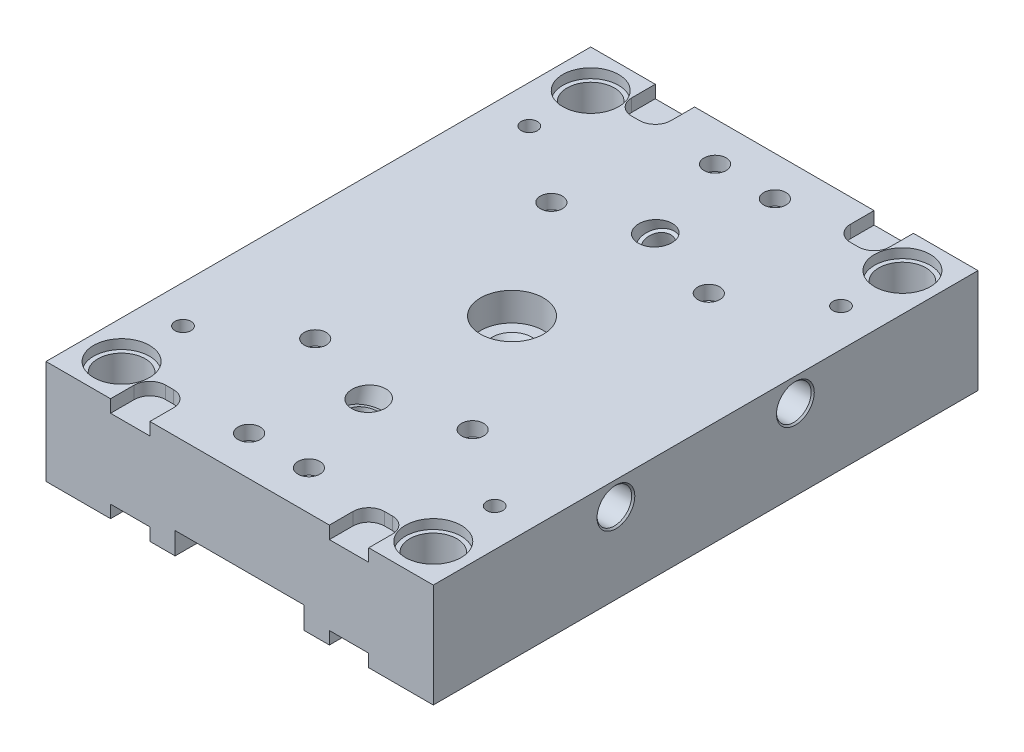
ISO-10303-21;
HEADER;
FILE_DESCRIPTION(('STEP AP214'),'2;1');
FILE_NAME('part.step','',(''),(''),'','','');
FILE_SCHEMA(('AUTOMOTIVE_DESIGN { 1 0 10303 214 1 1 1 1 }'));
ENDSEC;
DATA;
#1=APPLICATION_CONTEXT('core data for automotive mechanical design processes');
#2=APPLICATION_PROTOCOL_DEFINITION('international standard','automotive_design',2000,#1);
#3=PRODUCT_CONTEXT('',#1,'mechanical');
#4=PRODUCT('Part','Part','',(#3));
#5=PRODUCT_RELATED_PRODUCT_CATEGORY('part','',(#4));
#6=PRODUCT_DEFINITION_FORMATION('','',#4);
#7=PRODUCT_DEFINITION_CONTEXT('part definition',#1,'design');
#8=PRODUCT_DEFINITION('design','',#6,#7);
#9=PRODUCT_DEFINITION_SHAPE('','',#8);
#10=(LENGTH_UNIT() NAMED_UNIT(*) SI_UNIT(.MILLI.,.METRE.));
#11=(NAMED_UNIT(*) PLANE_ANGLE_UNIT() SI_UNIT($,.RADIAN.));
#12=(NAMED_UNIT(*) SI_UNIT($,.STERADIAN.) SOLID_ANGLE_UNIT());
#13=UNCERTAINTY_MEASURE_WITH_UNIT(LENGTH_MEASURE(1.E-05),#10,'distance_accuracy_value','');
#14=(GEOMETRIC_REPRESENTATION_CONTEXT(3) GLOBAL_UNCERTAINTY_ASSIGNED_CONTEXT((#13)) GLOBAL_UNIT_ASSIGNED_CONTEXT((#10,
#11,#12)) REPRESENTATION_CONTEXT('',''));
#15=CARTESIAN_POINT('',(0.,0.,0.));
#16=DIRECTION('',(0.,0.,1.));
#17=DIRECTION('',(1.,0.,0.));
#18=AXIS2_PLACEMENT_3D('',#15,#16,#17);
#19=CARTESIAN_POINT('',(101.,39.868,19.132));
#20=DIRECTION('',(-1.,0.,0.));
#21=DIRECTION('',(0.,1.,0.));
#22=AXIS2_PLACEMENT_3D('',#19,#20,#21);
#23=PLANE('',#22);
#24=CARTESIAN_POINT('',(101.,51.,8.));
#25=DIRECTION('',(1.,0.,0.));
#26=DIRECTION('',(0.,0.,-1.));
#27=AXIS2_PLACEMENT_3D('',#24,#25,#26);
#28=CIRCLE('',#27,11.);
#29=CARTESIAN_POINT('',(101.,51.,-3.));
#30=VERTEX_POINT('',#29);
#31=EDGE_CURVE('E502',#30,#30,#28,.F.);
#32=ORIENTED_EDGE('',*,*,#31,.F.);
#33=EDGE_LOOP('',(#32));
#34=FACE_BOUND('',#33,.T.);
#35=CARTESIAN_POINT('',(101.,51.0000000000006,7.99999999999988));
#36=DIRECTION('',(-1.,0.,0.));
#37=DIRECTION('',(0.,0.,1.));
#38=AXIS2_PLACEMENT_3D('',#35,#36,#37);
#39=CIRCLE('',#38,6.80984583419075);
#40=CARTESIAN_POINT('',(101.,51.0000000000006,14.8098458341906));
#41=VERTEX_POINT('',#40);
#42=EDGE_CURVE('E1523',#41,#41,#39,.T.);
#43=ORIENTED_EDGE('',*,*,#42,.T.);
#44=EDGE_LOOP('',(#43));
#45=FACE_BOUND('',#44,.T.);
#46=ADVANCED_FACE('F30',(#34,#45),#23,.F.);
#47=CARTESIAN_POINT('',(101.,39.868,133.132));
#48=DIRECTION('',(-1.,0.,0.));
#49=DIRECTION('',(0.,1.,0.));
#50=AXIS2_PLACEMENT_3D('',#47,#48,#49);
#51=PLANE('',#50);
#52=CARTESIAN_POINT('',(101.,51.,122.));
#53=DIRECTION('',(1.,0.,0.));
#54=DIRECTION('',(0.,0.,-1.));
#55=AXIS2_PLACEMENT_3D('',#52,#53,#54);
#56=CIRCLE('',#55,11.);
#57=CARTESIAN_POINT('',(101.,51.,111.));
#58=VERTEX_POINT('',#57);
#59=EDGE_CURVE('E677',#58,#58,#56,.F.);
#60=ORIENTED_EDGE('',*,*,#59,.F.);
#61=EDGE_LOOP('',(#60));
#62=FACE_BOUND('',#61,.T.);
#63=CARTESIAN_POINT('',(101.,51.0000000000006,122.));
#64=DIRECTION('',(-1.,0.,0.));
#65=DIRECTION('',(0.,0.,1.));
#66=AXIS2_PLACEMENT_3D('',#63,#64,#65);
#67=CIRCLE('',#66,6.80984583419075);
#68=CARTESIAN_POINT('',(101.,51.0000000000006,128.809845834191));
#69=VERTEX_POINT('',#68);
#70=EDGE_CURVE('E1514',#69,#69,#67,.T.);
#71=ORIENTED_EDGE('',*,*,#70,.T.);
#72=EDGE_LOOP('',(#71));
#73=FACE_BOUND('',#72,.T.);
#74=ADVANCED_FACE('F454',(#62,#73),#51,.F.);
#75=CARTESIAN_POINT('',(50.,57.309401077,8.));
#76=DIRECTION('',(0.,-1.,0.));
#77=DIRECTION('',(0.,0.,-1.));
#78=AXIS2_PLACEMENT_3D('',#75,#76,#77);
#79=CONICAL_SURFACE('',#78,0.,1.04719755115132);
#80=CARTESIAN_POINT('',(50.,57.309401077,8.));
#81=VERTEX_POINT('',#80);
#82=VERTEX_LOOP('',#81);
#83=FACE_BOUND('',#82,.T.);
#84=CARTESIAN_POINT('',(50.,55.,8.));
#85=DIRECTION('',(0.,-1.,0.));
#86=DIRECTION('',(-1.,0.,0.));
#87=AXIS2_PLACEMENT_3D('',#84,#85,#86);
#88=CIRCLE('',#87,4.);
#89=CARTESIAN_POINT('',(46.,55.,7.99999999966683));
#90=VERTEX_POINT('',#89);
#91=CARTESIAN_POINT('',(54.,55.,8.00000000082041));
#92=VERTEX_POINT('',#91);
#93=EDGE_CURVE('E458',#90,#92,#88,.F.);
#94=ORIENTED_EDGE('',*,*,#93,.F.);
#95=CARTESIAN_POINT('',(50.,55.,8.));
#96=DIRECTION('',(0.,-1.,0.));
#97=DIRECTION('',(-1.,0.,0.));
#98=AXIS2_PLACEMENT_3D('',#95,#96,#97);
#99=CIRCLE('',#98,4.);
#100=EDGE_CURVE('E437',#92,#90,#99,.F.);
#101=ORIENTED_EDGE('',*,*,#100,.F.);
#102=EDGE_LOOP('',(#94,#101));
#103=FACE_BOUND('',#102,.T.);
#104=ADVANCED_FACE('F451',(#83,#103),#79,.F.);
#105=CARTESIAN_POINT('',(50.,55.,8.));
#106=DIRECTION('',(0.,-1.,0.));
#107=DIRECTION('',(0.,0.,-1.));
#108=AXIS2_PLACEMENT_3D('',#105,#106,#107);
#109=CYLINDRICAL_SURFACE('',#108,4.);
#110=CARTESIAN_POINT('',(50.,51.,8.));
#111=DIRECTION('',(0.707106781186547,0.707106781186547,0.));
#112=DIRECTION('',(0.707106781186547,-0.707106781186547,0.));
#113=AXIS2_PLACEMENT_3D('',#110,#111,#112);
#114=ELLIPSE('',#113,5.65685424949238,4.);
#115=CARTESIAN_POINT('',(50.0000000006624,50.9999999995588,4.));
#116=VERTEX_POINT('',#115);
#117=EDGE_CURVE('E484',#116,#90,#114,.T.);
#118=ORIENTED_EDGE('',*,*,#117,.F.);
#119=CARTESIAN_POINT('',(50.,51.,8.));
#120=DIRECTION('',(0.707106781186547,-0.707106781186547,0.));
#121=DIRECTION('',(0.707106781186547,0.707106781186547,0.));
#122=AXIS2_PLACEMENT_3D('',#119,#120,#121);
#123=ELLIPSE('',#122,5.65685424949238,4.);
#124=EDGE_CURVE('E34',#92,#116,#123,.F.);
#125=ORIENTED_EDGE('',*,*,#124,.F.);
#126=ORIENTED_EDGE('',*,*,#100,.T.);
#127=EDGE_LOOP('',(#118,#125,#126));
#128=FACE_BOUND('',#127,.T.);
#129=ADVANCED_FACE('F453',(#128),#109,.F.);
#130=CARTESIAN_POINT('',(85.005514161,51.,8.));
#131=DIRECTION('',(1.,0.,0.));
#132=DIRECTION('',(0.,1.,0.));
#133=AXIS2_PLACEMENT_3D('',#130,#131,#132);
#134=CONICAL_SURFACE('',#133,4.,1.04719755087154);
#135=CARTESIAN_POINT('',(85.65647659,51.,7.99999999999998));
#136=DIRECTION('',(1.,0.,0.));
#137=DIRECTION('',(0.,0.,-1.));
#138=AXIS2_PLACEMENT_3D('',#135,#136,#137);
#139=CIRCLE('',#138,5.12750000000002);
#140=CARTESIAN_POINT('',(85.65647659,51.,2.87249999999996));
#141=VERTEX_POINT('',#140);
#142=EDGE_CURVE('E1520',#141,#141,#139,.T.);
#143=ORIENTED_EDGE('',*,*,#142,.T.);
#144=EDGE_LOOP('',(#143));
#145=FACE_BOUND('',#144,.T.);
#146=CARTESIAN_POINT('',(85.005514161,51.,8.));
#147=DIRECTION('',(1.,0.,0.));
#148=DIRECTION('',(0.,-1.,0.));
#149=AXIS2_PLACEMENT_3D('',#146,#147,#148);
#150=CIRCLE('',#149,4.);
#151=CARTESIAN_POINT('',(85.005514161,47.,8.));
#152=VERTEX_POINT('',#151);
#153=EDGE_CURVE('E479',#152,#152,#150,.T.);
#154=ORIENTED_EDGE('',*,*,#153,.F.);
#155=EDGE_LOOP('',(#154));
#156=FACE_BOUND('',#155,.T.);
#157=ADVANCED_FACE('F2241',(#145,#156),#134,.F.);
#158=CARTESIAN_POINT('',(50.,55.,8.));
#159=DIRECTION('',(0.,-1.,0.));
#160=DIRECTION('',(0.,0.,-1.));
#161=AXIS2_PLACEMENT_3D('',#158,#159,#160);
#162=CYLINDRICAL_SURFACE('',#161,4.);
#163=ORIENTED_EDGE('',*,*,#93,.T.);
#164=CARTESIAN_POINT('',(50.,51.,8.));
#165=DIRECTION('',(0.707106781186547,-0.707106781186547,0.));
#166=DIRECTION('',(0.707106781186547,0.707106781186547,0.));
#167=AXIS2_PLACEMENT_3D('',#164,#165,#166);
#168=ELLIPSE('',#167,5.65685424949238,4.);
#169=CARTESIAN_POINT('',(50.0000000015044,50.9999999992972,12.));
#170=VERTEX_POINT('',#169);
#171=EDGE_CURVE('E477',#170,#92,#168,.F.);
#172=ORIENTED_EDGE('',*,*,#171,.F.);
#173=CARTESIAN_POINT('',(50.,51.,8.));
#174=DIRECTION('',(0.707106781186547,0.707106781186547,0.));
#175=DIRECTION('',(0.707106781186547,-0.707106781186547,0.));
#176=AXIS2_PLACEMENT_3D('',#173,#174,#175);
#177=ELLIPSE('',#176,5.65685424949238,4.);
#178=EDGE_CURVE('E469',#90,#170,#177,.T.);
#179=ORIENTED_EDGE('',*,*,#178,.F.);
#180=EDGE_LOOP('',(#163,#172,#179));
#181=FACE_BOUND('',#180,.T.);
#182=ADVANCED_FACE('F476',(#181),#162,.F.);
#183=CARTESIAN_POINT('',(43.690598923,51.,8.));
#184=DIRECTION('',(1.,0.,0.));
#185=DIRECTION('',(0.,0.,-1.));
#186=AXIS2_PLACEMENT_3D('',#183,#184,#185);
#187=CONICAL_SURFACE('',#186,0.,1.04719755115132);
#188=CARTESIAN_POINT('',(43.690598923,51.,8.));
#189=VERTEX_POINT('',#188);
#190=VERTEX_LOOP('',#189);
#191=FACE_BOUND('',#190,.T.);
#192=CARTESIAN_POINT('',(46.,51.,8.));
#193=DIRECTION('',(1.,0.,0.));
#194=DIRECTION('',(0.,-1.,0.));
#195=AXIS2_PLACEMENT_3D('',#192,#193,#194);
#196=CIRCLE('',#195,4.);
#197=CARTESIAN_POINT('',(46.,47.,8.00000000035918));
#198=VERTEX_POINT('',#197);
#199=EDGE_CURVE('E491',#90,#198,#196,.F.);
#200=ORIENTED_EDGE('',*,*,#199,.F.);
#201=CARTESIAN_POINT('',(46.,51.,8.));
#202=DIRECTION('',(1.,0.,0.));
#203=DIRECTION('',(0.,-1.,0.));
#204=AXIS2_PLACEMENT_3D('',#201,#202,#203);
#205=CIRCLE('',#204,4.);
#206=EDGE_CURVE('E467',#198,#90,#205,.F.);
#207=ORIENTED_EDGE('',*,*,#206,.F.);
#208=EDGE_LOOP('',(#200,#207));
#209=FACE_BOUND('',#208,.T.);
#210=ADVANCED_FACE('F2236',(#191,#209),#187,.F.);
#211=CARTESIAN_POINT('',(46.,51.,8.));
#212=DIRECTION('',(1.,0.,0.));
#213=DIRECTION('',(0.,0.,-1.));
#214=AXIS2_PLACEMENT_3D('',#211,#212,#213);
#215=CYLINDRICAL_SURFACE('',#214,4.);
#216=CARTESIAN_POINT('',(50.,51.,8.));
#217=DIRECTION('',(0.707106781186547,-0.707106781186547,0.));
#218=DIRECTION('',(-0.707106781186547,-0.707106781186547,0.));
#219=AXIS2_PLACEMENT_3D('',#216,#217,#218);
#220=ELLIPSE('',#219,5.65685424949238,4.);
#221=EDGE_CURVE('E493',#116,#198,#220,.F.);
#222=ORIENTED_EDGE('',*,*,#221,.F.);
#223=ORIENTED_EDGE('',*,*,#117,.T.);
#224=ORIENTED_EDGE('',*,*,#199,.T.);
#225=EDGE_LOOP('',(#222,#223,#224));
#226=FACE_BOUND('',#225,.T.);
#227=ADVANCED_FACE('F490',(#226),#215,.F.);
#228=CARTESIAN_POINT('',(49.789966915,51.,8.));
#229=DIRECTION('',(1.,0.,0.));
#230=DIRECTION('',(0.,0.,-1.));
#231=AXIS2_PLACEMENT_3D('',#228,#229,#230);
#232=CYLINDRICAL_SURFACE('',#231,4.);
#233=ORIENTED_EDGE('',*,*,#153,.T.);
#234=EDGE_LOOP('',(#233));
#235=FACE_BOUND('',#234,.T.);
#236=ORIENTED_EDGE('',*,*,#171,.T.);
#237=ORIENTED_EDGE('',*,*,#124,.T.);
#238=CARTESIAN_POINT('',(50.,51.,8.));
#239=DIRECTION('',(-0.707106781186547,-0.707106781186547,0.));
#240=DIRECTION('',(0.707106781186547,-0.707106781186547,0.));
#241=AXIS2_PLACEMENT_3D('',#238,#239,#240);
#242=ELLIPSE('',#241,5.65685424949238,4.);
#243=EDGE_CURVE('E512',#170,#116,#242,.F.);
#244=ORIENTED_EDGE('',*,*,#243,.F.);
#245=EDGE_LOOP('',(#236,#237,#244));
#246=FACE_BOUND('',#245,.T.);
#247=ADVANCED_FACE('F2230',(#235,#246),#232,.F.);
#248=CARTESIAN_POINT('',(46.,51.,8.));
#249=DIRECTION('',(1.,0.,0.));
#250=DIRECTION('',(0.,0.,-1.));
#251=AXIS2_PLACEMENT_3D('',#248,#249,#250);
#252=CYLINDRICAL_SURFACE('',#251,4.);
#253=CARTESIAN_POINT('',(50.,51.,8.));
#254=DIRECTION('',(0.707106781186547,-0.707106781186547,0.));
#255=DIRECTION('',(-0.707106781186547,-0.707106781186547,0.));
#256=AXIS2_PLACEMENT_3D('',#253,#254,#255);
#257=ELLIPSE('',#256,5.65685424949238,4.);
#258=EDGE_CURVE('E471',#198,#170,#257,.F.);
#259=ORIENTED_EDGE('',*,*,#258,.F.);
#260=ORIENTED_EDGE('',*,*,#206,.T.);
#261=ORIENTED_EDGE('',*,*,#178,.T.);
#262=EDGE_LOOP('',(#259,#260,#261));
#263=FACE_BOUND('',#262,.T.);
#264=ADVANCED_FACE('F468',(#263),#252,.F.);
#265=CARTESIAN_POINT('',(11.916,57.,-90.084));
#266=DIRECTION('',(0.,-1.,0.));
#267=DIRECTION('',(1.,0.,0.));
#268=AXIS2_PLACEMENT_3D('',#265,#266,#267);
#269=PLANE('',#268);
#270=CARTESIAN_POINT('',(19.,57.,-83.));
#271=DIRECTION('',(0.,1.,0.));
#272=DIRECTION('',(0.,0.,1.));
#273=AXIS2_PLACEMENT_3D('',#270,#271,#272);
#274=CIRCLE('',#273,4.5);
#275=CARTESIAN_POINT('',(19.,57.,-78.5));
#276=VERTEX_POINT('',#275);
#277=EDGE_CURVE('E505',#276,#276,#274,.T.);
#278=ORIENTED_EDGE('',*,*,#277,.F.);
#279=EDGE_LOOP('',(#278));
#280=FACE_BOUND('',#279,.T.);
#281=CARTESIAN_POINT('',(19.,57.,-83.));
#282=DIRECTION('',(0.,1.,0.));
#283=DIRECTION('',(0.,0.,1.));
#284=AXIS2_PLACEMENT_3D('',#281,#282,#283);
#285=CIRCLE('',#284,7.);
#286=CARTESIAN_POINT('',(19.,57.,-76.));
#287=VERTEX_POINT('',#286);
#288=EDGE_CURVE('E517',#287,#287,#285,.F.);
#289=ORIENTED_EDGE('',*,*,#288,.F.);
#290=EDGE_LOOP('',(#289));
#291=FACE_BOUND('',#290,.T.);
#292=ADVANCED_FACE('F1556',(#280,#291),#269,.F.);
#293=CARTESIAN_POINT('',(-26.084,57.,-90.084));
#294=DIRECTION('',(0.,-1.,0.));
#295=DIRECTION('',(1.,0.,0.));
#296=AXIS2_PLACEMENT_3D('',#293,#294,#295);
#297=PLANE('',#296);
#298=CARTESIAN_POINT('',(-19.,57.,-83.));
#299=DIRECTION('',(0.,1.,0.));
#300=DIRECTION('',(0.,0.,1.));
#301=AXIS2_PLACEMENT_3D('',#298,#299,#300);
#302=CIRCLE('',#301,4.5);
#303=CARTESIAN_POINT('',(-19.,57.,-78.5));
#304=VERTEX_POINT('',#303);
#305=EDGE_CURVE('E508',#304,#304,#302,.T.);
#306=ORIENTED_EDGE('',*,*,#305,.F.);
#307=EDGE_LOOP('',(#306));
#308=FACE_BOUND('',#307,.T.);
#309=CARTESIAN_POINT('',(-19.,57.,-83.));
#310=DIRECTION('',(0.,1.,0.));
#311=DIRECTION('',(0.,0.,1.));
#312=AXIS2_PLACEMENT_3D('',#309,#310,#311);
#313=CIRCLE('',#312,7.);
#314=CARTESIAN_POINT('',(-19.,57.,-76.));
#315=VERTEX_POINT('',#314);
#316=EDGE_CURVE('E520',#315,#315,#313,.F.);
#317=ORIENTED_EDGE('',*,*,#316,.F.);
#318=EDGE_LOOP('',(#317));
#319=FACE_BOUND('',#318,.T.);
#320=ADVANCED_FACE('F1559',(#308,#319),#297,.F.);
#321=CARTESIAN_POINT('',(-99.,31.04107987,-45.));
#322=DIRECTION('',(0.,1.,0.));
#323=DIRECTION('',(0.,0.,1.));
#324=AXIS2_PLACEMENT_3D('',#321,#322,#323);
#325=CONICAL_SURFACE('',#324,0.,1.0471975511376);
#326=CARTESIAN_POINT('',(-99.,31.04107987,-45.));
#327=VERTEX_POINT('',#326);
#328=VERTEX_LOOP('',#327);
#329=FACE_BOUND('',#328,.T.);
#330=CARTESIAN_POINT('',(-99.,34.,-45.));
#331=DIRECTION('',(0.,1.,0.));
#332=DIRECTION('',(1.,0.,0.));
#333=AXIS2_PLACEMENT_3D('',#330,#331,#332);
#334=CIRCLE('',#333,5.12500000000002);
#335=CARTESIAN_POINT('',(-93.875,34.,-45.));
#336=VERTEX_POINT('',#335);
#337=EDGE_CURVE('E524',#336,#336,#334,.F.);
#338=ORIENTED_EDGE('',*,*,#337,.F.);
#339=EDGE_LOOP('',(#338));
#340=FACE_BOUND('',#339,.T.);
#341=ADVANCED_FACE('F1563',(#329,#340),#325,.F.);
#342=CARTESIAN_POINT('',(99.,31.04107987,-45.));
#343=DIRECTION('',(0.,1.,0.));
#344=DIRECTION('',(0.,0.,1.));
#345=AXIS2_PLACEMENT_3D('',#342,#343,#344);
#346=CONICAL_SURFACE('',#345,0.,1.0471975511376);
#347=CARTESIAN_POINT('',(99.,31.04107987,-45.));
#348=VERTEX_POINT('',#347);
#349=VERTEX_LOOP('',#348);
#350=FACE_BOUND('',#349,.T.);
#351=CARTESIAN_POINT('',(99.,34.,-45.));
#352=DIRECTION('',(0.,1.,0.));
#353=DIRECTION('',(1.,0.,0.));
#354=AXIS2_PLACEMENT_3D('',#351,#352,#353);
#355=CIRCLE('',#354,5.12499999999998);
#356=CARTESIAN_POINT('',(104.125,34.,-45.));
#357=VERTEX_POINT('',#356);
#358=EDGE_CURVE('E1026',#357,#357,#355,.F.);
#359=ORIENTED_EDGE('',*,*,#358,.F.);
#360=EDGE_LOOP('',(#359));
#361=FACE_BOUND('',#360,.T.);
#362=ADVANCED_FACE('F2221',(#350,#361),#346,.F.);
#363=CARTESIAN_POINT('',(-99.,31.04107987,175.));
#364=DIRECTION('',(0.,1.,0.));
#365=DIRECTION('',(0.,0.,1.));
#366=AXIS2_PLACEMENT_3D('',#363,#364,#365);
#367=CONICAL_SURFACE('',#366,0.,1.0471975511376);
#368=CARTESIAN_POINT('',(-99.,31.04107987,175.));
#369=VERTEX_POINT('',#368);
#370=VERTEX_LOOP('',#369);
#371=FACE_BOUND('',#370,.T.);
#372=CARTESIAN_POINT('',(-99.,34.,175.));
#373=DIRECTION('',(0.,1.,0.));
#374=DIRECTION('',(1.,0.,0.));
#375=AXIS2_PLACEMENT_3D('',#372,#373,#374);
#376=CIRCLE('',#375,5.12500000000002);
#377=CARTESIAN_POINT('',(-93.875,34.,175.));
#378=VERTEX_POINT('',#377);
#379=EDGE_CURVE('E1029',#378,#378,#376,.F.);
#380=ORIENTED_EDGE('',*,*,#379,.F.);
#381=EDGE_LOOP('',(#380));
#382=FACE_BOUND('',#381,.T.);
#383=ADVANCED_FACE('F2217',(#371,#382),#367,.F.);
#384=CARTESIAN_POINT('',(99.,31.04107987,175.));
#385=DIRECTION('',(0.,1.,0.));
#386=DIRECTION('',(0.,0.,1.));
#387=AXIS2_PLACEMENT_3D('',#384,#385,#386);
#388=CONICAL_SURFACE('',#387,0.,1.0471975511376);
#389=CARTESIAN_POINT('',(99.,31.04107987,175.));
#390=VERTEX_POINT('',#389);
#391=VERTEX_LOOP('',#390);
#392=FACE_BOUND('',#391,.T.);
#393=CARTESIAN_POINT('',(99.,34.,175.));
#394=DIRECTION('',(0.,1.,0.));
#395=DIRECTION('',(1.,0.,0.));
#396=AXIS2_PLACEMENT_3D('',#393,#394,#395);
#397=CIRCLE('',#396,5.12499999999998);
#398=CARTESIAN_POINT('',(104.125,34.,175.));
#399=VERTEX_POINT('',#398);
#400=EDGE_CURVE('E529',#399,#399,#397,.F.);
#401=ORIENTED_EDGE('',*,*,#400,.F.);
#402=EDGE_LOOP('',(#401));
#403=FACE_BOUND('',#402,.T.);
#404=ADVANCED_FACE('F1569',(#392,#403),#388,.F.);
#405=CARTESIAN_POINT('',(26.084,57.,220.084));
#406=DIRECTION('',(0.,-1.,0.));
#407=DIRECTION('',(-1.,0.,0.));
#408=AXIS2_PLACEMENT_3D('',#405,#406,#407);
#409=PLANE('',#408);
#410=CARTESIAN_POINT('',(19.,57.,213.));
#411=DIRECTION('',(0.,1.,0.));
#412=DIRECTION('',(0.,0.,1.));
#413=AXIS2_PLACEMENT_3D('',#410,#411,#412);
#414=CIRCLE('',#413,4.5);
#415=CARTESIAN_POINT('',(19.,57.,217.5));
#416=VERTEX_POINT('',#415);
#417=EDGE_CURVE('E499',#416,#416,#414,.T.);
#418=ORIENTED_EDGE('',*,*,#417,.F.);
#419=EDGE_LOOP('',(#418));
#420=FACE_BOUND('',#419,.T.);
#421=CARTESIAN_POINT('',(19.,57.,213.));
#422=DIRECTION('',(0.,1.,0.));
#423=DIRECTION('',(0.,0.,1.));
#424=AXIS2_PLACEMENT_3D('',#421,#422,#423);
#425=CIRCLE('',#424,7.);
#426=CARTESIAN_POINT('',(19.,57.,220.));
#427=VERTEX_POINT('',#426);
#428=EDGE_CURVE('E525',#427,#427,#425,.F.);
#429=ORIENTED_EDGE('',*,*,#428,.F.);
#430=EDGE_LOOP('',(#429));
#431=FACE_BOUND('',#430,.T.);
#432=ADVANCED_FACE('F1565',(#420,#431),#409,.F.);
#433=CARTESIAN_POINT('',(-11.916,57.,220.084));
#434=DIRECTION('',(0.,-1.,0.));
#435=DIRECTION('',(-1.,0.,0.));
#436=AXIS2_PLACEMENT_3D('',#433,#434,#435);
#437=PLANE('',#436);
#438=CARTESIAN_POINT('',(-19.,57.,213.));
#439=DIRECTION('',(0.,1.,0.));
#440=DIRECTION('',(0.,0.,1.));
#441=AXIS2_PLACEMENT_3D('',#438,#439,#440);
#442=CIRCLE('',#441,4.5);
#443=CARTESIAN_POINT('',(-19.,57.,217.5));
#444=VERTEX_POINT('',#443);
#445=EDGE_CURVE('E474',#444,#444,#442,.T.);
#446=ORIENTED_EDGE('',*,*,#445,.F.);
#447=EDGE_LOOP('',(#446));
#448=FACE_BOUND('',#447,.T.);
#449=CARTESIAN_POINT('',(-19.,57.,213.));
#450=DIRECTION('',(0.,1.,0.));
#451=DIRECTION('',(0.,0.,1.));
#452=AXIS2_PLACEMENT_3D('',#449,#450,#451);
#453=CIRCLE('',#452,7.);
#454=CARTESIAN_POINT('',(-19.,57.,220.));
#455=VERTEX_POINT('',#454);
#456=EDGE_CURVE('E528',#455,#455,#453,.F.);
#457=ORIENTED_EDGE('',*,*,#456,.F.);
#458=EDGE_LOOP('',(#457));
#459=FACE_BOUND('',#458,.T.);
#460=ADVANCED_FACE('F1568',(#448,#459),#437,.F.);
#461=CARTESIAN_POINT('',(-19.,26.,213.));
#462=DIRECTION('',(0.,1.,0.));
#463=DIRECTION('',(0.,0.,1.));
#464=AXIS2_PLACEMENT_3D('',#461,#462,#463);
#465=CYLINDRICAL_SURFACE('',#464,4.5);
#466=CARTESIAN_POINT('',(-19.,26.,213.));
#467=DIRECTION('',(0.,1.,0.));
#468=DIRECTION('',(0.,0.,1.));
#469=AXIS2_PLACEMENT_3D('',#466,#467,#468);
#470=CIRCLE('',#469,4.5);
#471=CARTESIAN_POINT('',(-19.,26.,217.5));
#472=VERTEX_POINT('',#471);
#473=EDGE_CURVE('E535',#472,#472,#470,.F.);
#474=ORIENTED_EDGE('',*,*,#473,.T.);
#475=EDGE_LOOP('',(#474));
#476=FACE_BOUND('',#475,.T.);
#477=ORIENTED_EDGE('',*,*,#445,.T.);
#478=EDGE_LOOP('',(#477));
#479=FACE_BOUND('',#478,.T.);
#480=ADVANCED_FACE('F1573',(#476,#479),#465,.F.);
#481=CARTESIAN_POINT('',(19.,26.,213.));
#482=DIRECTION('',(0.,1.,0.));
#483=DIRECTION('',(0.,0.,1.));
#484=AXIS2_PLACEMENT_3D('',#481,#482,#483);
#485=CYLINDRICAL_SURFACE('',#484,4.5);
#486=CARTESIAN_POINT('',(19.,26.,213.));
#487=DIRECTION('',(0.,1.,0.));
#488=DIRECTION('',(0.,0.,1.));
#489=AXIS2_PLACEMENT_3D('',#486,#487,#488);
#490=CIRCLE('',#489,4.5);
#491=CARTESIAN_POINT('',(19.,26.,217.5));
#492=VERTEX_POINT('',#491);
#493=EDGE_CURVE('E538',#492,#492,#490,.F.);
#494=ORIENTED_EDGE('',*,*,#493,.T.);
#495=EDGE_LOOP('',(#494));
#496=FACE_BOUND('',#495,.T.);
#497=ORIENTED_EDGE('',*,*,#417,.T.);
#498=EDGE_LOOP('',(#497));
#499=FACE_BOUND('',#498,.T.);
#500=ADVANCED_FACE('F2207',(#496,#499),#485,.F.);
#501=CARTESIAN_POINT('',(101.,51.,8.));
#502=DIRECTION('',(1.,0.,0.));
#503=DIRECTION('',(0.,0.,-1.));
#504=AXIS2_PLACEMENT_3D('',#501,#502,#503);
#505=CYLINDRICAL_SURFACE('',#504,11.);
#506=CARTESIAN_POINT('',(122.,51.,8.));
#507=DIRECTION('',(1.,0.,0.));
#508=DIRECTION('',(0.,1.,0.));
#509=AXIS2_PLACEMENT_3D('',#506,#507,#508);
#510=CIRCLE('',#509,11.);
#511=CARTESIAN_POINT('',(122.,62.,8.));
#512=VERTEX_POINT('',#511);
#513=EDGE_CURVE('E541',#512,#512,#510,.F.);
#514=ORIENTED_EDGE('',*,*,#513,.F.);
#515=EDGE_LOOP('',(#514));
#516=FACE_BOUND('',#515,.T.);
#517=ORIENTED_EDGE('',*,*,#31,.T.);
#518=EDGE_LOOP('',(#517));
#519=FACE_BOUND('',#518,.T.);
#520=ADVANCED_FACE('F2203',(#516,#519),#505,.F.);
#521=CARTESIAN_POINT('',(19.,26.,-83.));
#522=DIRECTION('',(0.,1.,0.));
#523=DIRECTION('',(0.,0.,1.));
#524=AXIS2_PLACEMENT_3D('',#521,#522,#523);
#525=CYLINDRICAL_SURFACE('',#524,4.5);
#526=CARTESIAN_POINT('',(19.,26.,-83.));
#527=DIRECTION('',(0.,1.,0.));
#528=DIRECTION('',(0.,0.,1.));
#529=AXIS2_PLACEMENT_3D('',#526,#527,#528);
#530=CIRCLE('',#529,4.5);
#531=CARTESIAN_POINT('',(19.,26.,-78.5));
#532=VERTEX_POINT('',#531);
#533=EDGE_CURVE('E552',#532,#532,#530,.F.);
#534=ORIENTED_EDGE('',*,*,#533,.T.);
#535=EDGE_LOOP('',(#534));
#536=FACE_BOUND('',#535,.T.);
#537=ORIENTED_EDGE('',*,*,#277,.T.);
#538=EDGE_LOOP('',(#537));
#539=FACE_BOUND('',#538,.T.);
#540=ADVANCED_FACE('F2199',(#536,#539),#525,.F.);
#541=CARTESIAN_POINT('',(-19.,26.,-83.));
#542=DIRECTION('',(0.,1.,0.));
#543=DIRECTION('',(0.,0.,1.));
#544=AXIS2_PLACEMENT_3D('',#541,#542,#543);
#545=CYLINDRICAL_SURFACE('',#544,4.5);
#546=CARTESIAN_POINT('',(-19.,26.,-83.));
#547=DIRECTION('',(0.,1.,0.));
#548=DIRECTION('',(0.,0.,1.));
#549=AXIS2_PLACEMENT_3D('',#546,#547,#548);
#550=CIRCLE('',#549,4.5);
#551=CARTESIAN_POINT('',(-19.,26.,-78.5));
#552=VERTEX_POINT('',#551);
#553=EDGE_CURVE('E555',#552,#552,#550,.F.);
#554=ORIENTED_EDGE('',*,*,#553,.T.);
#555=EDGE_LOOP('',(#554));
#556=FACE_BOUND('',#555,.T.);
#557=ORIENTED_EDGE('',*,*,#305,.T.);
#558=EDGE_LOOP('',(#557));
#559=FACE_BOUND('',#558,.T.);
#560=ADVANCED_FACE('F2195',(#556,#559),#545,.F.);
#561=CARTESIAN_POINT('',(-91.,46.,65.));
#562=DIRECTION('',(-1.,0.,0.));
#563=DIRECTION('',(0.,0.,1.));
#564=AXIS2_PLACEMENT_3D('',#561,#562,#563);
#565=CONICAL_SURFACE('',#564,0.,1.0471975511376);
#566=CARTESIAN_POINT('',(-91.,46.,65.));
#567=VERTEX_POINT('',#566);
#568=VERTEX_LOOP('',#567);
#569=FACE_BOUND('',#568,.T.);
#570=CARTESIAN_POINT('',(-93.95892013,46.,65.));
#571=DIRECTION('',(1.,0.,0.));
#572=DIRECTION('',(0.,0.,-1.));
#573=AXIS2_PLACEMENT_3D('',#570,#571,#572);
#574=CIRCLE('',#573,5.125);
#575=CARTESIAN_POINT('',(-93.95892013,46.,59.875));
#576=VERTEX_POINT('',#575);
#577=EDGE_CURVE('E1038',#576,#576,#574,.T.);
#578=ORIENTED_EDGE('',*,*,#577,.F.);
#579=EDGE_LOOP('',(#578));
#580=FACE_BOUND('',#579,.T.);
#581=ADVANCED_FACE('F2191',(#569,#580),#565,.F.);
#582=CARTESIAN_POINT('',(50.,51.09,8.));
#583=DIRECTION('',(0.,-1.,0.));
#584=DIRECTION('',(0.,0.,-1.));
#585=AXIS2_PLACEMENT_3D('',#582,#583,#584);
#586=CYLINDRICAL_SURFACE('',#585,4.);
#587=CARTESIAN_POINT('',(50.,36.,8.00000000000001));
#588=DIRECTION('',(0.,-1.,0.));
#589=DIRECTION('',(0.,0.,-1.));
#590=AXIS2_PLACEMENT_3D('',#587,#588,#589);
#591=CIRCLE('',#590,4.);
#592=CARTESIAN_POINT('',(50.,36.,4.00000000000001));
#593=VERTEX_POINT('',#592);
#594=EDGE_CURVE('E593',#593,#593,#591,.T.);
#595=ORIENTED_EDGE('',*,*,#594,.T.);
#596=EDGE_LOOP('',(#595));
#597=FACE_BOUND('',#596,.T.);
#598=ORIENTED_EDGE('',*,*,#243,.T.);
#599=ORIENTED_EDGE('',*,*,#221,.T.);
#600=ORIENTED_EDGE('',*,*,#258,.T.);
#601=EDGE_LOOP('',(#598,#599,#600));
#602=FACE_BOUND('',#601,.T.);
#603=ADVANCED_FACE('F2187',(#597,#602),#586,.F.);
#604=CARTESIAN_POINT('',(67.,58.,223.));
#605=DIRECTION('',(0.,1.,0.));
#606=DIRECTION('',(0.,0.,1.));
#607=AXIS2_PLACEMENT_3D('',#604,#605,#606);
#608=CYLINDRICAL_SURFACE('',#607,9.99999999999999);
#609=CARTESIAN_POINT('',(67.,58.,223.));
#610=DIRECTION('',(0.,1.,0.));
#611=DIRECTION('',(0.,0.,1.));
#612=AXIS2_PLACEMENT_3D('',#609,#610,#611);
#613=CIRCLE('',#612,9.99999999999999);
#614=CARTESIAN_POINT('',(57.,58.,223.));
#615=VERTEX_POINT('',#614);
#616=CARTESIAN_POINT('',(67.,58.,213.));
#617=VERTEX_POINT('',#616);
#618=EDGE_CURVE('E562',#615,#617,#613,.F.);
#619=ORIENTED_EDGE('',*,*,#618,.T.);
#620=DIRECTION('',(0.,-1.,0.));
#621=VECTOR('',#620,1.);
#622=CARTESIAN_POINT('',(67.,62.,213.));
#623=LINE('',#622,#621);
#624=CARTESIAN_POINT('',(67.,66.,213.000000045));
#625=VERTEX_POINT('',#624);
#626=EDGE_CURVE('E516',#625,#617,#623,.T.);
#627=ORIENTED_EDGE('',*,*,#626,.F.);
#628=CARTESIAN_POINT('',(67.,66.,223.));
#629=DIRECTION('',(0.,1.,0.));
#630=DIRECTION('',(0.,0.,1.));
#631=AXIS2_PLACEMENT_3D('',#628,#629,#630);
#632=CIRCLE('',#631,9.99999999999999);
#633=CARTESIAN_POINT('',(56.999999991,66.,223.));
#634=VERTEX_POINT('',#633);
#635=EDGE_CURVE('E597',#634,#625,#632,.F.);
#636=ORIENTED_EDGE('',*,*,#635,.F.);
#637=DIRECTION('',(0.,-1.,0.));
#638=VECTOR('',#637,1.);
#639=CARTESIAN_POINT('',(57.,62.,223.));
#640=LINE('',#639,#638);
#641=EDGE_CURVE('E1044',#634,#615,#640,.T.);
#642=ORIENTED_EDGE('',*,*,#641,.T.);
#643=EDGE_LOOP('',(#619,#627,#636,#642));
#644=FACE_BOUND('',#643,.T.);
#645=ADVANCED_FACE('F1579',(#644),#608,.F.);
#646=CARTESIAN_POINT('',(72.,66.,213.));
#647=DIRECTION('',(0.,0.,1.));
#648=DIRECTION('',(-1.,0.,0.));
#649=AXIS2_PLACEMENT_3D('',#646,#647,#648);
#650=PLANE('',#649);
#651=DIRECTION('',(1.,0.,0.));
#652=VECTOR('',#651,1.);
#653=CARTESIAN_POINT('',(69.5,58.,213.));
#654=LINE('',#653,#652);
#655=CARTESIAN_POINT('',(72.0000000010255,58.,213.));
#656=VERTEX_POINT('',#655);
#657=EDGE_CURVE('E564',#617,#656,#654,.T.);
#658=ORIENTED_EDGE('',*,*,#657,.T.);
#659=DIRECTION('',(0.,1.,0.));
#660=VECTOR('',#659,1.);
#661=CARTESIAN_POINT('',(72.000000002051,62.,213.));
#662=LINE('',#661,#660);
#663=CARTESIAN_POINT('',(72.0000000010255,66.,213.000000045));
#664=VERTEX_POINT('',#663);
#665=EDGE_CURVE('E1048',#664,#656,#662,.F.);
#666=ORIENTED_EDGE('',*,*,#665,.F.);
#667=DIRECTION('',(1.,0.,0.));
#668=VECTOR('',#667,1.);
#669=CARTESIAN_POINT('',(0.,66.,213.00000009));
#670=LINE('',#669,#668);
#671=EDGE_CURVE('E600',#625,#664,#670,.T.);
#672=ORIENTED_EDGE('',*,*,#671,.F.);
#673=ORIENTED_EDGE('',*,*,#626,.T.);
#674=EDGE_LOOP('',(#658,#666,#672,#673));
#675=FACE_BOUND('',#674,.T.);
#676=ADVANCED_FACE('F1575',(#675),#650,.T.);
#677=CARTESIAN_POINT('',(72.,66.,223.));
#678=DIRECTION('',(0.,-1.,0.));
#679=DIRECTION('',(0.,0.,-1.));
#680=AXIS2_PLACEMENT_3D('',#677,#678,#679);
#681=CYLINDRICAL_SURFACE('',#680,10.);
#682=CARTESIAN_POINT('',(72.,66.,223.));
#683=DIRECTION('',(0.,-1.,0.));
#684=DIRECTION('',(0.,0.,-1.));
#685=AXIS2_PLACEMENT_3D('',#682,#683,#684);
#686=CIRCLE('',#685,10.);
#687=CARTESIAN_POINT('',(81.999999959,66.,223.));
#688=VERTEX_POINT('',#687);
#689=EDGE_CURVE('E602',#664,#688,#686,.T.);
#690=ORIENTED_EDGE('',*,*,#689,.F.);
#691=ORIENTED_EDGE('',*,*,#665,.T.);
#692=CARTESIAN_POINT('',(72.,58.,223.));
#693=DIRECTION('',(0.,-1.,0.));
#694=DIRECTION('',(0.,0.,-1.));
#695=AXIS2_PLACEMENT_3D('',#692,#693,#694);
#696=CIRCLE('',#695,10.);
#697=CARTESIAN_POINT('',(82.,58.,223.));
#698=VERTEX_POINT('',#697);
#699=EDGE_CURVE('E559',#656,#698,#696,.T.);
#700=ORIENTED_EDGE('',*,*,#699,.T.);
#701=DIRECTION('',(0.,1.,0.));
#702=VECTOR('',#701,1.);
#703=CARTESIAN_POINT('',(82.,62.,223.));
#704=LINE('',#703,#702);
#705=EDGE_CURVE('E558',#698,#688,#704,.T.);
#706=ORIENTED_EDGE('',*,*,#705,.T.);
#707=EDGE_LOOP('',(#690,#691,#700,#706));
#708=FACE_BOUND('',#707,.T.);
#709=ADVANCED_FACE('F1578',(#708),#681,.F.);
#710=CARTESIAN_POINT('',(72.,66.,-93.));
#711=DIRECTION('',(0.,-1.,0.));
#712=DIRECTION('',(0.,0.,-1.));
#713=AXIS2_PLACEMENT_3D('',#710,#711,#712);
#714=CYLINDRICAL_SURFACE('',#713,10.);
#715=CARTESIAN_POINT('',(72.,66.,-93.));
#716=DIRECTION('',(0.,-1.,0.));
#717=DIRECTION('',(0.,0.,-1.));
#718=AXIS2_PLACEMENT_3D('',#715,#716,#717);
#719=CIRCLE('',#718,10.);
#720=CARTESIAN_POINT('',(81.999999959,66.,-93.));
#721=VERTEX_POINT('',#720);
#722=CARTESIAN_POINT('',(72.,66.,-83.000000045));
#723=VERTEX_POINT('',#722);
#724=EDGE_CURVE('E606',#721,#723,#719,.T.);
#725=ORIENTED_EDGE('',*,*,#724,.F.);
#726=DIRECTION('',(0.,-1.,0.));
#727=VECTOR('',#726,1.);
#728=CARTESIAN_POINT('',(82.,62.,-93.));
#729=LINE('',#728,#727);
#730=CARTESIAN_POINT('',(82.,58.,-93.));
#731=VERTEX_POINT('',#730);
#732=EDGE_CURVE('E1052',#721,#731,#729,.T.);
#733=ORIENTED_EDGE('',*,*,#732,.T.);
#734=CARTESIAN_POINT('',(72.,58.,-93.));
#735=DIRECTION('',(0.,-1.,0.));
#736=DIRECTION('',(0.,0.,-1.));
#737=AXIS2_PLACEMENT_3D('',#734,#735,#736);
#738=CIRCLE('',#737,10.);
#739=CARTESIAN_POINT('',(72.,58.,-83.));
#740=VERTEX_POINT('',#739);
#741=EDGE_CURVE('E583',#731,#740,#738,.T.);
#742=ORIENTED_EDGE('',*,*,#741,.T.);
#743=DIRECTION('',(0.,-1.,0.));
#744=VECTOR('',#743,1.);
#745=CARTESIAN_POINT('',(72.,62.,-83.));
#746=LINE('',#745,#744);
#747=EDGE_CURVE('E1050',#723,#740,#746,.T.);
#748=ORIENTED_EDGE('',*,*,#747,.F.);
#749=EDGE_LOOP('',(#725,#733,#742,#748));
#750=FACE_BOUND('',#749,.T.);
#751=ADVANCED_FACE('F1585',(#750),#714,.F.);
#752=CARTESIAN_POINT('',(72.,58.,-83.));
#753=DIRECTION('',(0.,0.,-1.));
#754=DIRECTION('',(-1.,0.,0.));
#755=AXIS2_PLACEMENT_3D('',#752,#753,#754);
#756=PLANE('',#755);
#757=DIRECTION('',(-1.,0.,0.));
#758=VECTOR('',#757,1.);
#759=CARTESIAN_POINT('',(69.5,58.,-83.));
#760=LINE('',#759,#758);
#761=CARTESIAN_POINT('',(66.9999999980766,58.,-83.));
#762=VERTEX_POINT('',#761);
#763=EDGE_CURVE('E585',#740,#762,#760,.T.);
#764=ORIENTED_EDGE('',*,*,#763,.T.);
#765=DIRECTION('',(0.,1.,0.));
#766=VECTOR('',#765,1.);
#767=CARTESIAN_POINT('',(66.9999999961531,62.,-83.));
#768=LINE('',#767,#766);
#769=CARTESIAN_POINT('',(66.9999999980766,66.,-83.000000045));
#770=VERTEX_POINT('',#769);
#771=EDGE_CURVE('E1056',#770,#762,#768,.F.);
#772=ORIENTED_EDGE('',*,*,#771,.F.);
#773=DIRECTION('',(-1.,0.,0.));
#774=VECTOR('',#773,1.);
#775=CARTESIAN_POINT('',(0.,66.,-83.00000009));
#776=LINE('',#775,#774);
#777=EDGE_CURVE('E609',#723,#770,#776,.T.);
#778=ORIENTED_EDGE('',*,*,#777,.F.);
#779=ORIENTED_EDGE('',*,*,#747,.T.);
#780=EDGE_LOOP('',(#764,#772,#778,#779));
#781=FACE_BOUND('',#780,.T.);
#782=ADVANCED_FACE('F1581',(#781),#756,.T.);
#783=CARTESIAN_POINT('',(67.,58.,-93.));
#784=DIRECTION('',(0.,1.,0.));
#785=DIRECTION('',(0.,0.,1.));
#786=AXIS2_PLACEMENT_3D('',#783,#784,#785);
#787=CYLINDRICAL_SURFACE('',#786,9.99999999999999);
#788=CARTESIAN_POINT('',(67.,58.,-93.));
#789=DIRECTION('',(0.,1.,0.));
#790=DIRECTION('',(0.,0.,1.));
#791=AXIS2_PLACEMENT_3D('',#788,#789,#790);
#792=CIRCLE('',#791,9.99999999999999);
#793=CARTESIAN_POINT('',(57.,58.,-93.));
#794=VERTEX_POINT('',#793);
#795=EDGE_CURVE('E579',#762,#794,#792,.F.);
#796=ORIENTED_EDGE('',*,*,#795,.T.);
#797=DIRECTION('',(0.,1.,0.));
#798=VECTOR('',#797,1.);
#799=CARTESIAN_POINT('',(57.,62.,-93.));
#800=LINE('',#799,#798);
#801=CARTESIAN_POINT('',(56.999999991,66.,-93.));
#802=VERTEX_POINT('',#801);
#803=EDGE_CURVE('E582',#794,#802,#800,.T.);
#804=ORIENTED_EDGE('',*,*,#803,.T.);
#805=CARTESIAN_POINT('',(67.,66.,-93.));
#806=DIRECTION('',(0.,1.,0.));
#807=DIRECTION('',(0.,0.,1.));
#808=AXIS2_PLACEMENT_3D('',#805,#806,#807);
#809=CIRCLE('',#808,9.99999999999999);
#810=EDGE_CURVE('E611',#770,#802,#809,.F.);
#811=ORIENTED_EDGE('',*,*,#810,.F.);
#812=ORIENTED_EDGE('',*,*,#771,.T.);
#813=EDGE_LOOP('',(#796,#804,#811,#812));
#814=FACE_BOUND('',#813,.T.);
#815=ADVANCED_FACE('F1584',(#814),#787,.F.);
#816=CARTESIAN_POINT('',(-67.,58.,-93.));
#817=DIRECTION('',(0.,1.,0.));
#818=DIRECTION('',(0.,0.,1.));
#819=AXIS2_PLACEMENT_3D('',#816,#817,#818);
#820=CYLINDRICAL_SURFACE('',#819,9.99999999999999);
#821=CARTESIAN_POINT('',(-67.,58.,-93.));
#822=DIRECTION('',(0.,1.,0.));
#823=DIRECTION('',(0.,0.,1.));
#824=AXIS2_PLACEMENT_3D('',#821,#822,#823);
#825=CIRCLE('',#824,9.99999999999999);
#826=CARTESIAN_POINT('',(-57.,58.,-93.));
#827=VERTEX_POINT('',#826);
#828=CARTESIAN_POINT('',(-67.,58.,-83.));
#829=VERTEX_POINT('',#828);
#830=EDGE_CURVE('E576',#827,#829,#825,.F.);
#831=ORIENTED_EDGE('',*,*,#830,.T.);
#832=DIRECTION('',(0.,-1.,0.));
#833=VECTOR('',#832,1.);
#834=CARTESIAN_POINT('',(-67.,62.,-83.));
#835=LINE('',#834,#833);
#836=CARTESIAN_POINT('',(-67.,66.,-83.000000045));
#837=VERTEX_POINT('',#836);
#838=EDGE_CURVE('E1058',#837,#829,#835,.T.);
#839=ORIENTED_EDGE('',*,*,#838,.F.);
#840=CARTESIAN_POINT('',(-67.,66.,-93.));
#841=DIRECTION('',(0.,1.,0.));
#842=DIRECTION('',(0.,0.,1.));
#843=AXIS2_PLACEMENT_3D('',#840,#841,#842);
#844=CIRCLE('',#843,9.99999999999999);
#845=CARTESIAN_POINT('',(-56.999999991,66.,-93.));
#846=VERTEX_POINT('',#845);
#847=EDGE_CURVE('E615',#846,#837,#844,.F.);
#848=ORIENTED_EDGE('',*,*,#847,.F.);
#849=DIRECTION('',(0.,-1.,0.));
#850=VECTOR('',#849,1.);
#851=CARTESIAN_POINT('',(-57.,62.,-93.));
#852=LINE('',#851,#850);
#853=EDGE_CURVE('E1061',#846,#827,#852,.T.);
#854=ORIENTED_EDGE('',*,*,#853,.T.);
#855=EDGE_LOOP('',(#831,#839,#848,#854));
#856=FACE_BOUND('',#855,.T.);
#857=ADVANCED_FACE('F1591',(#856),#820,.F.);
#858=CARTESIAN_POINT('',(-72.,66.,-83.));
#859=DIRECTION('',(0.,0.,-1.));
#860=DIRECTION('',(1.,0.,0.));
#861=AXIS2_PLACEMENT_3D('',#858,#859,#860);
#862=PLANE('',#861);
#863=DIRECTION('',(-1.,0.,0.));
#864=VECTOR('',#863,1.);
#865=CARTESIAN_POINT('',(-69.5,58.,-83.));
#866=LINE('',#865,#864);
#867=CARTESIAN_POINT('',(-72.0000000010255,58.,-83.));
#868=VERTEX_POINT('',#867);
#869=EDGE_CURVE('E578',#829,#868,#866,.T.);
#870=ORIENTED_EDGE('',*,*,#869,.T.);
#871=DIRECTION('',(0.,1.,0.));
#872=VECTOR('',#871,1.);
#873=CARTESIAN_POINT('',(-72.0000000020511,62.,-83.));
#874=LINE('',#873,#872);
#875=CARTESIAN_POINT('',(-72.0000000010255,66.,-83.000000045));
#876=VERTEX_POINT('',#875);
#877=EDGE_CURVE('E1065',#876,#868,#874,.F.);
#878=ORIENTED_EDGE('',*,*,#877,.F.);
#879=DIRECTION('',(-1.,0.,0.));
#880=VECTOR('',#879,1.);
#881=CARTESIAN_POINT('',(0.,66.,-83.00000009));
#882=LINE('',#881,#880);
#883=EDGE_CURVE('E618',#837,#876,#882,.T.);
#884=ORIENTED_EDGE('',*,*,#883,.F.);
#885=ORIENTED_EDGE('',*,*,#838,.T.);
#886=EDGE_LOOP('',(#870,#878,#884,#885));
#887=FACE_BOUND('',#886,.T.);
#888=ADVANCED_FACE('F1587',(#887),#862,.T.);
#889=CARTESIAN_POINT('',(-72.,66.,-93.));
#890=DIRECTION('',(0.,-1.,0.));
#891=DIRECTION('',(0.,0.,-1.));
#892=AXIS2_PLACEMENT_3D('',#889,#890,#891);
#893=CYLINDRICAL_SURFACE('',#892,10.);
#894=CARTESIAN_POINT('',(-72.,66.,-93.));
#895=DIRECTION('',(0.,-1.,0.));
#896=DIRECTION('',(0.,0.,-1.));
#897=AXIS2_PLACEMENT_3D('',#894,#895,#896);
#898=CIRCLE('',#897,10.);
#899=CARTESIAN_POINT('',(-81.999999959,66.,-93.));
#900=VERTEX_POINT('',#899);
#901=EDGE_CURVE('E620',#876,#900,#898,.T.);
#902=ORIENTED_EDGE('',*,*,#901,.F.);
#903=ORIENTED_EDGE('',*,*,#877,.T.);
#904=CARTESIAN_POINT('',(-72.,58.,-93.));
#905=DIRECTION('',(0.,-1.,0.));
#906=DIRECTION('',(0.,0.,-1.));
#907=AXIS2_PLACEMENT_3D('',#904,#905,#906);
#908=CIRCLE('',#907,10.);
#909=CARTESIAN_POINT('',(-82.,58.,-93.));
#910=VERTEX_POINT('',#909);
#911=EDGE_CURVE('E572',#868,#910,#908,.T.);
#912=ORIENTED_EDGE('',*,*,#911,.T.);
#913=DIRECTION('',(0.,1.,0.));
#914=VECTOR('',#913,1.);
#915=CARTESIAN_POINT('',(-82.,62.,-93.));
#916=LINE('',#915,#914);
#917=EDGE_CURVE('E575',#910,#900,#916,.T.);
#918=ORIENTED_EDGE('',*,*,#917,.T.);
#919=EDGE_LOOP('',(#902,#903,#912,#918));
#920=FACE_BOUND('',#919,.T.);
#921=ADVANCED_FACE('F1590',(#920),#893,.F.);
#922=CARTESIAN_POINT('',(-72.,66.,223.));
#923=DIRECTION('',(0.,-1.,0.));
#924=DIRECTION('',(0.,0.,-1.));
#925=AXIS2_PLACEMENT_3D('',#922,#923,#924);
#926=CYLINDRICAL_SURFACE('',#925,10.);
#927=CARTESIAN_POINT('',(-72.,66.,223.));
#928=DIRECTION('',(0.,-1.,0.));
#929=DIRECTION('',(0.,0.,-1.));
#930=AXIS2_PLACEMENT_3D('',#927,#928,#929);
#931=CIRCLE('',#930,10.);
#932=CARTESIAN_POINT('',(-81.999999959,66.,223.));
#933=VERTEX_POINT('',#932);
#934=CARTESIAN_POINT('',(-72.,66.,213.000000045));
#935=VERTEX_POINT('',#934);
#936=EDGE_CURVE('E624',#933,#935,#931,.T.);
#937=ORIENTED_EDGE('',*,*,#936,.F.);
#938=DIRECTION('',(0.,-1.,0.));
#939=VECTOR('',#938,1.);
#940=CARTESIAN_POINT('',(-82.,62.,223.));
#941=LINE('',#940,#939);
#942=CARTESIAN_POINT('',(-82.,58.,223.));
#943=VERTEX_POINT('',#942);
#944=EDGE_CURVE('E1069',#933,#943,#941,.T.);
#945=ORIENTED_EDGE('',*,*,#944,.T.);
#946=CARTESIAN_POINT('',(-72.,58.,223.));
#947=DIRECTION('',(0.,-1.,0.));
#948=DIRECTION('',(0.,0.,-1.));
#949=AXIS2_PLACEMENT_3D('',#946,#947,#948);
#950=CIRCLE('',#949,10.);
#951=CARTESIAN_POINT('',(-72.,58.,213.));
#952=VERTEX_POINT('',#951);
#953=EDGE_CURVE('E569',#943,#952,#950,.T.);
#954=ORIENTED_EDGE('',*,*,#953,.T.);
#955=DIRECTION('',(0.,-1.,0.));
#956=VECTOR('',#955,1.);
#957=CARTESIAN_POINT('',(-72.,62.,213.));
#958=LINE('',#957,#956);
#959=EDGE_CURVE('E1067',#935,#952,#958,.T.);
#960=ORIENTED_EDGE('',*,*,#959,.F.);
#961=EDGE_LOOP('',(#937,#945,#954,#960));
#962=FACE_BOUND('',#961,.T.);
#963=ADVANCED_FACE('F1597',(#962),#926,.F.);
#964=CARTESIAN_POINT('',(-72.,58.,213.));
#965=DIRECTION('',(0.,0.,1.));
#966=DIRECTION('',(1.,0.,0.));
#967=AXIS2_PLACEMENT_3D('',#964,#965,#966);
#968=PLANE('',#967);
#969=DIRECTION('',(1.,0.,0.));
#970=VECTOR('',#969,1.);
#971=CARTESIAN_POINT('',(-69.5,58.,213.));
#972=LINE('',#971,#970);
#973=CARTESIAN_POINT('',(-66.9999999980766,58.,213.));
#974=VERTEX_POINT('',#973);
#975=EDGE_CURVE('E571',#952,#974,#972,.T.);
#976=ORIENTED_EDGE('',*,*,#975,.T.);
#977=DIRECTION('',(0.,1.,0.));
#978=VECTOR('',#977,1.);
#979=CARTESIAN_POINT('',(-66.9999999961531,62.,213.));
#980=LINE('',#979,#978);
#981=CARTESIAN_POINT('',(-66.9999999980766,66.,213.000000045));
#982=VERTEX_POINT('',#981);
#983=EDGE_CURVE('E521',#982,#974,#980,.F.);
#984=ORIENTED_EDGE('',*,*,#983,.F.);
#985=DIRECTION('',(1.,0.,0.));
#986=VECTOR('',#985,1.);
#987=CARTESIAN_POINT('',(0.,66.,213.00000009));
#988=LINE('',#987,#986);
#989=EDGE_CURVE('E627',#935,#982,#988,.T.);
#990=ORIENTED_EDGE('',*,*,#989,.F.);
#991=ORIENTED_EDGE('',*,*,#959,.T.);
#992=EDGE_LOOP('',(#976,#984,#990,#991));
#993=FACE_BOUND('',#992,.T.);
#994=ADVANCED_FACE('F1593',(#993),#968,.T.);
#995=CARTESIAN_POINT('',(-67.,58.,223.));
#996=DIRECTION('',(0.,1.,0.));
#997=DIRECTION('',(0.,0.,1.));
#998=AXIS2_PLACEMENT_3D('',#995,#996,#997);
#999=CYLINDRICAL_SURFACE('',#998,9.99999999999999);
#1000=CARTESIAN_POINT('',(-67.,58.,223.));
#1001=DIRECTION('',(0.,1.,0.));
#1002=DIRECTION('',(0.,0.,1.));
#1003=AXIS2_PLACEMENT_3D('',#1000,#1001,#1002);
#1004=CIRCLE('',#1003,9.99999999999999);
#1005=CARTESIAN_POINT('',(-57.,58.,223.));
#1006=VERTEX_POINT('',#1005);
#1007=EDGE_CURVE('E565',#974,#1006,#1004,.F.);
#1008=ORIENTED_EDGE('',*,*,#1007,.T.);
#1009=DIRECTION('',(0.,1.,0.));
#1010=VECTOR('',#1009,1.);
#1011=CARTESIAN_POINT('',(-57.,62.,223.));
#1012=LINE('',#1011,#1010);
#1013=CARTESIAN_POINT('',(-56.999999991,66.,223.));
#1014=VERTEX_POINT('',#1013);
#1015=EDGE_CURVE('E568',#1006,#1014,#1012,.T.);
#1016=ORIENTED_EDGE('',*,*,#1015,.T.);
#1017=CARTESIAN_POINT('',(-67.,66.,223.));
#1018=DIRECTION('',(0.,1.,0.));
#1019=DIRECTION('',(0.,0.,1.));
#1020=AXIS2_PLACEMENT_3D('',#1017,#1018,#1019);
#1021=CIRCLE('',#1020,9.99999999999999);
#1022=EDGE_CURVE('E629',#982,#1014,#1021,.F.);
#1023=ORIENTED_EDGE('',*,*,#1022,.F.);
#1024=ORIENTED_EDGE('',*,*,#983,.T.);
#1025=EDGE_LOOP('',(#1008,#1016,#1023,#1024));
#1026=FACE_BOUND('',#1025,.T.);
#1027=ADVANCED_FACE('F1596',(#1026),#999,.F.);
#1028=CARTESIAN_POINT('',(19.,57.,-83.));
#1029=DIRECTION('',(0.,1.,0.));
#1030=DIRECTION('',(0.,0.,1.));
#1031=AXIS2_PLACEMENT_3D('',#1028,#1029,#1030);
#1032=CYLINDRICAL_SURFACE('',#1031,7.);
#1033=CARTESIAN_POINT('',(19.,66.,-83.));
#1034=DIRECTION('',(0.,1.,0.));
#1035=DIRECTION('',(0.,0.,1.));
#1036=AXIS2_PLACEMENT_3D('',#1033,#1034,#1035);
#1037=CIRCLE('',#1036,7.);
#1038=CARTESIAN_POINT('',(19.,66.,-76.));
#1039=VERTEX_POINT('',#1038);
#1040=EDGE_CURVE('E632',#1039,#1039,#1037,.F.);
#1041=ORIENTED_EDGE('',*,*,#1040,.F.);
#1042=EDGE_LOOP('',(#1041));
#1043=FACE_BOUND('',#1042,.T.);
#1044=ORIENTED_EDGE('',*,*,#288,.T.);
#1045=EDGE_LOOP('',(#1044));
#1046=FACE_BOUND('',#1045,.T.);
#1047=ADVANCED_FACE('F2159',(#1043,#1046),#1032,.F.);
#1048=CARTESIAN_POINT('',(-19.,57.,-83.));
#1049=DIRECTION('',(0.,1.,0.));
#1050=DIRECTION('',(0.,0.,1.));
#1051=AXIS2_PLACEMENT_3D('',#1048,#1049,#1050);
#1052=CYLINDRICAL_SURFACE('',#1051,7.);
#1053=CARTESIAN_POINT('',(-19.,66.,-83.));
#1054=DIRECTION('',(0.,1.,0.));
#1055=DIRECTION('',(0.,0.,1.));
#1056=AXIS2_PLACEMENT_3D('',#1053,#1054,#1055);
#1057=CIRCLE('',#1056,7.);
#1058=CARTESIAN_POINT('',(-19.,66.,-76.));
#1059=VERTEX_POINT('',#1058);
#1060=EDGE_CURVE('E635',#1059,#1059,#1057,.F.);
#1061=ORIENTED_EDGE('',*,*,#1060,.F.);
#1062=EDGE_LOOP('',(#1061));
#1063=FACE_BOUND('',#1062,.T.);
#1064=ORIENTED_EDGE('',*,*,#316,.T.);
#1065=EDGE_LOOP('',(#1064));
#1066=FACE_BOUND('',#1065,.T.);
#1067=ADVANCED_FACE('F2155',(#1063,#1066),#1052,.F.);
#1068=CARTESIAN_POINT('',(0.,58.2725933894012,-28.0705523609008));
#1069=DIRECTION('',(0.,0.965925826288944,0.258819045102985));
#1070=DIRECTION('',(0.,-0.258819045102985,0.965925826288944));
#1071=AXIS2_PLACEMENT_3D('',#1068,#1069,#1070);
#1072=CYLINDRICAL_SURFACE('',#1071,10.4999999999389);
#1073=CARTESIAN_POINT('',(0.,66.,-26.));
#1074=DIRECTION('',(0.,1.,0.));
#1075=DIRECTION('',(0.,0.,1.));
#1076=AXIS2_PLACEMENT_3D('',#1073,#1074,#1075);
#1077=ELLIPSE('',#1076,10.870399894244,10.4999999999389);
#1078=CARTESIAN_POINT('',(0.,66.,-15.129600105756));
#1079=VERTEX_POINT('',#1078);
#1080=EDGE_CURVE('E638',#1079,#1079,#1077,.F.);
#1081=ORIENTED_EDGE('',*,*,#1080,.F.);
#1082=EDGE_LOOP('',(#1081));
#1083=FACE_BOUND('',#1082,.T.);
#1084=CARTESIAN_POINT('',(0.,58.2725933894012,-28.0705523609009));
#1085=DIRECTION('',(0.,0.965925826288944,0.258819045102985));
#1086=DIRECTION('',(0.,-0.258819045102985,0.965925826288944));
#1087=AXIS2_PLACEMENT_3D('',#1084,#1085,#1086);
#1088=CIRCLE('',#1087,10.4999999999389);
#1089=CARTESIAN_POINT('',(0.,55.5549934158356,-17.928331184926));
#1090=VERTEX_POINT('',#1089);
#1091=EDGE_CURVE('E549',#1090,#1090,#1088,.F.);
#1092=ORIENTED_EDGE('',*,*,#1091,.T.);
#1093=EDGE_LOOP('',(#1092));
#1094=FACE_BOUND('',#1093,.T.);
#1095=ADVANCED_FACE('F2151',(#1083,#1094),#1072,.F.);
#1096=CARTESIAN_POINT('',(0.,58.2725933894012,158.070552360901));
#1097=DIRECTION('',(0.,0.965925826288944,-0.258819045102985));
#1098=DIRECTION('',(0.,0.258819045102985,0.965925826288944));
#1099=AXIS2_PLACEMENT_3D('',#1096,#1097,#1098);
#1100=CYLINDRICAL_SURFACE('',#1099,10.4999999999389);
#1101=CARTESIAN_POINT('',(0.,66.,156.));
#1102=DIRECTION('',(0.,1.,0.));
#1103=DIRECTION('',(0.,0.,-1.));
#1104=AXIS2_PLACEMENT_3D('',#1101,#1102,#1103);
#1105=ELLIPSE('',#1104,10.870399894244,10.4999999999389);
#1106=CARTESIAN_POINT('',(0.,66.,145.129600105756));
#1107=VERTEX_POINT('',#1106);
#1108=EDGE_CURVE('E641',#1107,#1107,#1105,.F.);
#1109=ORIENTED_EDGE('',*,*,#1108,.F.);
#1110=EDGE_LOOP('',(#1109));
#1111=FACE_BOUND('',#1110,.T.);
#1112=CARTESIAN_POINT('',(0.,58.2725933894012,158.070552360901));
#1113=DIRECTION('',(0.,0.965925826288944,-0.258819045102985));
#1114=DIRECTION('',(0.,0.258819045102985,0.965925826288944));
#1115=AXIS2_PLACEMENT_3D('',#1112,#1113,#1114);
#1116=CIRCLE('',#1115,10.4999999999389);
#1117=CARTESIAN_POINT('',(0.,60.9901933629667,168.212773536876));
#1118=VERTEX_POINT('',#1117);
#1119=EDGE_CURVE('E532',#1118,#1118,#1116,.F.);
#1120=ORIENTED_EDGE('',*,*,#1119,.T.);
#1121=EDGE_LOOP('',(#1120));
#1122=FACE_BOUND('',#1121,.T.);
#1123=ADVANCED_FACE('F2147',(#1111,#1122),#1100,.F.);
#1124=CARTESIAN_POINT('',(-99.,34.,-45.));
#1125=DIRECTION('',(0.,1.,0.));
#1126=DIRECTION('',(0.,0.,1.));
#1127=AXIS2_PLACEMENT_3D('',#1124,#1125,#1126);
#1128=CYLINDRICAL_SURFACE('',#1127,5.12500000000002);
#1129=CARTESIAN_POINT('',(-99.,66.,-45.));
#1130=DIRECTION('',(0.,1.,0.));
#1131=DIRECTION('',(0.,0.,1.));
#1132=AXIS2_PLACEMENT_3D('',#1129,#1130,#1131);
#1133=CIRCLE('',#1132,5.12500000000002);
#1134=CARTESIAN_POINT('',(-99.,66.,-39.875));
#1135=VERTEX_POINT('',#1134);
#1136=EDGE_CURVE('E644',#1135,#1135,#1133,.F.);
#1137=ORIENTED_EDGE('',*,*,#1136,.F.);
#1138=EDGE_LOOP('',(#1137));
#1139=FACE_BOUND('',#1138,.T.);
#1140=ORIENTED_EDGE('',*,*,#337,.T.);
#1141=EDGE_LOOP('',(#1140));
#1142=FACE_BOUND('',#1141,.T.);
#1143=ADVANCED_FACE('F2143',(#1139,#1142),#1128,.F.);
#1144=CARTESIAN_POINT('',(-99.,60.,-84.));
#1145=DIRECTION('',(0.,1.,0.));
#1146=DIRECTION('',(0.,0.,1.));
#1147=AXIS2_PLACEMENT_3D('',#1144,#1145,#1146);
#1148=CYLINDRICAL_SURFACE('',#1147,17.75);
#1149=CARTESIAN_POINT('',(-99.,60.,-84.));
#1150=DIRECTION('',(0.,1.,0.));
#1151=DIRECTION('',(0.,0.,1.));
#1152=AXIS2_PLACEMENT_3D('',#1149,#1150,#1151);
#1153=CIRCLE('',#1152,17.75);
#1154=CARTESIAN_POINT('',(-99.,60.,-66.25));
#1155=VERTEX_POINT('',#1154);
#1156=EDGE_CURVE('E586',#1155,#1155,#1153,.F.);
#1157=ORIENTED_EDGE('',*,*,#1156,.T.);
#1158=EDGE_LOOP('',(#1157));
#1159=FACE_BOUND('',#1158,.T.);
#1160=CARTESIAN_POINT('',(-99.,66.,-84.));
#1161=DIRECTION('',(0.,1.,0.));
#1162=DIRECTION('',(0.,0.,1.));
#1163=AXIS2_PLACEMENT_3D('',#1160,#1161,#1162);
#1164=CIRCLE('',#1163,17.75);
#1165=CARTESIAN_POINT('',(-99.,66.,-66.25));
#1166=VERTEX_POINT('',#1165);
#1167=EDGE_CURVE('E647',#1166,#1166,#1164,.F.);
#1168=ORIENTED_EDGE('',*,*,#1167,.F.);
#1169=EDGE_LOOP('',(#1168));
#1170=FACE_BOUND('',#1169,.T.);
#1171=ADVANCED_FACE('F2139',(#1159,#1170),#1148,.F.);
#1172=CARTESIAN_POINT('',(99.,34.,-45.));
#1173=DIRECTION('',(0.,1.,0.));
#1174=DIRECTION('',(0.,0.,1.));
#1175=AXIS2_PLACEMENT_3D('',#1172,#1173,#1174);
#1176=CYLINDRICAL_SURFACE('',#1175,5.12499999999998);
#1177=CARTESIAN_POINT('',(99.,66.,-45.));
#1178=DIRECTION('',(0.,1.,0.));
#1179=DIRECTION('',(0.,0.,1.));
#1180=AXIS2_PLACEMENT_3D('',#1177,#1178,#1179);
#1181=CIRCLE('',#1180,5.12499999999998);
#1182=CARTESIAN_POINT('',(99.,66.,-39.875));
#1183=VERTEX_POINT('',#1182);
#1184=EDGE_CURVE('E650',#1183,#1183,#1181,.F.);
#1185=ORIENTED_EDGE('',*,*,#1184,.F.);
#1186=EDGE_LOOP('',(#1185));
#1187=FACE_BOUND('',#1186,.T.);
#1188=ORIENTED_EDGE('',*,*,#358,.T.);
#1189=EDGE_LOOP('',(#1188));
#1190=FACE_BOUND('',#1189,.T.);
#1191=ADVANCED_FACE('F2135',(#1187,#1190),#1176,.F.);
#1192=CARTESIAN_POINT('',(99.,60.,-84.));
#1193=DIRECTION('',(0.,1.,0.));
#1194=DIRECTION('',(0.,0.,1.));
#1195=AXIS2_PLACEMENT_3D('',#1192,#1193,#1194);
#1196=CYLINDRICAL_SURFACE('',#1195,17.75);
#1197=CARTESIAN_POINT('',(99.,60.,-84.));
#1198=DIRECTION('',(0.,1.,0.));
#1199=DIRECTION('',(0.,0.,1.));
#1200=AXIS2_PLACEMENT_3D('',#1197,#1198,#1199);
#1201=CIRCLE('',#1200,17.75);
#1202=CARTESIAN_POINT('',(99.,60.,-66.25));
#1203=VERTEX_POINT('',#1202);
#1204=EDGE_CURVE('E542',#1203,#1203,#1201,.F.);
#1205=ORIENTED_EDGE('',*,*,#1204,.T.);
#1206=EDGE_LOOP('',(#1205));
#1207=FACE_BOUND('',#1206,.T.);
#1208=CARTESIAN_POINT('',(99.,66.,-84.));
#1209=DIRECTION('',(0.,1.,0.));
#1210=DIRECTION('',(0.,0.,1.));
#1211=AXIS2_PLACEMENT_3D('',#1208,#1209,#1210);
#1212=CIRCLE('',#1211,17.75);
#1213=CARTESIAN_POINT('',(99.,66.,-66.25));
#1214=VERTEX_POINT('',#1213);
#1215=EDGE_CURVE('E653',#1214,#1214,#1212,.F.);
#1216=ORIENTED_EDGE('',*,*,#1215,.F.);
#1217=EDGE_LOOP('',(#1216));
#1218=FACE_BOUND('',#1217,.T.);
#1219=ADVANCED_FACE('F2131',(#1207,#1218),#1196,.F.);
#1220=CARTESIAN_POINT('',(-99.,34.,175.));
#1221=DIRECTION('',(0.,1.,0.));
#1222=DIRECTION('',(0.,0.,1.));
#1223=AXIS2_PLACEMENT_3D('',#1220,#1221,#1222);
#1224=CYLINDRICAL_SURFACE('',#1223,5.12500000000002);
#1225=CARTESIAN_POINT('',(-99.,66.,175.));
#1226=DIRECTION('',(0.,1.,0.));
#1227=DIRECTION('',(0.,0.,1.));
#1228=AXIS2_PLACEMENT_3D('',#1225,#1226,#1227);
#1229=CIRCLE('',#1228,5.12500000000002);
#1230=CARTESIAN_POINT('',(-99.,66.,180.125));
#1231=VERTEX_POINT('',#1230);
#1232=EDGE_CURVE('E656',#1231,#1231,#1229,.F.);
#1233=ORIENTED_EDGE('',*,*,#1232,.F.);
#1234=EDGE_LOOP('',(#1233));
#1235=FACE_BOUND('',#1234,.T.);
#1236=ORIENTED_EDGE('',*,*,#379,.T.);
#1237=EDGE_LOOP('',(#1236));
#1238=FACE_BOUND('',#1237,.T.);
#1239=ADVANCED_FACE('F2127',(#1235,#1238),#1224,.F.);
#1240=CARTESIAN_POINT('',(-99.,60.,214.));
#1241=DIRECTION('',(0.,1.,0.));
#1242=DIRECTION('',(0.,0.,1.));
#1243=AXIS2_PLACEMENT_3D('',#1240,#1241,#1242);
#1244=CYLINDRICAL_SURFACE('',#1243,17.75);
#1245=CARTESIAN_POINT('',(-99.,60.,214.));
#1246=DIRECTION('',(0.,1.,0.));
#1247=DIRECTION('',(0.,0.,1.));
#1248=AXIS2_PLACEMENT_3D('',#1245,#1246,#1247);
#1249=CIRCLE('',#1248,17.75);
#1250=CARTESIAN_POINT('',(-99.,60.,231.75));
#1251=VERTEX_POINT('',#1250);
#1252=EDGE_CURVE('E589',#1251,#1251,#1249,.F.);
#1253=ORIENTED_EDGE('',*,*,#1252,.T.);
#1254=EDGE_LOOP('',(#1253));
#1255=FACE_BOUND('',#1254,.T.);
#1256=CARTESIAN_POINT('',(-99.,66.,214.));
#1257=DIRECTION('',(0.,1.,0.));
#1258=DIRECTION('',(0.,0.,1.));
#1259=AXIS2_PLACEMENT_3D('',#1256,#1257,#1258);
#1260=CIRCLE('',#1259,17.75);
#1261=CARTESIAN_POINT('',(-99.,66.,231.75));
#1262=VERTEX_POINT('',#1261);
#1263=EDGE_CURVE('E659',#1262,#1262,#1260,.F.);
#1264=ORIENTED_EDGE('',*,*,#1263,.F.);
#1265=EDGE_LOOP('',(#1264));
#1266=FACE_BOUND('',#1265,.T.);
#1267=ADVANCED_FACE('F2123',(#1255,#1266),#1244,.F.);
#1268=CARTESIAN_POINT('',(99.,34.,175.));
#1269=DIRECTION('',(0.,1.,0.));
#1270=DIRECTION('',(0.,0.,1.));
#1271=AXIS2_PLACEMENT_3D('',#1268,#1269,#1270);
#1272=CYLINDRICAL_SURFACE('',#1271,5.12499999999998);
#1273=CARTESIAN_POINT('',(99.,66.,175.));
#1274=DIRECTION('',(0.,1.,0.));
#1275=DIRECTION('',(0.,0.,1.));
#1276=AXIS2_PLACEMENT_3D('',#1273,#1274,#1275);
#1277=CIRCLE('',#1276,5.12499999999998);
#1278=CARTESIAN_POINT('',(99.,66.,180.125));
#1279=VERTEX_POINT('',#1278);
#1280=EDGE_CURVE('E662',#1279,#1279,#1277,.F.);
#1281=ORIENTED_EDGE('',*,*,#1280,.F.);
#1282=EDGE_LOOP('',(#1281));
#1283=FACE_BOUND('',#1282,.T.);
#1284=ORIENTED_EDGE('',*,*,#400,.T.);
#1285=EDGE_LOOP('',(#1284));
#1286=FACE_BOUND('',#1285,.T.);
#1287=ADVANCED_FACE('F2119',(#1283,#1286),#1272,.F.);
#1288=CARTESIAN_POINT('',(99.,60.,214.));
#1289=DIRECTION('',(0.,1.,0.));
#1290=DIRECTION('',(0.,0.,1.));
#1291=AXIS2_PLACEMENT_3D('',#1288,#1289,#1290);
#1292=CYLINDRICAL_SURFACE('',#1291,17.75);
#1293=CARTESIAN_POINT('',(99.,60.,214.));
#1294=DIRECTION('',(0.,1.,0.));
#1295=DIRECTION('',(0.,0.,1.));
#1296=AXIS2_PLACEMENT_3D('',#1293,#1294,#1295);
#1297=CIRCLE('',#1296,17.75);
#1298=CARTESIAN_POINT('',(99.,60.,231.75));
#1299=VERTEX_POINT('',#1298);
#1300=EDGE_CURVE('E545',#1299,#1299,#1297,.F.);
#1301=ORIENTED_EDGE('',*,*,#1300,.T.);
#1302=EDGE_LOOP('',(#1301));
#1303=FACE_BOUND('',#1302,.T.);
#1304=CARTESIAN_POINT('',(99.,66.,214.));
#1305=DIRECTION('',(0.,1.,0.));
#1306=DIRECTION('',(0.,0.,1.));
#1307=AXIS2_PLACEMENT_3D('',#1304,#1305,#1306);
#1308=CIRCLE('',#1307,17.75);
#1309=CARTESIAN_POINT('',(99.,66.,231.75));
#1310=VERTEX_POINT('',#1309);
#1311=EDGE_CURVE('E665',#1310,#1310,#1308,.F.);
#1312=ORIENTED_EDGE('',*,*,#1311,.F.);
#1313=EDGE_LOOP('',(#1312));
#1314=FACE_BOUND('',#1313,.T.);
#1315=ADVANCED_FACE('F2115',(#1303,#1314),#1292,.F.);
#1316=CARTESIAN_POINT('',(19.,57.,213.));
#1317=DIRECTION('',(0.,1.,0.));
#1318=DIRECTION('',(0.,0.,1.));
#1319=AXIS2_PLACEMENT_3D('',#1316,#1317,#1318);
#1320=CYLINDRICAL_SURFACE('',#1319,7.);
#1321=CARTESIAN_POINT('',(19.,66.,213.));
#1322=DIRECTION('',(0.,1.,0.));
#1323=DIRECTION('',(0.,0.,1.));
#1324=AXIS2_PLACEMENT_3D('',#1321,#1322,#1323);
#1325=CIRCLE('',#1324,7.);
#1326=CARTESIAN_POINT('',(19.,66.,220.));
#1327=VERTEX_POINT('',#1326);
#1328=EDGE_CURVE('E671',#1327,#1327,#1325,.F.);
#1329=ORIENTED_EDGE('',*,*,#1328,.F.);
#1330=EDGE_LOOP('',(#1329));
#1331=FACE_BOUND('',#1330,.T.);
#1332=ORIENTED_EDGE('',*,*,#428,.T.);
#1333=EDGE_LOOP('',(#1332));
#1334=FACE_BOUND('',#1333,.T.);
#1335=ADVANCED_FACE('F2111',(#1331,#1334),#1320,.F.);
#1336=CARTESIAN_POINT('',(-19.,57.,213.));
#1337=DIRECTION('',(0.,1.,0.));
#1338=DIRECTION('',(0.,0.,1.));
#1339=AXIS2_PLACEMENT_3D('',#1336,#1337,#1338);
#1340=CYLINDRICAL_SURFACE('',#1339,7.);
#1341=CARTESIAN_POINT('',(-19.,66.,213.));
#1342=DIRECTION('',(0.,1.,0.));
#1343=DIRECTION('',(0.,0.,1.));
#1344=AXIS2_PLACEMENT_3D('',#1341,#1342,#1343);
#1345=CIRCLE('',#1344,7.);
#1346=CARTESIAN_POINT('',(-19.,66.,220.));
#1347=VERTEX_POINT('',#1346);
#1348=EDGE_CURVE('E674',#1347,#1347,#1345,.F.);
#1349=ORIENTED_EDGE('',*,*,#1348,.F.);
#1350=EDGE_LOOP('',(#1349));
#1351=FACE_BOUND('',#1350,.T.);
#1352=ORIENTED_EDGE('',*,*,#456,.T.);
#1353=EDGE_LOOP('',(#1352));
#1354=FACE_BOUND('',#1353,.T.);
#1355=ADVANCED_FACE('F2107',(#1351,#1354),#1340,.F.);
#1356=CARTESIAN_POINT('',(101.,51.,122.));
#1357=DIRECTION('',(1.,0.,0.));
#1358=DIRECTION('',(0.,0.,-1.));
#1359=AXIS2_PLACEMENT_3D('',#1356,#1357,#1358);
#1360=CYLINDRICAL_SURFACE('',#1359,11.);
#1361=ORIENTED_EDGE('',*,*,#59,.T.);
#1362=EDGE_LOOP('',(#1361));
#1363=FACE_BOUND('',#1362,.T.);
#1364=CARTESIAN_POINT('',(122.,51.,122.));
#1365=DIRECTION('',(1.,0.,0.));
#1366=DIRECTION('',(0.,1.,0.));
#1367=AXIS2_PLACEMENT_3D('',#1364,#1365,#1366);
#1368=CIRCLE('',#1367,11.);
#1369=CARTESIAN_POINT('',(122.,62.,122.));
#1370=VERTEX_POINT('',#1369);
#1371=EDGE_CURVE('E546',#1370,#1370,#1368,.F.);
#1372=ORIENTED_EDGE('',*,*,#1371,.F.);
#1373=EDGE_LOOP('',(#1372));
#1374=FACE_BOUND('',#1373,.T.);
#1375=ADVANCED_FACE('F1603',(#1363,#1374),#1360,.F.);
#1376=CARTESIAN_POINT('',(-10.626,61.022804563,168.334480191));
#1377=DIRECTION('',(0.,-0.965925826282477,0.258819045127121));
#1378=DIRECTION('',(0.,-0.258819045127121,-0.965925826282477));
#1379=AXIS2_PLACEMENT_3D('',#1376,#1377,#1378);
#1380=PLANE('',#1379);
#1381=CARTESIAN_POINT('',(0.,58.2725933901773,158.070552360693));
#1382=DIRECTION('',(0.,0.965925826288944,-0.258819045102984));
#1383=DIRECTION('',(0.,0.258819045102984,0.965925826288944));
#1384=AXIS2_PLACEMENT_3D('',#1381,#1382,#1383);
#1385=CIRCLE('',#1384,8.0000000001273);
#1386=CARTESIAN_POINT('',(0.,60.3431457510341,165.797958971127));
#1387=VERTEX_POINT('',#1386);
#1388=EDGE_CURVE('E680',#1387,#1387,#1385,.T.);
#1389=ORIENTED_EDGE('',*,*,#1388,.F.);
#1390=EDGE_LOOP('',(#1389));
#1391=FACE_BOUND('',#1390,.T.);
#1392=ORIENTED_EDGE('',*,*,#1119,.F.);
#1393=EDGE_LOOP('',(#1392));
#1394=FACE_BOUND('',#1393,.T.);
#1395=ADVANCED_FACE('F1599',(#1391,#1394),#1380,.F.);
#1396=CARTESIAN_POINT('',(-37.,26.,203.));
#1397=DIRECTION('',(0.,1.,0.));
#1398=DIRECTION('',(0.,0.,1.));
#1399=AXIS2_PLACEMENT_3D('',#1396,#1397,#1398);
#1400=PLANE('',#1399);
#1401=ORIENTED_EDGE('',*,*,#493,.F.);
#1402=EDGE_LOOP('',(#1401));
#1403=FACE_BOUND('',#1402,.T.);
#1404=ORIENTED_EDGE('',*,*,#473,.F.);
#1405=EDGE_LOOP('',(#1404));
#1406=FACE_BOUND('',#1405,.T.);
#1407=CARTESIAN_POINT('',(-32.,26.,218.));
#1408=DIRECTION('',(0.,-1.,0.));
#1409=DIRECTION('',(1.,0.,0.));
#1410=AXIS2_PLACEMENT_3D('',#1407,#1408,#1409);
#1411=CIRCLE('',#1410,5.);
#1412=CARTESIAN_POINT('',(-37.,26.,218.000000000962));
#1413=VERTEX_POINT('',#1412);
#1414=CARTESIAN_POINT('',(-32.,26.,223.));
#1415=VERTEX_POINT('',#1414);
#1416=EDGE_CURVE('E693',#1413,#1415,#1411,.F.);
#1417=ORIENTED_EDGE('',*,*,#1416,.F.);
#1418=DIRECTION('',(0.,0.,1.));
#1419=VECTOR('',#1418,1.);
#1420=CARTESIAN_POINT('',(-37.,26.,213.));
#1421=LINE('',#1420,#1419);
#1422=CARTESIAN_POINT('',(-37.,26.,208.));
#1423=VERTEX_POINT('',#1422);
#1424=EDGE_CURVE('E1077',#1423,#1413,#1421,.T.);
#1425=ORIENTED_EDGE('',*,*,#1424,.F.);
#1426=CARTESIAN_POINT('',(-32.,26.,208.));
#1427=DIRECTION('',(0.,-1.,0.));
#1428=DIRECTION('',(1.,0.,0.));
#1429=AXIS2_PLACEMENT_3D('',#1426,#1427,#1428);
#1430=CIRCLE('',#1429,5.);
#1431=CARTESIAN_POINT('',(-32.000000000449,26.,203.));
#1432=VERTEX_POINT('',#1431);
#1433=EDGE_CURVE('E688',#1432,#1423,#1430,.F.);
#1434=ORIENTED_EDGE('',*,*,#1433,.F.);
#1435=DIRECTION('',(-1.,0.,0.));
#1436=VECTOR('',#1435,1.);
#1437=CARTESIAN_POINT('',(0.,26.,203.));
#1438=LINE('',#1437,#1436);
#1439=CARTESIAN_POINT('',(32.,26.,203.));
#1440=VERTEX_POINT('',#1439);
#1441=EDGE_CURVE('E1074',#1440,#1432,#1438,.T.);
#1442=ORIENTED_EDGE('',*,*,#1441,.F.);
#1443=CARTESIAN_POINT('',(32.,26.,208.));
#1444=DIRECTION('',(0.,-1.,0.));
#1445=DIRECTION('',(1.,0.,0.));
#1446=AXIS2_PLACEMENT_3D('',#1443,#1444,#1445);
#1447=CIRCLE('',#1446,5.);
#1448=CARTESIAN_POINT('',(37.,26.,208.000000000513));
#1449=VERTEX_POINT('',#1448);
#1450=EDGE_CURVE('E684',#1449,#1440,#1447,.F.);
#1451=ORIENTED_EDGE('',*,*,#1450,.F.);
#1452=DIRECTION('',(0.,0.,-1.));
#1453=VECTOR('',#1452,1.);
#1454=CARTESIAN_POINT('',(37.,26.,213.));
#1455=LINE('',#1454,#1453);
#1456=CARTESIAN_POINT('',(37.,26.,218.000000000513));
#1457=VERTEX_POINT('',#1456);
#1458=EDGE_CURVE('E683',#1457,#1449,#1455,.T.);
#1459=ORIENTED_EDGE('',*,*,#1458,.F.);
#1460=CARTESIAN_POINT('',(32.,26.,218.));
#1461=DIRECTION('',(0.,-1.,0.));
#1462=DIRECTION('',(1.,0.,0.));
#1463=AXIS2_PLACEMENT_3D('',#1460,#1461,#1462);
#1464=CIRCLE('',#1463,5.);
#1465=CARTESIAN_POINT('',(31.9999999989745,26.,223.));
#1466=VERTEX_POINT('',#1465);
#1467=EDGE_CURVE('E697',#1466,#1457,#1464,.F.);
#1468=ORIENTED_EDGE('',*,*,#1467,.F.);
#1469=DIRECTION('',(1.,0.,0.));
#1470=VECTOR('',#1469,1.);
#1471=CARTESIAN_POINT('',(0.,26.,223.));
#1472=LINE('',#1471,#1470);
#1473=EDGE_CURVE('E701',#1415,#1466,#1472,.T.);
#1474=ORIENTED_EDGE('',*,*,#1473,.F.);
#1475=EDGE_LOOP('',(#1417,#1425,#1434,#1442,#1451,#1459,#1468,#1474));
#1476=FACE_BOUND('',#1475,.T.);
#1477=ADVANCED_FACE('F1602',(#1403,#1406,#1476),#1400,.F.);
#1478=CARTESIAN_POINT('',(122.,51.,8.));
#1479=DIRECTION('',(1.,0.,0.));
#1480=DIRECTION('',(0.,0.,-1.));
#1481=AXIS2_PLACEMENT_3D('',#1478,#1479,#1480);
#1482=CONICAL_SURFACE('',#1481,11.,0.785398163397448);
#1483=ORIENTED_EDGE('',*,*,#513,.T.);
#1484=EDGE_LOOP('',(#1483));
#1485=FACE_BOUND('',#1484,.T.);
#1486=CARTESIAN_POINT('',(123.,51.,8.));
#1487=DIRECTION('',(1.,0.,0.));
#1488=DIRECTION('',(0.,0.,-1.));
#1489=AXIS2_PLACEMENT_3D('',#1486,#1487,#1488);
#1490=CIRCLE('',#1489,11.9999999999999);
#1491=CARTESIAN_POINT('',(123.,51.,-3.99999999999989));
#1492=VERTEX_POINT('',#1491);
#1493=EDGE_CURVE('E711',#1492,#1492,#1490,.F.);
#1494=ORIENTED_EDGE('',*,*,#1493,.F.);
#1495=EDGE_LOOP('',(#1494));
#1496=FACE_BOUND('',#1495,.T.);
#1497=ADVANCED_FACE('F1607',(#1485,#1496),#1482,.F.);
#1498=CARTESIAN_POINT('',(122.,51.,122.));
#1499=DIRECTION('',(1.,0.,0.));
#1500=DIRECTION('',(0.,0.,-1.));
#1501=AXIS2_PLACEMENT_3D('',#1498,#1499,#1500);
#1502=CONICAL_SURFACE('',#1501,11.,0.785398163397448);
#1503=ORIENTED_EDGE('',*,*,#1371,.T.);
#1504=EDGE_LOOP('',(#1503));
#1505=FACE_BOUND('',#1504,.T.);
#1506=CARTESIAN_POINT('',(123.,51.,122.));
#1507=DIRECTION('',(1.,0.,0.));
#1508=DIRECTION('',(0.,0.,-1.));
#1509=AXIS2_PLACEMENT_3D('',#1506,#1507,#1508);
#1510=CIRCLE('',#1509,11.9999999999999);
#1511=CARTESIAN_POINT('',(123.,51.,110.));
#1512=VERTEX_POINT('',#1511);
#1513=EDGE_CURVE('E714',#1512,#1512,#1510,.F.);
#1514=ORIENTED_EDGE('',*,*,#1513,.F.);
#1515=EDGE_LOOP('',(#1514));
#1516=FACE_BOUND('',#1515,.T.);
#1517=ADVANCED_FACE('F1613',(#1505,#1516),#1502,.F.);
#1518=CARTESIAN_POINT('',(116.963,60.,-66.037));
#1519=DIRECTION('',(0.,-1.,0.));
#1520=DIRECTION('',(-1.,0.,0.));
#1521=AXIS2_PLACEMENT_3D('',#1518,#1519,#1520);
#1522=PLANE('',#1521);
#1523=CARTESIAN_POINT('',(99.,60.,-84.));
#1524=DIRECTION('',(0.,1.,0.));
#1525=DIRECTION('',(0.,0.,1.));
#1526=AXIS2_PLACEMENT_3D('',#1523,#1524,#1525);
#1527=CIRCLE('',#1526,15.);
#1528=CARTESIAN_POINT('',(99.,60.,-69.));
#1529=VERTEX_POINT('',#1528);
#1530=EDGE_CURVE('E729',#1529,#1529,#1527,.T.);
#1531=ORIENTED_EDGE('',*,*,#1530,.F.);
#1532=EDGE_LOOP('',(#1531));
#1533=FACE_BOUND('',#1532,.T.);
#1534=ORIENTED_EDGE('',*,*,#1204,.F.);
#1535=EDGE_LOOP('',(#1534));
#1536=FACE_BOUND('',#1535,.T.);
#1537=ADVANCED_FACE('F1609',(#1533,#1536),#1522,.F.);
#1538=CARTESIAN_POINT('',(116.963,60.,231.963));
#1539=DIRECTION('',(0.,-1.,0.));
#1540=DIRECTION('',(-1.,0.,0.));
#1541=AXIS2_PLACEMENT_3D('',#1538,#1539,#1540);
#1542=PLANE('',#1541);
#1543=CARTESIAN_POINT('',(99.,60.,214.));
#1544=DIRECTION('',(0.,1.,0.));
#1545=DIRECTION('',(0.,0.,1.));
#1546=AXIS2_PLACEMENT_3D('',#1543,#1544,#1545);
#1547=CIRCLE('',#1546,15.);
#1548=CARTESIAN_POINT('',(99.,60.,229.));
#1549=VERTEX_POINT('',#1548);
#1550=EDGE_CURVE('E732',#1549,#1549,#1547,.T.);
#1551=ORIENTED_EDGE('',*,*,#1550,.F.);
#1552=EDGE_LOOP('',(#1551));
#1553=FACE_BOUND('',#1552,.T.);
#1554=ORIENTED_EDGE('',*,*,#1300,.F.);
#1555=EDGE_LOOP('',(#1554));
#1556=FACE_BOUND('',#1555,.T.);
#1557=ADVANCED_FACE('F1612',(#1553,#1556),#1542,.F.);
#1558=CARTESIAN_POINT('',(10.626,61.022804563,-38.334480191));
#1559=DIRECTION('',(0.,-0.965925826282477,-0.258819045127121));
#1560=DIRECTION('',(0.,-0.258819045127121,0.965925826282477));
#1561=AXIS2_PLACEMENT_3D('',#1558,#1559,#1560);
#1562=PLANE('',#1561);
#1563=CARTESIAN_POINT('',(0.,58.2725933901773,-28.0705523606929));
#1564=DIRECTION('',(0.,0.965925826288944,0.258819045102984));
#1565=DIRECTION('',(0.,-0.258819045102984,0.965925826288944));
#1566=AXIS2_PLACEMENT_3D('',#1563,#1564,#1565);
#1567=CIRCLE('',#1566,8.00000000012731);
#1568=CARTESIAN_POINT('',(0.,56.2020410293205,-20.3431457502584));
#1569=VERTEX_POINT('',#1568);
#1570=EDGE_CURVE('E736',#1569,#1569,#1567,.T.);
#1571=ORIENTED_EDGE('',*,*,#1570,.F.);
#1572=EDGE_LOOP('',(#1571));
#1573=FACE_BOUND('',#1572,.T.);
#1574=ORIENTED_EDGE('',*,*,#1091,.F.);
#1575=EDGE_LOOP('',(#1574));
#1576=FACE_BOUND('',#1575,.T.);
#1577=ADVANCED_FACE('F1617',(#1573,#1576),#1562,.F.);
#1578=CARTESIAN_POINT('',(37.,26.,-73.));
#1579=DIRECTION('',(0.,1.,0.));
#1580=DIRECTION('',(0.,0.,-1.));
#1581=AXIS2_PLACEMENT_3D('',#1578,#1579,#1580);
#1582=PLANE('',#1581);
#1583=ORIENTED_EDGE('',*,*,#553,.F.);
#1584=EDGE_LOOP('',(#1583));
#1585=FACE_BOUND('',#1584,.T.);
#1586=ORIENTED_EDGE('',*,*,#533,.F.);
#1587=EDGE_LOOP('',(#1586));
#1588=FACE_BOUND('',#1587,.T.);
#1589=CARTESIAN_POINT('',(32.,26.,-88.));
#1590=DIRECTION('',(0.,-1.,0.));
#1591=DIRECTION('',(1.,0.,0.));
#1592=AXIS2_PLACEMENT_3D('',#1589,#1590,#1591);
#1593=CIRCLE('',#1592,5.);
#1594=CARTESIAN_POINT('',(37.,26.,-87.9999999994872));
#1595=VERTEX_POINT('',#1594);
#1596=CARTESIAN_POINT('',(32.,26.,-93.));
#1597=VERTEX_POINT('',#1596);
#1598=EDGE_CURVE('E749',#1595,#1597,#1593,.F.);
#1599=ORIENTED_EDGE('',*,*,#1598,.F.);
#1600=DIRECTION('',(0.,0.,-1.));
#1601=VECTOR('',#1600,1.);
#1602=CARTESIAN_POINT('',(37.,26.,-83.));
#1603=LINE('',#1602,#1601);
#1604=CARTESIAN_POINT('',(37.,26.,-78.));
#1605=VERTEX_POINT('',#1604);
#1606=EDGE_CURVE('E1093',#1605,#1595,#1603,.T.);
#1607=ORIENTED_EDGE('',*,*,#1606,.F.);
#1608=CARTESIAN_POINT('',(32.,26.,-78.));
#1609=DIRECTION('',(0.,-1.,0.));
#1610=DIRECTION('',(1.,0.,0.));
#1611=AXIS2_PLACEMENT_3D('',#1608,#1609,#1610);
#1612=CIRCLE('',#1611,5.);
#1613=CARTESIAN_POINT('',(31.9999999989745,26.,-73.));
#1614=VERTEX_POINT('',#1613);
#1615=EDGE_CURVE('E744',#1614,#1605,#1612,.F.);
#1616=ORIENTED_EDGE('',*,*,#1615,.F.);
#1617=DIRECTION('',(1.,0.,0.));
#1618=VECTOR('',#1617,1.);
#1619=CARTESIAN_POINT('',(0.,26.,-73.));
#1620=LINE('',#1619,#1618);
#1621=CARTESIAN_POINT('',(-32.,26.,-73.));
#1622=VERTEX_POINT('',#1621);
#1623=EDGE_CURVE('E1090',#1622,#1614,#1620,.T.);
#1624=ORIENTED_EDGE('',*,*,#1623,.F.);
#1625=CARTESIAN_POINT('',(-32.,26.,-78.));
#1626=DIRECTION('',(0.,-1.,0.));
#1627=DIRECTION('',(1.,0.,0.));
#1628=AXIS2_PLACEMENT_3D('',#1625,#1626,#1627);
#1629=CIRCLE('',#1628,5.);
#1630=CARTESIAN_POINT('',(-37.,26.,-77.9999999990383));
#1631=VERTEX_POINT('',#1630);
#1632=EDGE_CURVE('E740',#1631,#1622,#1629,.F.);
#1633=ORIENTED_EDGE('',*,*,#1632,.F.);
#1634=DIRECTION('',(0.,0.,1.));
#1635=VECTOR('',#1634,1.);
#1636=CARTESIAN_POINT('',(-37.,26.,-83.));
#1637=LINE('',#1636,#1635);
#1638=CARTESIAN_POINT('',(-37.,26.,-87.9999999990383));
#1639=VERTEX_POINT('',#1638);
#1640=EDGE_CURVE('E739',#1639,#1631,#1637,.T.);
#1641=ORIENTED_EDGE('',*,*,#1640,.F.);
#1642=CARTESIAN_POINT('',(-32.,26.,-88.));
#1643=DIRECTION('',(0.,-1.,0.));
#1644=DIRECTION('',(1.,0.,0.));
#1645=AXIS2_PLACEMENT_3D('',#1642,#1643,#1644);
#1646=CIRCLE('',#1645,5.);
#1647=CARTESIAN_POINT('',(-32.000000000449,26.,-93.));
#1648=VERTEX_POINT('',#1647);
#1649=EDGE_CURVE('E753',#1648,#1639,#1646,.F.);
#1650=ORIENTED_EDGE('',*,*,#1649,.F.);
#1651=DIRECTION('',(-1.,0.,0.));
#1652=VECTOR('',#1651,1.);
#1653=CARTESIAN_POINT('',(0.,26.,-93.));
#1654=LINE('',#1653,#1652);
#1655=EDGE_CURVE('E757',#1597,#1648,#1654,.T.);
#1656=ORIENTED_EDGE('',*,*,#1655,.F.);
#1657=EDGE_LOOP('',(#1599,#1607,#1616,#1624,#1633,#1641,#1650,#1656));
#1658=FACE_BOUND('',#1657,.T.);
#1659=ADVANCED_FACE('F1621',(#1585,#1588,#1658),#1582,.F.);
#1660=CARTESIAN_POINT('',(57.,8.,238.));
#1661=DIRECTION('',(0.,-1.,0.));
#1662=DIRECTION('',(0.,0.,-1.));
#1663=AXIS2_PLACEMENT_3D('',#1660,#1661,#1662);
#1664=PLANE('',#1663);
#1665=DIRECTION('',(0.,0.,1.));
#1666=VECTOR('',#1665,1.);
#1667=CARTESIAN_POINT('',(82.,8.,230.5));
#1668=LINE('',#1667,#1666);
#1669=CARTESIAN_POINT('',(82.,8.,223.000000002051));
#1670=VERTEX_POINT('',#1669);
#1671=CARTESIAN_POINT('',(81.9999999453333,7.99999999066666,238.));
#1672=VERTEX_POINT('',#1671);
#1673=EDGE_CURVE('E718',#1670,#1672,#1668,.T.);
#1674=ORIENTED_EDGE('',*,*,#1673,.T.);
#1675=DIRECTION('',(1.,0.,0.));
#1676=VECTOR('',#1675,1.);
#1677=CARTESIAN_POINT('',(0.,7.99999998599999,238.));
#1678=LINE('',#1677,#1676);
#1679=CARTESIAN_POINT('',(56.999999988,7.99999999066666,238.));
#1680=VERTEX_POINT('',#1679);
#1681=EDGE_CURVE('E1106',#1680,#1672,#1678,.T.);
#1682=ORIENTED_EDGE('',*,*,#1681,.F.);
#1683=DIRECTION('',(0.,0.,-1.));
#1684=VECTOR('',#1683,1.);
#1685=CARTESIAN_POINT('',(57.,8.,230.5));
#1686=LINE('',#1685,#1684);
#1687=CARTESIAN_POINT('',(57.,8.,223.));
#1688=VERTEX_POINT('',#1687);
#1689=EDGE_CURVE('E1104',#1680,#1688,#1686,.T.);
#1690=ORIENTED_EDGE('',*,*,#1689,.T.);
#1691=CARTESIAN_POINT('',(67.,8.,223.));
#1692=DIRECTION('',(0.,1.,0.));
#1693=DIRECTION('',(0.,0.,1.));
#1694=AXIS2_PLACEMENT_3D('',#1691,#1692,#1693);
#1695=CIRCLE('',#1694,9.99999999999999);
#1696=CARTESIAN_POINT('',(66.9999999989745,8.,213.));
#1697=VERTEX_POINT('',#1696);
#1698=EDGE_CURVE('E724',#1697,#1688,#1695,.T.);
#1699=ORIENTED_EDGE('',*,*,#1698,.F.);
#1700=DIRECTION('',(-1.,0.,0.));
#1701=VECTOR('',#1700,1.);
#1702=CARTESIAN_POINT('',(69.5,8.,213.));
#1703=LINE('',#1702,#1701);
#1704=CARTESIAN_POINT('',(72.,8.,213.));
#1705=VERTEX_POINT('',#1704);
#1706=EDGE_CURVE('E722',#1705,#1697,#1703,.T.);
#1707=ORIENTED_EDGE('',*,*,#1706,.F.);
#1708=CARTESIAN_POINT('',(72.,8.,223.));
#1709=DIRECTION('',(0.,-1.,0.));
#1710=DIRECTION('',(0.,0.,-1.));
#1711=AXIS2_PLACEMENT_3D('',#1708,#1709,#1710);
#1712=CIRCLE('',#1711,10.);
#1713=EDGE_CURVE('E719',#1670,#1705,#1712,.F.);
#1714=ORIENTED_EDGE('',*,*,#1713,.F.);
#1715=EDGE_LOOP('',(#1674,#1682,#1690,#1699,#1707,#1714));
#1716=FACE_BOUND('',#1715,.T.);
#1717=ADVANCED_FACE('F1625',(#1716),#1664,.T.);
#1718=CARTESIAN_POINT('',(82.,58.,238.));
#1719=DIRECTION('',(1.,0.,0.));
#1720=DIRECTION('',(0.,0.,-1.));
#1721=AXIS2_PLACEMENT_3D('',#1718,#1719,#1720);
#1722=PLANE('',#1721);
#1723=ORIENTED_EDGE('',*,*,#705,.F.);
#1724=DIRECTION('',(0.,0.,1.));
#1725=VECTOR('',#1724,1.);
#1726=CARTESIAN_POINT('',(82.,58.,225.5));
#1727=LINE('',#1726,#1725);
#1728=CARTESIAN_POINT('',(81.9999999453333,58.000000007,238.));
#1729=VERTEX_POINT('',#1728);
#1730=EDGE_CURVE('E561',#698,#1729,#1727,.T.);
#1731=ORIENTED_EDGE('',*,*,#1730,.T.);
#1732=DIRECTION('',(0.,-1.,0.));
#1733=VECTOR('',#1732,1.);
#1734=CARTESIAN_POINT('',(81.999999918,33.,238.));
#1735=LINE('',#1734,#1733);
#1736=CARTESIAN_POINT('',(81.999999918,66.,238.));
#1737=VERTEX_POINT('',#1736);
#1738=EDGE_CURVE('E1116',#1737,#1729,#1735,.T.);
#1739=ORIENTED_EDGE('',*,*,#1738,.F.);
#1740=DIRECTION('',(0.,0.,1.));
#1741=VECTOR('',#1740,1.);
#1742=CARTESIAN_POINT('',(81.999999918,66.,65.));
#1743=LINE('',#1742,#1741);
#1744=EDGE_CURVE('E605',#688,#1737,#1743,.T.);
#1745=ORIENTED_EDGE('',*,*,#1744,.F.);
#1746=EDGE_LOOP('',(#1723,#1731,#1739,#1745));
#1747=FACE_BOUND('',#1746,.T.);
#1748=ADVANCED_FACE('F1629',(#1747),#1722,.F.);
#1749=CARTESIAN_POINT('',(57.,58.,238.));
#1750=DIRECTION('',(0.,-1.,0.));
#1751=DIRECTION('',(0.,0.,-1.));
#1752=AXIS2_PLACEMENT_3D('',#1749,#1750,#1751);
#1753=PLANE('',#1752);
#1754=ORIENTED_EDGE('',*,*,#618,.F.);
#1755=DIRECTION('',(0.,0.,1.));
#1756=VECTOR('',#1755,1.);
#1757=CARTESIAN_POINT('',(57.,58.,230.5));
#1758=LINE('',#1757,#1756);
#1759=CARTESIAN_POINT('',(56.999999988,58.0000000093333,238.));
#1760=VERTEX_POINT('',#1759);
#1761=EDGE_CURVE('E1043',#615,#1760,#1758,.T.);
#1762=ORIENTED_EDGE('',*,*,#1761,.T.);
#1763=DIRECTION('',(-1.,0.,0.));
#1764=VECTOR('',#1763,1.);
#1765=CARTESIAN_POINT('',(0.,58.000000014,238.));
#1766=LINE('',#1765,#1764);
#1767=EDGE_CURVE('E1120',#1729,#1760,#1766,.T.);
#1768=ORIENTED_EDGE('',*,*,#1767,.F.);
#1769=ORIENTED_EDGE('',*,*,#1730,.F.);
#1770=ORIENTED_EDGE('',*,*,#699,.F.);
#1771=ORIENTED_EDGE('',*,*,#657,.F.);
#1772=EDGE_LOOP('',(#1754,#1762,#1768,#1769,#1770,#1771));
#1773=FACE_BOUND('',#1772,.T.);
#1774=ADVANCED_FACE('F1633',(#1773),#1753,.F.);
#1775=CARTESIAN_POINT('',(57.,58.,223.));
#1776=DIRECTION('',(-1.,0.,0.));
#1777=DIRECTION('',(0.,0.,1.));
#1778=AXIS2_PLACEMENT_3D('',#1775,#1776,#1777);
#1779=PLANE('',#1778);
#1780=ORIENTED_EDGE('',*,*,#641,.F.);
#1781=DIRECTION('',(0.,0.,-1.));
#1782=VECTOR('',#1781,1.);
#1783=CARTESIAN_POINT('',(56.999999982,66.,65.));
#1784=LINE('',#1783,#1782);
#1785=CARTESIAN_POINT('',(56.999999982,66.,238.));
#1786=VERTEX_POINT('',#1785);
#1787=EDGE_CURVE('E601',#1786,#634,#1784,.T.);
#1788=ORIENTED_EDGE('',*,*,#1787,.F.);
#1789=DIRECTION('',(0.,1.,0.));
#1790=VECTOR('',#1789,1.);
#1791=CARTESIAN_POINT('',(56.999999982,33.,238.));
#1792=LINE('',#1791,#1790);
#1793=EDGE_CURVE('E1127',#1760,#1786,#1792,.T.);
#1794=ORIENTED_EDGE('',*,*,#1793,.F.);
#1795=ORIENTED_EDGE('',*,*,#1761,.F.);
#1796=EDGE_LOOP('',(#1780,#1788,#1794,#1795));
#1797=FACE_BOUND('',#1796,.T.);
#1798=ADVANCED_FACE('F1637',(#1797),#1779,.F.);
#1799=CARTESIAN_POINT('',(-57.,66.,223.));
#1800=DIRECTION('',(1.,0.,0.));
#1801=DIRECTION('',(0.,0.,1.));
#1802=AXIS2_PLACEMENT_3D('',#1799,#1800,#1801);
#1803=PLANE('',#1802);
#1804=DIRECTION('',(0.,-1.,0.));
#1805=VECTOR('',#1804,1.);
#1806=CARTESIAN_POINT('',(-56.999999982,33.,238.));
#1807=LINE('',#1806,#1805);
#1808=CARTESIAN_POINT('',(-56.999999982,66.,238.));
#1809=VERTEX_POINT('',#1808);
#1810=CARTESIAN_POINT('',(-56.999999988,58.000000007,238.));
#1811=VERTEX_POINT('',#1810);
#1812=EDGE_CURVE('E1135',#1809,#1811,#1807,.T.);
#1813=ORIENTED_EDGE('',*,*,#1812,.F.);
#1814=DIRECTION('',(0.,0.,1.));
#1815=VECTOR('',#1814,1.);
#1816=CARTESIAN_POINT('',(-56.999999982,66.,65.));
#1817=LINE('',#1816,#1815);
#1818=EDGE_CURVE('E596',#1014,#1809,#1817,.T.);
#1819=ORIENTED_EDGE('',*,*,#1818,.F.);
#1820=ORIENTED_EDGE('',*,*,#1015,.F.);
#1821=DIRECTION('',(0.,0.,1.));
#1822=VECTOR('',#1821,1.);
#1823=CARTESIAN_POINT('',(-57.,58.,225.5));
#1824=LINE('',#1823,#1822);
#1825=EDGE_CURVE('E567',#1006,#1811,#1824,.T.);
#1826=ORIENTED_EDGE('',*,*,#1825,.T.);
#1827=EDGE_LOOP('',(#1813,#1819,#1820,#1826));
#1828=FACE_BOUND('',#1827,.T.);
#1829=ADVANCED_FACE('F1641',(#1828),#1803,.F.);
#1830=CARTESIAN_POINT('',(-82.,58.,238.));
#1831=DIRECTION('',(0.,-1.,0.));
#1832=DIRECTION('',(0.,0.,-1.));
#1833=AXIS2_PLACEMENT_3D('',#1830,#1831,#1832);
#1834=PLANE('',#1833);
#1835=ORIENTED_EDGE('',*,*,#953,.F.);
#1836=DIRECTION('',(0.,0.,1.));
#1837=VECTOR('',#1836,1.);
#1838=CARTESIAN_POINT('',(-82.,58.,230.5));
#1839=LINE('',#1838,#1837);
#1840=CARTESIAN_POINT('',(-81.9999999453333,58.0000000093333,238.));
#1841=VERTEX_POINT('',#1840);
#1842=EDGE_CURVE('E1041',#943,#1841,#1839,.T.);
#1843=ORIENTED_EDGE('',*,*,#1842,.T.);
#1844=DIRECTION('',(-1.,0.,0.));
#1845=VECTOR('',#1844,1.);
#1846=CARTESIAN_POINT('',(0.,58.000000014,238.));
#1847=LINE('',#1846,#1845);
#1848=EDGE_CURVE('E1138',#1811,#1841,#1847,.T.);
#1849=ORIENTED_EDGE('',*,*,#1848,.F.);
#1850=ORIENTED_EDGE('',*,*,#1825,.F.);
#1851=ORIENTED_EDGE('',*,*,#1007,.F.);
#1852=ORIENTED_EDGE('',*,*,#975,.F.);
#1853=EDGE_LOOP('',(#1835,#1843,#1849,#1850,#1851,#1852));
#1854=FACE_BOUND('',#1853,.T.);
#1855=ADVANCED_FACE('F1645',(#1854),#1834,.F.);
#1856=CARTESIAN_POINT('',(-82.,66.,238.));
#1857=DIRECTION('',(-1.,0.,0.));
#1858=DIRECTION('',(0.,0.,-1.));
#1859=AXIS2_PLACEMENT_3D('',#1856,#1857,#1858);
#1860=PLANE('',#1859);
#1861=DIRECTION('',(0.,1.,0.));
#1862=VECTOR('',#1861,1.);
#1863=CARTESIAN_POINT('',(-81.999999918,33.,238.));
#1864=LINE('',#1863,#1862);
#1865=CARTESIAN_POINT('',(-81.999999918,66.,238.));
#1866=VERTEX_POINT('',#1865);
#1867=EDGE_CURVE('E1145',#1841,#1866,#1864,.T.);
#1868=ORIENTED_EDGE('',*,*,#1867,.F.);
#1869=ORIENTED_EDGE('',*,*,#1842,.F.);
#1870=ORIENTED_EDGE('',*,*,#944,.F.);
#1871=DIRECTION('',(0.,0.,-1.));
#1872=VECTOR('',#1871,1.);
#1873=CARTESIAN_POINT('',(-81.999999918,66.,65.));
#1874=LINE('',#1873,#1872);
#1875=EDGE_CURVE('E628',#1866,#933,#1874,.T.);
#1876=ORIENTED_EDGE('',*,*,#1875,.F.);
#1877=EDGE_LOOP('',(#1868,#1869,#1870,#1876));
#1878=FACE_BOUND('',#1877,.T.);
#1879=ADVANCED_FACE('F1649',(#1878),#1860,.F.);
#1880=CARTESIAN_POINT('',(-82.,8.,238.));
#1881=DIRECTION('',(0.,-1.,0.));
#1882=DIRECTION('',(0.,0.,-1.));
#1883=AXIS2_PLACEMENT_3D('',#1880,#1881,#1882);
#1884=PLANE('',#1883);
#1885=DIRECTION('',(-1.,0.,0.));
#1886=VECTOR('',#1885,1.);
#1887=CARTESIAN_POINT('',(-69.5,8.,213.));
#1888=LINE('',#1887,#1886);
#1889=CARTESIAN_POINT('',(-67.,8.,213.));
#1890=VERTEX_POINT('',#1889);
#1891=CARTESIAN_POINT('',(-72.0000000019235,8.,213.));
#1892=VERTEX_POINT('',#1891);
#1893=EDGE_CURVE('E1101',#1890,#1892,#1888,.T.);
#1894=ORIENTED_EDGE('',*,*,#1893,.F.);
#1895=CARTESIAN_POINT('',(-67.,8.,223.));
#1896=DIRECTION('',(0.,1.,0.));
#1897=DIRECTION('',(0.,0.,1.));
#1898=AXIS2_PLACEMENT_3D('',#1895,#1896,#1897);
#1899=CIRCLE('',#1898,9.99999999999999);
#1900=CARTESIAN_POINT('',(-57.,8.,222.999999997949));
#1901=VERTEX_POINT('',#1900);
#1902=EDGE_CURVE('E758',#1901,#1890,#1899,.T.);
#1903=ORIENTED_EDGE('',*,*,#1902,.F.);
#1904=DIRECTION('',(0.,0.,1.));
#1905=VECTOR('',#1904,1.);
#1906=CARTESIAN_POINT('',(-57.,8.,230.5));
#1907=LINE('',#1906,#1905);
#1908=CARTESIAN_POINT('',(-56.999999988,7.99999999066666,238.));
#1909=VERTEX_POINT('',#1908);
#1910=EDGE_CURVE('E762',#1901,#1909,#1907,.T.);
#1911=ORIENTED_EDGE('',*,*,#1910,.T.);
#1912=DIRECTION('',(1.,0.,0.));
#1913=VECTOR('',#1912,1.);
#1914=CARTESIAN_POINT('',(0.,7.99999998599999,238.));
#1915=LINE('',#1914,#1913);
#1916=CARTESIAN_POINT('',(-81.9999999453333,7.99999999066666,238.));
#1917=VERTEX_POINT('',#1916);
#1918=EDGE_CURVE('E1154',#1917,#1909,#1915,.T.);
#1919=ORIENTED_EDGE('',*,*,#1918,.F.);
#1920=DIRECTION('',(0.,0.,-1.));
#1921=VECTOR('',#1920,1.);
#1922=CARTESIAN_POINT('',(-82.,8.,230.5));
#1923=LINE('',#1922,#1921);
#1924=CARTESIAN_POINT('',(-82.,8.,223.));
#1925=VERTEX_POINT('',#1924);
#1926=EDGE_CURVE('E1151',#1917,#1925,#1923,.T.);
#1927=ORIENTED_EDGE('',*,*,#1926,.T.);
#1928=CARTESIAN_POINT('',(-72.,8.,223.));
#1929=DIRECTION('',(0.,-1.,0.));
#1930=DIRECTION('',(0.,0.,-1.));
#1931=AXIS2_PLACEMENT_3D('',#1928,#1929,#1930);
#1932=CIRCLE('',#1931,10.);
#1933=EDGE_CURVE('E763',#1892,#1925,#1932,.F.);
#1934=ORIENTED_EDGE('',*,*,#1933,.F.);
#1935=EDGE_LOOP('',(#1894,#1903,#1911,#1919,#1927,#1934));
#1936=FACE_BOUND('',#1935,.T.);
#1937=ADVANCED_FACE('F1653',(#1936),#1884,.T.);
#1938=CARTESIAN_POINT('',(-123.,46.,65.));
#1939=DIRECTION('',(1.,0.,0.));
#1940=DIRECTION('',(0.,1.,0.));
#1941=AXIS2_PLACEMENT_3D('',#1938,#1939,#1940);
#1942=CYLINDRICAL_SURFACE('',#1941,5.125);
#1943=ORIENTED_EDGE('',*,*,#577,.T.);
#1944=EDGE_LOOP('',(#1943));
#1945=FACE_BOUND('',#1944,.T.);
#1946=CARTESIAN_POINT('',(-123.,46.,65.));
#1947=DIRECTION('',(1.,0.,0.));
#1948=DIRECTION('',(0.,1.,0.));
#1949=AXIS2_PLACEMENT_3D('',#1946,#1947,#1948);
#1950=CIRCLE('',#1949,5.125);
#1951=CARTESIAN_POINT('',(-123.,51.125,65.));
#1952=VERTEX_POINT('',#1951);
#1953=EDGE_CURVE('E767',#1952,#1952,#1950,.T.);
#1954=ORIENTED_EDGE('',*,*,#1953,.F.);
#1955=EDGE_LOOP('',(#1954));
#1956=FACE_BOUND('',#1955,.T.);
#1957=ADVANCED_FACE('F1657',(#1945,#1956),#1942,.F.);
#1958=CARTESIAN_POINT('',(-82.,58.,-108.));
#1959=DIRECTION('',(-1.,0.,0.));
#1960=DIRECTION('',(0.,0.,1.));
#1961=AXIS2_PLACEMENT_3D('',#1958,#1959,#1960);
#1962=PLANE('',#1961);
#1963=ORIENTED_EDGE('',*,*,#917,.F.);
#1964=DIRECTION('',(0.,0.,-1.));
#1965=VECTOR('',#1964,1.);
#1966=CARTESIAN_POINT('',(-82.,58.,-95.5));
#1967=LINE('',#1966,#1965);
#1968=CARTESIAN_POINT('',(-81.9999999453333,58.000000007,-108.));
#1969=VERTEX_POINT('',#1968);
#1970=EDGE_CURVE('E574',#910,#1969,#1967,.T.);
#1971=ORIENTED_EDGE('',*,*,#1970,.T.);
#1972=DIRECTION('',(0.,-1.,0.));
#1973=VECTOR('',#1972,1.);
#1974=CARTESIAN_POINT('',(-81.999999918,33.,-108.));
#1975=LINE('',#1974,#1973);
#1976=CARTESIAN_POINT('',(-81.999999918,66.,-108.));
#1977=VERTEX_POINT('',#1976);
#1978=EDGE_CURVE('E1170',#1977,#1969,#1975,.T.);
#1979=ORIENTED_EDGE('',*,*,#1978,.F.);
#1980=DIRECTION('',(0.,0.,-1.));
#1981=VECTOR('',#1980,1.);
#1982=CARTESIAN_POINT('',(-81.999999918,66.,65.));
#1983=LINE('',#1982,#1981);
#1984=EDGE_CURVE('E623',#900,#1977,#1983,.T.);
#1985=ORIENTED_EDGE('',*,*,#1984,.F.);
#1986=EDGE_LOOP('',(#1963,#1971,#1979,#1985));
#1987=FACE_BOUND('',#1986,.T.);
#1988=ADVANCED_FACE('F1659',(#1987),#1962,.F.);
#1989=CARTESIAN_POINT('',(-57.,58.,-108.));
#1990=DIRECTION('',(0.,-1.,0.));
#1991=DIRECTION('',(0.,0.,1.));
#1992=AXIS2_PLACEMENT_3D('',#1989,#1990,#1991);
#1993=PLANE('',#1992);
#1994=ORIENTED_EDGE('',*,*,#830,.F.);
#1995=DIRECTION('',(0.,0.,-1.));
#1996=VECTOR('',#1995,1.);
#1997=CARTESIAN_POINT('',(-57.,58.,-100.5));
#1998=LINE('',#1997,#1996);
#1999=CARTESIAN_POINT('',(-56.999999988,58.0000000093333,-108.));
#2000=VERTEX_POINT('',#1999);
#2001=EDGE_CURVE('E1060',#827,#2000,#1998,.T.);
#2002=ORIENTED_EDGE('',*,*,#2001,.T.);
#2003=DIRECTION('',(1.,0.,0.));
#2004=VECTOR('',#2003,1.);
#2005=CARTESIAN_POINT('',(0.,58.000000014,-108.));
#2006=LINE('',#2005,#2004);
#2007=EDGE_CURVE('E1174',#1969,#2000,#2006,.T.);
#2008=ORIENTED_EDGE('',*,*,#2007,.F.);
#2009=ORIENTED_EDGE('',*,*,#1970,.F.);
#2010=ORIENTED_EDGE('',*,*,#911,.F.);
#2011=ORIENTED_EDGE('',*,*,#869,.F.);
#2012=EDGE_LOOP('',(#1994,#2002,#2008,#2009,#2010,#2011));
#2013=FACE_BOUND('',#2012,.T.);
#2014=ADVANCED_FACE('F1662',(#2013),#1993,.F.);
#2015=CARTESIAN_POINT('',(-57.,58.,-93.));
#2016=DIRECTION('',(1.,0.,0.));
#2017=DIRECTION('',(0.,0.,-1.));
#2018=AXIS2_PLACEMENT_3D('',#2015,#2016,#2017);
#2019=PLANE('',#2018);
#2020=ORIENTED_EDGE('',*,*,#853,.F.);
#2021=DIRECTION('',(0.,0.,1.));
#2022=VECTOR('',#2021,1.);
#2023=CARTESIAN_POINT('',(-56.999999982,66.,65.));
#2024=LINE('',#2023,#2022);
#2025=CARTESIAN_POINT('',(-56.999999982,66.,-108.));
#2026=VERTEX_POINT('',#2025);
#2027=EDGE_CURVE('E619',#2026,#846,#2024,.T.);
#2028=ORIENTED_EDGE('',*,*,#2027,.F.);
#2029=DIRECTION('',(0.,1.,0.));
#2030=VECTOR('',#2029,1.);
#2031=CARTESIAN_POINT('',(-56.999999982,33.,-108.));
#2032=LINE('',#2031,#2030);
#2033=EDGE_CURVE('E1181',#2000,#2026,#2032,.T.);
#2034=ORIENTED_EDGE('',*,*,#2033,.F.);
#2035=ORIENTED_EDGE('',*,*,#2001,.F.);
#2036=EDGE_LOOP('',(#2020,#2028,#2034,#2035));
#2037=FACE_BOUND('',#2036,.T.);
#2038=ADVANCED_FACE('F1666',(#2037),#2019,.F.);
#2039=CARTESIAN_POINT('',(57.,66.,-93.));
#2040=DIRECTION('',(-1.,0.,0.));
#2041=DIRECTION('',(0.,0.,-1.));
#2042=AXIS2_PLACEMENT_3D('',#2039,#2040,#2041);
#2043=PLANE('',#2042);
#2044=DIRECTION('',(0.,-1.,0.));
#2045=VECTOR('',#2044,1.);
#2046=CARTESIAN_POINT('',(56.999999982,33.,-108.));
#2047=LINE('',#2046,#2045);
#2048=CARTESIAN_POINT('',(56.999999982,66.,-108.));
#2049=VERTEX_POINT('',#2048);
#2050=CARTESIAN_POINT('',(56.999999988,58.000000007,-108.));
#2051=VERTEX_POINT('',#2050);
#2052=EDGE_CURVE('E1189',#2049,#2051,#2047,.T.);
#2053=ORIENTED_EDGE('',*,*,#2052,.F.);
#2054=DIRECTION('',(0.,0.,-1.));
#2055=VECTOR('',#2054,1.);
#2056=CARTESIAN_POINT('',(56.999999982,66.,65.));
#2057=LINE('',#2056,#2055);
#2058=EDGE_CURVE('E614',#802,#2049,#2057,.T.);
#2059=ORIENTED_EDGE('',*,*,#2058,.F.);
#2060=ORIENTED_EDGE('',*,*,#803,.F.);
#2061=DIRECTION('',(0.,0.,-1.));
#2062=VECTOR('',#2061,1.);
#2063=CARTESIAN_POINT('',(57.,58.,-95.5));
#2064=LINE('',#2063,#2062);
#2065=EDGE_CURVE('E581',#794,#2051,#2064,.T.);
#2066=ORIENTED_EDGE('',*,*,#2065,.T.);
#2067=EDGE_LOOP('',(#2053,#2059,#2060,#2066));
#2068=FACE_BOUND('',#2067,.T.);
#2069=ADVANCED_FACE('F1670',(#2068),#2043,.F.);
#2070=CARTESIAN_POINT('',(82.,58.,-108.));
#2071=DIRECTION('',(0.,-1.,0.));
#2072=DIRECTION('',(0.,0.,1.));
#2073=AXIS2_PLACEMENT_3D('',#2070,#2071,#2072);
#2074=PLANE('',#2073);
#2075=ORIENTED_EDGE('',*,*,#741,.F.);
#2076=DIRECTION('',(0.,0.,-1.));
#2077=VECTOR('',#2076,1.);
#2078=CARTESIAN_POINT('',(82.,58.,-100.5));
#2079=LINE('',#2078,#2077);
#2080=CARTESIAN_POINT('',(81.9999999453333,58.0000000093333,-108.));
#2081=VERTEX_POINT('',#2080);
#2082=EDGE_CURVE('E590',#731,#2081,#2079,.T.);
#2083=ORIENTED_EDGE('',*,*,#2082,.T.);
#2084=DIRECTION('',(1.,0.,0.));
#2085=VECTOR('',#2084,1.);
#2086=CARTESIAN_POINT('',(0.,58.000000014,-108.));
#2087=LINE('',#2086,#2085);
#2088=EDGE_CURVE('E1192',#2051,#2081,#2087,.T.);
#2089=ORIENTED_EDGE('',*,*,#2088,.F.);
#2090=ORIENTED_EDGE('',*,*,#2065,.F.);
#2091=ORIENTED_EDGE('',*,*,#795,.F.);
#2092=ORIENTED_EDGE('',*,*,#763,.F.);
#2093=EDGE_LOOP('',(#2075,#2083,#2089,#2090,#2091,#2092));
#2094=FACE_BOUND('',#2093,.T.);
#2095=ADVANCED_FACE('F1674',(#2094),#2074,.F.);
#2096=CARTESIAN_POINT('',(82.,66.,-108.));
#2097=DIRECTION('',(1.,0.,0.));
#2098=DIRECTION('',(0.,0.,1.));
#2099=AXIS2_PLACEMENT_3D('',#2096,#2097,#2098);
#2100=PLANE('',#2099);
#2101=DIRECTION('',(0.,1.,0.));
#2102=VECTOR('',#2101,1.);
#2103=CARTESIAN_POINT('',(81.999999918,33.,-108.));
#2104=LINE('',#2103,#2102);
#2105=CARTESIAN_POINT('',(81.999999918,66.,-108.));
#2106=VERTEX_POINT('',#2105);
#2107=EDGE_CURVE('E1199',#2081,#2106,#2104,.T.);
#2108=ORIENTED_EDGE('',*,*,#2107,.F.);
#2109=ORIENTED_EDGE('',*,*,#2082,.F.);
#2110=ORIENTED_EDGE('',*,*,#732,.F.);
#2111=DIRECTION('',(0.,0.,1.));
#2112=VECTOR('',#2111,1.);
#2113=CARTESIAN_POINT('',(81.999999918,66.,65.));
#2114=LINE('',#2113,#2112);
#2115=EDGE_CURVE('E610',#2106,#721,#2114,.T.);
#2116=ORIENTED_EDGE('',*,*,#2115,.F.);
#2117=EDGE_LOOP('',(#2108,#2109,#2110,#2116));
#2118=FACE_BOUND('',#2117,.T.);
#2119=ADVANCED_FACE('F1678',(#2118),#2100,.F.);
#2120=CARTESIAN_POINT('',(82.,8.,-108.));
#2121=DIRECTION('',(0.,-1.,0.));
#2122=DIRECTION('',(0.,0.,1.));
#2123=AXIS2_PLACEMENT_3D('',#2120,#2121,#2122);
#2124=PLANE('',#2123);
#2125=DIRECTION('',(1.,0.,0.));
#2126=VECTOR('',#2125,1.);
#2127=CARTESIAN_POINT('',(69.5,8.,-83.));
#2128=LINE('',#2127,#2126);
#2129=CARTESIAN_POINT('',(67.,8.,-83.));
#2130=VERTEX_POINT('',#2129);
#2131=CARTESIAN_POINT('',(72.0000000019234,8.,-83.));
#2132=VERTEX_POINT('',#2131);
#2133=EDGE_CURVE('E1085',#2130,#2132,#2128,.T.);
#2134=ORIENTED_EDGE('',*,*,#2133,.F.);
#2135=CARTESIAN_POINT('',(67.,8.,-93.));
#2136=DIRECTION('',(0.,1.,0.));
#2137=DIRECTION('',(0.,0.,1.));
#2138=AXIS2_PLACEMENT_3D('',#2135,#2136,#2137);
#2139=CIRCLE('',#2138,9.99999999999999);
#2140=CARTESIAN_POINT('',(57.,8.,-92.999999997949));
#2141=VERTEX_POINT('',#2140);
#2142=EDGE_CURVE('E702',#2141,#2130,#2139,.T.);
#2143=ORIENTED_EDGE('',*,*,#2142,.F.);
#2144=DIRECTION('',(0.,0.,-1.));
#2145=VECTOR('',#2144,1.);
#2146=CARTESIAN_POINT('',(57.,8.,-100.5));
#2147=LINE('',#2146,#2145);
#2148=CARTESIAN_POINT('',(56.999999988,7.99999999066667,-108.));
#2149=VERTEX_POINT('',#2148);
#2150=EDGE_CURVE('E706',#2141,#2149,#2147,.T.);
#2151=ORIENTED_EDGE('',*,*,#2150,.T.);
#2152=DIRECTION('',(-1.,0.,0.));
#2153=VECTOR('',#2152,1.);
#2154=CARTESIAN_POINT('',(0.,7.999999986,-108.));
#2155=LINE('',#2154,#2153);
#2156=CARTESIAN_POINT('',(81.9999999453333,7.99999999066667,-108.));
#2157=VERTEX_POINT('',#2156);
#2158=EDGE_CURVE('E1213',#2157,#2149,#2155,.T.);
#2159=ORIENTED_EDGE('',*,*,#2158,.F.);
#2160=DIRECTION('',(0.,0.,1.));
#2161=VECTOR('',#2160,1.);
#2162=CARTESIAN_POINT('',(82.,8.,-100.5));
#2163=LINE('',#2162,#2161);
#2164=CARTESIAN_POINT('',(82.,8.,-93.));
#2165=VERTEX_POINT('',#2164);
#2166=EDGE_CURVE('E1210',#2157,#2165,#2163,.T.);
#2167=ORIENTED_EDGE('',*,*,#2166,.T.);
#2168=CARTESIAN_POINT('',(72.,8.,-93.));
#2169=DIRECTION('',(0.,-1.,0.));
#2170=DIRECTION('',(0.,0.,-1.));
#2171=AXIS2_PLACEMENT_3D('',#2168,#2169,#2170);
#2172=CIRCLE('',#2171,10.);
#2173=EDGE_CURVE('E707',#2132,#2165,#2172,.F.);
#2174=ORIENTED_EDGE('',*,*,#2173,.F.);
#2175=EDGE_LOOP('',(#2134,#2143,#2151,#2159,#2167,#2174));
#2176=FACE_BOUND('',#2175,.T.);
#2177=ADVANCED_FACE('F1682',(#2176),#2124,.T.);
#2178=CARTESIAN_POINT('',(-57.,8.,-108.));
#2179=DIRECTION('',(0.,-1.,0.));
#2180=DIRECTION('',(0.,0.,1.));
#2181=AXIS2_PLACEMENT_3D('',#2178,#2179,#2180);
#2182=PLANE('',#2181);
#2183=DIRECTION('',(0.,0.,-1.));
#2184=VECTOR('',#2183,1.);
#2185=CARTESIAN_POINT('',(-82.,8.,-100.5));
#2186=LINE('',#2185,#2184);
#2187=CARTESIAN_POINT('',(-82.,8.,-93.000000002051));
#2188=VERTEX_POINT('',#2187);
#2189=CARTESIAN_POINT('',(-81.9999999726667,7.99999999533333,-108.));
#2190=VERTEX_POINT('',#2189);
#2191=EDGE_CURVE('E1221',#2188,#2190,#2186,.T.);
#2192=ORIENTED_EDGE('',*,*,#2191,.T.);
#2193=DIRECTION('',(-1.,0.,0.));
#2194=VECTOR('',#2193,1.);
#2195=CARTESIAN_POINT('',(0.,7.999999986,-108.));
#2196=LINE('',#2195,#2194);
#2197=CARTESIAN_POINT('',(-56.999999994,7.99999999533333,-108.));
#2198=VERTEX_POINT('',#2197);
#2199=EDGE_CURVE('E770',#2198,#2190,#2196,.T.);
#2200=ORIENTED_EDGE('',*,*,#2199,.F.);
#2201=DIRECTION('',(0.,0.,1.));
#2202=VECTOR('',#2201,1.);
#2203=CARTESIAN_POINT('',(-57.,8.,-100.5));
#2204=LINE('',#2203,#2202);
#2205=CARTESIAN_POINT('',(-57.,8.,-93.));
#2206=VERTEX_POINT('',#2205);
#2207=EDGE_CURVE('E1229',#2198,#2206,#2204,.T.);
#2208=ORIENTED_EDGE('',*,*,#2207,.T.);
#2209=CARTESIAN_POINT('',(-67.,8.,-93.));
#2210=DIRECTION('',(0.,1.,0.));
#2211=DIRECTION('',(0.,0.,1.));
#2212=AXIS2_PLACEMENT_3D('',#2209,#2210,#2211);
#2213=CIRCLE('',#2212,9.99999999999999);
#2214=CARTESIAN_POINT('',(-66.9999999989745,8.,-83.));
#2215=VERTEX_POINT('',#2214);
#2216=EDGE_CURVE('E777',#2215,#2206,#2213,.T.);
#2217=ORIENTED_EDGE('',*,*,#2216,.F.);
#2218=DIRECTION('',(1.,0.,0.));
#2219=VECTOR('',#2218,1.);
#2220=CARTESIAN_POINT('',(-69.5,8.,-83.));
#2221=LINE('',#2220,#2219);
#2222=CARTESIAN_POINT('',(-72.,8.,-83.));
#2223=VERTEX_POINT('',#2222);
#2224=EDGE_CURVE('E775',#2223,#2215,#2221,.T.);
#2225=ORIENTED_EDGE('',*,*,#2224,.F.);
#2226=CARTESIAN_POINT('',(-72.,8.,-93.));
#2227=DIRECTION('',(0.,-1.,0.));
#2228=DIRECTION('',(0.,0.,-1.));
#2229=AXIS2_PLACEMENT_3D('',#2226,#2227,#2228);
#2230=CIRCLE('',#2229,10.);
#2231=EDGE_CURVE('E772',#2188,#2223,#2230,.F.);
#2232=ORIENTED_EDGE('',*,*,#2231,.F.);
#2233=EDGE_LOOP('',(#2192,#2200,#2208,#2217,#2225,#2232));
#2234=FACE_BOUND('',#2233,.T.);
#2235=ADVANCED_FACE('F1686',(#2234),#2182,.T.);
#2236=CARTESIAN_POINT('',(-81.037,60.,-66.037));
#2237=DIRECTION('',(0.,-1.,0.));
#2238=DIRECTION('',(-1.,0.,0.));
#2239=AXIS2_PLACEMENT_3D('',#2236,#2237,#2238);
#2240=PLANE('',#2239);
#2241=CARTESIAN_POINT('',(-99.,60.,-84.));
#2242=DIRECTION('',(0.,1.,0.));
#2243=DIRECTION('',(0.,0.,1.));
#2244=AXIS2_PLACEMENT_3D('',#2241,#2242,#2243);
#2245=CIRCLE('',#2244,15.);
#2246=CARTESIAN_POINT('',(-99.,60.,-69.));
#2247=VERTEX_POINT('',#2246);
#2248=EDGE_CURVE('E782',#2247,#2247,#2245,.T.);
#2249=ORIENTED_EDGE('',*,*,#2248,.F.);
#2250=EDGE_LOOP('',(#2249));
#2251=FACE_BOUND('',#2250,.T.);
#2252=ORIENTED_EDGE('',*,*,#1156,.F.);
#2253=EDGE_LOOP('',(#2252));
#2254=FACE_BOUND('',#2253,.T.);
#2255=ADVANCED_FACE('F1690',(#2251,#2254),#2240,.F.);
#2256=CARTESIAN_POINT('',(-81.037,60.,231.963));
#2257=DIRECTION('',(0.,-1.,0.));
#2258=DIRECTION('',(-1.,0.,0.));
#2259=AXIS2_PLACEMENT_3D('',#2256,#2257,#2258);
#2260=PLANE('',#2259);
#2261=CARTESIAN_POINT('',(-99.,60.,214.));
#2262=DIRECTION('',(0.,1.,0.));
#2263=DIRECTION('',(0.,0.,1.));
#2264=AXIS2_PLACEMENT_3D('',#2261,#2262,#2263);
#2265=CIRCLE('',#2264,15.);
#2266=CARTESIAN_POINT('',(-99.,60.,229.));
#2267=VERTEX_POINT('',#2266);
#2268=EDGE_CURVE('E785',#2267,#2267,#2265,.T.);
#2269=ORIENTED_EDGE('',*,*,#2268,.F.);
#2270=EDGE_LOOP('',(#2269));
#2271=FACE_BOUND('',#2270,.T.);
#2272=ORIENTED_EDGE('',*,*,#1252,.F.);
#2273=EDGE_LOOP('',(#2272));
#2274=FACE_BOUND('',#2273,.T.);
#2275=ADVANCED_FACE('F1694',(#2271,#2274),#2260,.F.);
#2276=CARTESIAN_POINT('',(44.94,36.,13.06));
#2277=DIRECTION('',(0.,1.,0.));
#2278=DIRECTION('',(1.,0.,0.));
#2279=AXIS2_PLACEMENT_3D('',#2276,#2277,#2278);
#2280=PLANE('',#2279);
#2281=ORIENTED_EDGE('',*,*,#594,.F.);
#2282=EDGE_LOOP('',(#2281));
#2283=FACE_BOUND('',#2282,.T.);
#2284=CARTESIAN_POINT('',(50.,36.,8.));
#2285=DIRECTION('',(0.,-1.,0.));
#2286=DIRECTION('',(0.,0.,-1.));
#2287=AXIS2_PLACEMENT_3D('',#2284,#2285,#2286);
#2288=CIRCLE('',#2287,5.);
#2289=CARTESIAN_POINT('',(50.,36.,3.));
#2290=VERTEX_POINT('',#2289);
#2291=EDGE_CURVE('E789',#2290,#2290,#2288,.T.);
#2292=ORIENTED_EDGE('',*,*,#2291,.T.);
#2293=EDGE_LOOP('',(#2292));
#2294=FACE_BOUND('',#2293,.T.);
#2295=ADVANCED_FACE('F1698',(#2283,#2294),#2280,.F.);
#2296=CARTESIAN_POINT('',(0.,48.,65.));
#2297=DIRECTION('',(0.,1.,0.));
#2298=DIRECTION('',(0.,0.,1.));
#2299=AXIS2_PLACEMENT_3D('',#2296,#2297,#2298);
#2300=CYLINDRICAL_SURFACE('',#2299,20.);
#2301=CARTESIAN_POINT('',(0.,48.,65.));
#2302=DIRECTION('',(0.,1.,0.));
#2303=DIRECTION('',(0.,0.,1.));
#2304=AXIS2_PLACEMENT_3D('',#2301,#2302,#2303);
#2305=CIRCLE('',#2304,20.);
#2306=CARTESIAN_POINT('',(0.,48.,85.));
#2307=VERTEX_POINT('',#2306);
#2308=EDGE_CURVE('E801',#2307,#2307,#2305,.F.);
#2309=ORIENTED_EDGE('',*,*,#2308,.T.);
#2310=EDGE_LOOP('',(#2309));
#2311=FACE_BOUND('',#2310,.T.);
#2312=CARTESIAN_POINT('',(0.,66.,65.));
#2313=DIRECTION('',(0.,1.,0.));
#2314=DIRECTION('',(0.,0.,1.));
#2315=AXIS2_PLACEMENT_3D('',#2312,#2313,#2314);
#2316=CIRCLE('',#2315,20.);
#2317=CARTESIAN_POINT('',(0.,66.,85.));
#2318=VERTEX_POINT('',#2317);
#2319=EDGE_CURVE('E668',#2318,#2318,#2316,.F.);
#2320=ORIENTED_EDGE('',*,*,#2319,.F.);
#2321=EDGE_LOOP('',(#2320));
#2322=FACE_BOUND('',#2321,.T.);
#2323=ADVANCED_FACE('F1702',(#2311,#2322),#2300,.F.);
#2324=CARTESIAN_POINT('',(-123.,66.,238.));
#2325=DIRECTION('',(0.,1.,0.));
#2326=DIRECTION('',(1.,0.,0.));
#2327=AXIS2_PLACEMENT_3D('',#2324,#2325,#2326);
#2328=PLANE('',#2327);
#2329=CARTESIAN_POINT('',(50.,66.,-10.));
#2330=DIRECTION('',(0.,1.,0.));
#2331=DIRECTION('',(0.,0.,1.));
#2332=AXIS2_PLACEMENT_3D('',#2329,#2330,#2331);
#2333=CIRCLE('',#2332,7.);
#2334=CARTESIAN_POINT('',(50.,66.,-3.00000000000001));
#2335=VERTEX_POINT('',#2334);
#2336=EDGE_CURVE('E804',#2335,#2335,#2333,.T.);
#2337=ORIENTED_EDGE('',*,*,#2336,.F.);
#2338=EDGE_LOOP('',(#2337));
#2339=FACE_BOUND('',#2338,.T.);
#2340=ORIENTED_EDGE('',*,*,#1348,.T.);
#2341=EDGE_LOOP('',(#2340));
#2342=FACE_BOUND('',#2341,.T.);
#2343=ORIENTED_EDGE('',*,*,#1328,.T.);
#2344=EDGE_LOOP('',(#2343));
#2345=FACE_BOUND('',#2344,.T.);
#2346=ORIENTED_EDGE('',*,*,#2319,.T.);
#2347=EDGE_LOOP('',(#2346));
#2348=FACE_BOUND('',#2347,.T.);
#2349=ORIENTED_EDGE('',*,*,#1311,.T.);
#2350=EDGE_LOOP('',(#2349));
#2351=FACE_BOUND('',#2350,.T.);
#2352=ORIENTED_EDGE('',*,*,#1280,.T.);
#2353=EDGE_LOOP('',(#2352));
#2354=FACE_BOUND('',#2353,.T.);
#2355=ORIENTED_EDGE('',*,*,#1263,.T.);
#2356=EDGE_LOOP('',(#2355));
#2357=FACE_BOUND('',#2356,.T.);
#2358=ORIENTED_EDGE('',*,*,#1232,.T.);
#2359=EDGE_LOOP('',(#2358));
#2360=FACE_BOUND('',#2359,.T.);
#2361=ORIENTED_EDGE('',*,*,#1215,.T.);
#2362=EDGE_LOOP('',(#2361));
#2363=FACE_BOUND('',#2362,.T.);
#2364=ORIENTED_EDGE('',*,*,#1184,.T.);
#2365=EDGE_LOOP('',(#2364));
#2366=FACE_BOUND('',#2365,.T.);
#2367=ORIENTED_EDGE('',*,*,#1167,.T.);
#2368=EDGE_LOOP('',(#2367));
#2369=FACE_BOUND('',#2368,.T.);
#2370=ORIENTED_EDGE('',*,*,#1136,.T.);
#2371=EDGE_LOOP('',(#2370));
#2372=FACE_BOUND('',#2371,.T.);
#2373=ORIENTED_EDGE('',*,*,#1108,.T.);
#2374=EDGE_LOOP('',(#2373));
#2375=FACE_BOUND('',#2374,.T.);
#2376=ORIENTED_EDGE('',*,*,#1080,.T.);
#2377=EDGE_LOOP('',(#2376));
#2378=FACE_BOUND('',#2377,.T.);
#2379=ORIENTED_EDGE('',*,*,#1060,.T.);
#2380=EDGE_LOOP('',(#2379));
#2381=FACE_BOUND('',#2380,.T.);
#2382=ORIENTED_EDGE('',*,*,#1040,.T.);
#2383=EDGE_LOOP('',(#2382));
#2384=FACE_BOUND('',#2383,.T.);
#2385=CARTESIAN_POINT('',(-50.,66.,-9.99999999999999));
#2386=DIRECTION('',(0.,1.,0.));
#2387=DIRECTION('',(0.,0.,1.));
#2388=AXIS2_PLACEMENT_3D('',#2385,#2386,#2387);
#2389=CIRCLE('',#2388,7.);
#2390=CARTESIAN_POINT('',(-50.,66.,-3.));
#2391=VERTEX_POINT('',#2390);
#2392=EDGE_CURVE('E798',#2391,#2391,#2389,.T.);
#2393=ORIENTED_EDGE('',*,*,#2392,.F.);
#2394=EDGE_LOOP('',(#2393));
#2395=FACE_BOUND('',#2394,.T.);
#2396=CARTESIAN_POINT('',(-50.,66.,140.));
#2397=DIRECTION('',(0.,1.,0.));
#2398=DIRECTION('',(0.,0.,1.));
#2399=AXIS2_PLACEMENT_3D('',#2396,#2397,#2398);
#2400=CIRCLE('',#2399,7.);
#2401=CARTESIAN_POINT('',(-50.,66.,147.));
#2402=VERTEX_POINT('',#2401);
#2403=EDGE_CURVE('E795',#2402,#2402,#2400,.T.);
#2404=ORIENTED_EDGE('',*,*,#2403,.F.);
#2405=EDGE_LOOP('',(#2404));
#2406=FACE_BOUND('',#2405,.T.);
#2407=CARTESIAN_POINT('',(50.,66.,140.));
#2408=DIRECTION('',(0.,1.,0.));
#2409=DIRECTION('',(0.,0.,1.));
#2410=AXIS2_PLACEMENT_3D('',#2407,#2408,#2409);
#2411=CIRCLE('',#2410,7.);
#2412=CARTESIAN_POINT('',(50.,66.,147.));
#2413=VERTEX_POINT('',#2412);
#2414=EDGE_CURVE('E792',#2413,#2413,#2411,.T.);
#2415=ORIENTED_EDGE('',*,*,#2414,.F.);
#2416=EDGE_LOOP('',(#2415));
#2417=FACE_BOUND('',#2416,.T.);
#2418=ORIENTED_EDGE('',*,*,#989,.T.);
#2419=ORIENTED_EDGE('',*,*,#1022,.T.);
#2420=ORIENTED_EDGE('',*,*,#1818,.T.);
#2421=DIRECTION('',(-1.,0.,0.));
#2422=VECTOR('',#2421,1.);
#2423=CARTESIAN_POINT('',(0.,66.,238.));
#2424=LINE('',#2423,#2422);
#2425=EDGE_CURVE('E1132',#1786,#1809,#2424,.T.);
#2426=ORIENTED_EDGE('',*,*,#2425,.F.);
#2427=ORIENTED_EDGE('',*,*,#1787,.T.);
#2428=ORIENTED_EDGE('',*,*,#635,.T.);
#2429=ORIENTED_EDGE('',*,*,#671,.T.);
#2430=ORIENTED_EDGE('',*,*,#689,.T.);
#2431=ORIENTED_EDGE('',*,*,#1744,.T.);
#2432=DIRECTION('',(-1.,0.,0.));
#2433=VECTOR('',#2432,1.);
#2434=CARTESIAN_POINT('',(0.,66.,238.));
#2435=LINE('',#2434,#2433);
#2436=CARTESIAN_POINT('',(123.,66.,238.));
#2437=VERTEX_POINT('',#2436);
#2438=EDGE_CURVE('E1113',#2437,#1737,#2435,.T.);
#2439=ORIENTED_EDGE('',*,*,#2438,.F.);
#2440=DIRECTION('',(0.,0.,1.));
#2441=VECTOR('',#2440,1.);
#2442=CARTESIAN_POINT('',(123.,66.,65.));
#2443=LINE('',#2442,#2441);
#2444=CARTESIAN_POINT('',(123.,66.,-108.));
#2445=VERTEX_POINT('',#2444);
#2446=EDGE_CURVE('E715',#2445,#2437,#2443,.T.);
#2447=ORIENTED_EDGE('',*,*,#2446,.F.);
#2448=DIRECTION('',(1.,0.,0.));
#2449=VECTOR('',#2448,1.);
#2450=CARTESIAN_POINT('',(0.,66.,-108.));
#2451=LINE('',#2450,#2449);
#2452=EDGE_CURVE('E1204',#2106,#2445,#2451,.T.);
#2453=ORIENTED_EDGE('',*,*,#2452,.F.);
#2454=ORIENTED_EDGE('',*,*,#2115,.T.);
#2455=ORIENTED_EDGE('',*,*,#724,.T.);
#2456=ORIENTED_EDGE('',*,*,#777,.T.);
#2457=ORIENTED_EDGE('',*,*,#810,.T.);
#2458=ORIENTED_EDGE('',*,*,#2058,.T.);
#2459=DIRECTION('',(1.,0.,0.));
#2460=VECTOR('',#2459,1.);
#2461=CARTESIAN_POINT('',(0.,66.,-108.));
#2462=LINE('',#2461,#2460);
#2463=EDGE_CURVE('E1186',#2026,#2049,#2462,.T.);
#2464=ORIENTED_EDGE('',*,*,#2463,.F.);
#2465=ORIENTED_EDGE('',*,*,#2027,.T.);
#2466=ORIENTED_EDGE('',*,*,#847,.T.);
#2467=ORIENTED_EDGE('',*,*,#883,.T.);
#2468=ORIENTED_EDGE('',*,*,#901,.T.);
#2469=ORIENTED_EDGE('',*,*,#1984,.T.);
#2470=DIRECTION('',(1.,0.,0.));
#2471=VECTOR('',#2470,1.);
#2472=CARTESIAN_POINT('',(0.,66.,-108.));
#2473=LINE('',#2472,#2471);
#2474=CARTESIAN_POINT('',(-123.,66.,-108.));
#2475=VERTEX_POINT('',#2474);
#2476=EDGE_CURVE('E1167',#2475,#1977,#2473,.T.);
#2477=ORIENTED_EDGE('',*,*,#2476,.F.);
#2478=DIRECTION('',(0.,0.,-1.));
#2479=VECTOR('',#2478,1.);
#2480=CARTESIAN_POINT('',(-123.,66.,65.));
#2481=LINE('',#2480,#2479);
#2482=CARTESIAN_POINT('',(-123.,66.,238.));
#2483=VERTEX_POINT('',#2482);
#2484=EDGE_CURVE('E1164',#2483,#2475,#2481,.T.);
#2485=ORIENTED_EDGE('',*,*,#2484,.F.);
#2486=DIRECTION('',(-1.,0.,0.));
#2487=VECTOR('',#2486,1.);
#2488=CARTESIAN_POINT('',(0.,66.,238.));
#2489=LINE('',#2488,#2487);
#2490=EDGE_CURVE('E1150',#1866,#2483,#2489,.T.);
#2491=ORIENTED_EDGE('',*,*,#2490,.F.);
#2492=ORIENTED_EDGE('',*,*,#1875,.T.);
#2493=ORIENTED_EDGE('',*,*,#936,.T.);
#2494=EDGE_LOOP('',(#2418,#2419,#2420,#2426,#2427,#2428,#2429,#2430,#2431,#2439,#2447,#2453,
#2454,#2455,#2456,#2457,#2458,#2464,#2465,#2466,#2467,#2468,#2469,#2477,#2485,#2491,#2492,#2493));
#2495=FACE_BOUND('',#2494,.T.);
#2496=ADVANCED_FACE('F1704',(#2339,#2342,#2345,#2348,#2351,#2354,#2357,#2360,#2363,#2366,#2369,
#2372,#2375,#2378,#2381,#2384,#2395,#2406,#2417,#2495),#2328,.T.);
#2497=CARTESIAN_POINT('',(0.,11.651388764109,170.562666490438));
#2498=DIRECTION('',(0.,0.965925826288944,-0.258819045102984));
#2499=DIRECTION('',(0.,0.258819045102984,0.965925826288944));
#2500=AXIS2_PLACEMENT_3D('',#2497,#2498,#2499);
#2501=CYLINDRICAL_SURFACE('',#2500,8.0000000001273);
#2502=ORIENTED_EDGE('',*,*,#1388,.T.);
#2503=EDGE_LOOP('',(#2502));
#2504=FACE_BOUND('',#2503,.T.);
#2505=CARTESIAN_POINT('',(0.,14.,169.933358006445));
#2506=DIRECTION('',(0.,-1.,0.));
#2507=DIRECTION('',(0.,0.,-1.));
#2508=AXIS2_PLACEMENT_3D('',#2505,#2506,#2507);
#2509=ELLIPSE('',#2508,8.28220944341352,8.0000000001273);
#2510=CARTESIAN_POINT('',(0.,14.,161.651148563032));
#2511=VERTEX_POINT('',#2510);
#2512=EDGE_CURVE('E808',#2511,#2511,#2509,.F.);
#2513=ORIENTED_EDGE('',*,*,#2512,.F.);
#2514=EDGE_LOOP('',(#2513));
#2515=FACE_BOUND('',#2514,.T.);
#2516=ADVANCED_FACE('F1706',(#2504,#2515),#2501,.F.);
#2517=CARTESIAN_POINT('',(37.,14.,218.));
#2518=DIRECTION('',(-1.,0.,0.));
#2519=DIRECTION('',(0.,1.,0.));
#2520=AXIS2_PLACEMENT_3D('',#2517,#2518,#2519);
#2521=PLANE('',#2520);
#2522=DIRECTION('',(0.,0.,-1.));
#2523=VECTOR('',#2522,1.);
#2524=CARTESIAN_POINT('',(36.999999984,14.,195.));
#2525=LINE('',#2524,#2523);
#2526=CARTESIAN_POINT('',(36.999999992,14.,218.000000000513));
#2527=VERTEX_POINT('',#2526);
#2528=CARTESIAN_POINT('',(36.999999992,14.,208.000000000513));
#2529=VERTEX_POINT('',#2528);
#2530=EDGE_CURVE('E811',#2527,#2529,#2525,.T.);
#2531=ORIENTED_EDGE('',*,*,#2530,.F.);
#2532=DIRECTION('',(0.,1.,0.));
#2533=VECTOR('',#2532,1.);
#2534=CARTESIAN_POINT('',(37.,20.,218.000000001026));
#2535=LINE('',#2534,#2533);
#2536=EDGE_CURVE('E700',#1457,#2527,#2535,.F.);
#2537=ORIENTED_EDGE('',*,*,#2536,.F.);
#2538=ORIENTED_EDGE('',*,*,#1458,.T.);
#2539=DIRECTION('',(0.,-1.,0.));
#2540=VECTOR('',#2539,1.);
#2541=CARTESIAN_POINT('',(37.,20.,208.000000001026));
#2542=LINE('',#2541,#2540);
#2543=EDGE_CURVE('E687',#2529,#1449,#2542,.F.);
#2544=ORIENTED_EDGE('',*,*,#2543,.F.);
#2545=EDGE_LOOP('',(#2531,#2537,#2538,#2544));
#2546=FACE_BOUND('',#2545,.T.);
#2547=ADVANCED_FACE('F1709',(#2546),#2521,.T.);
#2548=CARTESIAN_POINT('',(32.,26.,208.));
#2549=DIRECTION('',(0.,-1.,0.));
#2550=DIRECTION('',(1.,0.,0.));
#2551=AXIS2_PLACEMENT_3D('',#2548,#2549,#2550);
#2552=CYLINDRICAL_SURFACE('',#2551,5.);
#2553=CARTESIAN_POINT('',(32.,14.,208.));
#2554=DIRECTION('',(0.,-1.,0.));
#2555=DIRECTION('',(1.,0.,0.));
#2556=AXIS2_PLACEMENT_3D('',#2553,#2554,#2555);
#2557=CIRCLE('',#2556,5.);
#2558=CARTESIAN_POINT('',(32.,14.,203.000000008));
#2559=VERTEX_POINT('',#2558);
#2560=EDGE_CURVE('E813',#2529,#2559,#2557,.F.);
#2561=ORIENTED_EDGE('',*,*,#2560,.F.);
#2562=ORIENTED_EDGE('',*,*,#2543,.T.);
#2563=ORIENTED_EDGE('',*,*,#1450,.T.);
#2564=DIRECTION('',(0.,1.,0.));
#2565=VECTOR('',#2564,1.);
#2566=CARTESIAN_POINT('',(32.,20.,203.));
#2567=LINE('',#2566,#2565);
#2568=EDGE_CURVE('E692',#2559,#1440,#2567,.T.);
#2569=ORIENTED_EDGE('',*,*,#2568,.F.);
#2570=EDGE_LOOP('',(#2561,#2562,#2563,#2569));
#2571=FACE_BOUND('',#2570,.T.);
#2572=ADVANCED_FACE('F1712',(#2571),#2552,.F.);
#2573=CARTESIAN_POINT('',(-32.,14.,203.));
#2574=DIRECTION('',(0.,0.,1.));
#2575=DIRECTION('',(1.,0.,0.));
#2576=AXIS2_PLACEMENT_3D('',#2573,#2574,#2575);
#2577=PLANE('',#2576);
#2578=DIRECTION('',(-1.,0.,0.));
#2579=VECTOR('',#2578,1.);
#2580=CARTESIAN_POINT('',(0.,14.,203.000000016));
#2581=LINE('',#2580,#2579);
#2582=CARTESIAN_POINT('',(-32.000000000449,14.,203.000000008));
#2583=VERTEX_POINT('',#2582);
#2584=EDGE_CURVE('E816',#2559,#2583,#2581,.T.);
#2585=ORIENTED_EDGE('',*,*,#2584,.F.);
#2586=ORIENTED_EDGE('',*,*,#2568,.T.);
#2587=ORIENTED_EDGE('',*,*,#1441,.T.);
#2588=DIRECTION('',(0.,-1.,0.));
#2589=VECTOR('',#2588,1.);
#2590=CARTESIAN_POINT('',(-32.0000000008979,20.,203.));
#2591=LINE('',#2590,#2589);
#2592=EDGE_CURVE('E691',#2583,#1432,#2591,.F.);
#2593=ORIENTED_EDGE('',*,*,#2592,.F.);
#2594=EDGE_LOOP('',(#2585,#2586,#2587,#2593));
#2595=FACE_BOUND('',#2594,.T.);
#2596=ADVANCED_FACE('F1714',(#2595),#2577,.T.);
#2597=CARTESIAN_POINT('',(-32.,26.,208.));
#2598=DIRECTION('',(0.,-1.,0.));
#2599=DIRECTION('',(1.,0.,0.));
#2600=AXIS2_PLACEMENT_3D('',#2597,#2598,#2599);
#2601=CYLINDRICAL_SURFACE('',#2600,5.);
#2602=CARTESIAN_POINT('',(-32.,14.,208.));
#2603=DIRECTION('',(0.,-1.,0.));
#2604=DIRECTION('',(1.,0.,0.));
#2605=AXIS2_PLACEMENT_3D('',#2602,#2603,#2604);
#2606=CIRCLE('',#2605,5.);
#2607=CARTESIAN_POINT('',(-36.999999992,14.,208.));
#2608=VERTEX_POINT('',#2607);
#2609=EDGE_CURVE('E817',#2583,#2608,#2606,.F.);
#2610=ORIENTED_EDGE('',*,*,#2609,.F.);
#2611=ORIENTED_EDGE('',*,*,#2592,.T.);
#2612=ORIENTED_EDGE('',*,*,#1433,.T.);
#2613=DIRECTION('',(0.,1.,0.));
#2614=VECTOR('',#2613,1.);
#2615=CARTESIAN_POINT('',(-37.,20.,208.));
#2616=LINE('',#2615,#2614);
#2617=EDGE_CURVE('E696',#2608,#1423,#2616,.T.);
#2618=ORIENTED_EDGE('',*,*,#2617,.F.);
#2619=EDGE_LOOP('',(#2610,#2611,#2612,#2618));
#2620=FACE_BOUND('',#2619,.T.);
#2621=ADVANCED_FACE('F1717',(#2620),#2601,.F.);
#2622=CARTESIAN_POINT('',(-37.,26.,218.));
#2623=DIRECTION('',(1.,0.,0.));
#2624=DIRECTION('',(0.,-1.,0.));
#2625=AXIS2_PLACEMENT_3D('',#2622,#2623,#2624);
#2626=PLANE('',#2625);
#2627=DIRECTION('',(0.,0.,1.));
#2628=VECTOR('',#2627,1.);
#2629=CARTESIAN_POINT('',(-36.999999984,14.,195.));
#2630=LINE('',#2629,#2628);
#2631=CARTESIAN_POINT('',(-36.999999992,14.,218.000000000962));
#2632=VERTEX_POINT('',#2631);
#2633=EDGE_CURVE('E820',#2608,#2632,#2630,.T.);
#2634=ORIENTED_EDGE('',*,*,#2633,.F.);
#2635=ORIENTED_EDGE('',*,*,#2617,.T.);
#2636=ORIENTED_EDGE('',*,*,#1424,.T.);
#2637=DIRECTION('',(0.,-1.,0.));
#2638=VECTOR('',#2637,1.);
#2639=CARTESIAN_POINT('',(-37.,20.,218.000000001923));
#2640=LINE('',#2639,#2638);
#2641=EDGE_CURVE('E695',#2632,#1413,#2640,.F.);
#2642=ORIENTED_EDGE('',*,*,#2641,.F.);
#2643=EDGE_LOOP('',(#2634,#2635,#2636,#2642));
#2644=FACE_BOUND('',#2643,.T.);
#2645=ADVANCED_FACE('F1719',(#2644),#2626,.T.);
#2646=CARTESIAN_POINT('',(-32.,26.,218.));
#2647=DIRECTION('',(0.,-1.,0.));
#2648=DIRECTION('',(1.,0.,0.));
#2649=AXIS2_PLACEMENT_3D('',#2646,#2647,#2648);
#2650=CYLINDRICAL_SURFACE('',#2649,5.);
#2651=CARTESIAN_POINT('',(-32.,14.,218.));
#2652=DIRECTION('',(0.,-1.,0.));
#2653=DIRECTION('',(1.,0.,0.));
#2654=AXIS2_PLACEMENT_3D('',#2651,#2652,#2653);
#2655=CIRCLE('',#2654,5.);
#2656=CARTESIAN_POINT('',(-32.,14.,222.999999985));
#2657=VERTEX_POINT('',#2656);
#2658=EDGE_CURVE('E821',#2632,#2657,#2655,.F.);
#2659=ORIENTED_EDGE('',*,*,#2658,.F.);
#2660=ORIENTED_EDGE('',*,*,#2641,.T.);
#2661=ORIENTED_EDGE('',*,*,#1416,.T.);
#2662=DIRECTION('',(0.,1.,0.));
#2663=VECTOR('',#2662,1.);
#2664=CARTESIAN_POINT('',(-32.,20.,223.));
#2665=LINE('',#2664,#2663);
#2666=EDGE_CURVE('E1084',#2657,#1415,#2665,.T.);
#2667=ORIENTED_EDGE('',*,*,#2666,.F.);
#2668=EDGE_LOOP('',(#2659,#2660,#2661,#2667));
#2669=FACE_BOUND('',#2668,.T.);
#2670=ADVANCED_FACE('F1722',(#2669),#2650,.F.);
#2671=CARTESIAN_POINT('',(32.,14.,223.));
#2672=DIRECTION('',(0.,0.,-1.));
#2673=DIRECTION('',(-1.,0.,0.));
#2674=AXIS2_PLACEMENT_3D('',#2671,#2672,#2673);
#2675=PLANE('',#2674);
#2676=ORIENTED_EDGE('',*,*,#1473,.T.);
#2677=DIRECTION('',(0.,-1.,0.));
#2678=VECTOR('',#2677,1.);
#2679=CARTESIAN_POINT('',(31.999999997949,20.,223.));
#2680=LINE('',#2679,#2678);
#2681=CARTESIAN_POINT('',(31.9999999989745,14.,222.999999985));
#2682=VERTEX_POINT('',#2681);
#2683=EDGE_CURVE('E1220',#2682,#1466,#2680,.F.);
#2684=ORIENTED_EDGE('',*,*,#2683,.F.);
#2685=DIRECTION('',(1.,0.,0.));
#2686=VECTOR('',#2685,1.);
#2687=CARTESIAN_POINT('',(0.,14.,222.99999997));
#2688=LINE('',#2687,#2686);
#2689=EDGE_CURVE('E824',#2657,#2682,#2688,.T.);
#2690=ORIENTED_EDGE('',*,*,#2689,.F.);
#2691=ORIENTED_EDGE('',*,*,#2666,.T.);
#2692=EDGE_LOOP('',(#2676,#2684,#2690,#2691));
#2693=FACE_BOUND('',#2692,.T.);
#2694=ADVANCED_FACE('F1724',(#2693),#2675,.T.);
#2695=CARTESIAN_POINT('',(32.,26.,218.));
#2696=DIRECTION('',(0.,-1.,0.));
#2697=DIRECTION('',(1.,0.,0.));
#2698=AXIS2_PLACEMENT_3D('',#2695,#2696,#2697);
#2699=CYLINDRICAL_SURFACE('',#2698,5.);
#2700=CARTESIAN_POINT('',(32.,14.,218.));
#2701=DIRECTION('',(0.,-1.,0.));
#2702=DIRECTION('',(1.,0.,0.));
#2703=AXIS2_PLACEMENT_3D('',#2700,#2701,#2702);
#2704=CIRCLE('',#2703,5.);
#2705=EDGE_CURVE('E825',#2682,#2527,#2704,.F.);
#2706=ORIENTED_EDGE('',*,*,#2705,.F.);
#2707=ORIENTED_EDGE('',*,*,#2683,.T.);
#2708=ORIENTED_EDGE('',*,*,#1467,.T.);
#2709=ORIENTED_EDGE('',*,*,#2536,.T.);
#2710=EDGE_LOOP('',(#2706,#2707,#2708,#2709));
#2711=FACE_BOUND('',#2710,.T.);
#2712=ADVANCED_FACE('F1727',(#2711),#2699,.F.);
#2713=CARTESIAN_POINT('',(57.,8.,-93.));
#2714=DIRECTION('',(-1.,0.,0.));
#2715=DIRECTION('',(0.,0.,-1.));
#2716=AXIS2_PLACEMENT_3D('',#2713,#2714,#2715);
#2717=PLANE('',#2716);
#2718=DIRECTION('',(0.,-1.,0.));
#2719=VECTOR('',#2718,1.);
#2720=CARTESIAN_POINT('',(56.999999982,33.,-108.));
#2721=LINE('',#2720,#2719);
#2722=CARTESIAN_POINT('',(56.999999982,0.,-108.));
#2723=VERTEX_POINT('',#2722);
#2724=EDGE_CURVE('E1216',#2149,#2723,#2721,.T.);
#2725=ORIENTED_EDGE('',*,*,#2724,.F.);
#2726=ORIENTED_EDGE('',*,*,#2150,.F.);
#2727=DIRECTION('',(0.,-1.,0.));
#2728=VECTOR('',#2727,1.);
#2729=CARTESIAN_POINT('',(57.,4.,-92.9999999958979));
#2730=LINE('',#2729,#2728);
#2731=CARTESIAN_POINT('',(56.999999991,0.,-92.999999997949));
#2732=VERTEX_POINT('',#2731);
#2733=EDGE_CURVE('E705',#2732,#2141,#2730,.F.);
#2734=ORIENTED_EDGE('',*,*,#2733,.F.);
#2735=DIRECTION('',(0.,0.,1.));
#2736=VECTOR('',#2735,1.);
#2737=CARTESIAN_POINT('',(56.999999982,0.,65.));
#2738=LINE('',#2737,#2736);
#2739=EDGE_CURVE('E833',#2723,#2732,#2738,.T.);
#2740=ORIENTED_EDGE('',*,*,#2739,.F.);
#2741=EDGE_LOOP('',(#2725,#2726,#2734,#2740));
#2742=FACE_BOUND('',#2741,.T.);
#2743=ADVANCED_FACE('F1729',(#2742),#2717,.F.);
#2744=CARTESIAN_POINT('',(67.,0.,-93.));
#2745=DIRECTION('',(0.,1.,0.));
#2746=DIRECTION('',(0.,0.,1.));
#2747=AXIS2_PLACEMENT_3D('',#2744,#2745,#2746);
#2748=CYLINDRICAL_SURFACE('',#2747,9.99999999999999);
#2749=CARTESIAN_POINT('',(67.,0.,-93.));
#2750=DIRECTION('',(0.,1.,0.));
#2751=DIRECTION('',(0.,0.,1.));
#2752=AXIS2_PLACEMENT_3D('',#2749,#2750,#2751);
#2753=CIRCLE('',#2752,9.99999999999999);
#2754=CARTESIAN_POINT('',(67.,0.,-83.000000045));
#2755=VERTEX_POINT('',#2754);
#2756=EDGE_CURVE('E829',#2732,#2755,#2753,.T.);
#2757=ORIENTED_EDGE('',*,*,#2756,.F.);
#2758=ORIENTED_EDGE('',*,*,#2733,.T.);
#2759=ORIENTED_EDGE('',*,*,#2142,.T.);
#2760=DIRECTION('',(0.,1.,0.));
#2761=VECTOR('',#2760,1.);
#2762=CARTESIAN_POINT('',(67.,4.,-83.));
#2763=LINE('',#2762,#2761);
#2764=EDGE_CURVE('E1087',#2755,#2130,#2763,.T.);
#2765=ORIENTED_EDGE('',*,*,#2764,.F.);
#2766=EDGE_LOOP('',(#2757,#2758,#2759,#2765));
#2767=FACE_BOUND('',#2766,.T.);
#2768=ADVANCED_FACE('F1732',(#2767),#2748,.F.);
#2769=CARTESIAN_POINT('',(72.,0.,-83.));
#2770=DIRECTION('',(0.,0.,-1.));
#2771=DIRECTION('',(-1.,0.,0.));
#2772=AXIS2_PLACEMENT_3D('',#2769,#2770,#2771);
#2773=PLANE('',#2772);
#2774=DIRECTION('',(1.,0.,0.));
#2775=VECTOR('',#2774,1.);
#2776=CARTESIAN_POINT('',(82.,0.,-83.00000009));
#2777=LINE('',#2776,#2775);
#2778=CARTESIAN_POINT('',(72.0000000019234,0.,-83.000000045));
#2779=VERTEX_POINT('',#2778);
#2780=EDGE_CURVE('E832',#2755,#2779,#2777,.T.);
#2781=ORIENTED_EDGE('',*,*,#2780,.F.);
#2782=ORIENTED_EDGE('',*,*,#2764,.T.);
#2783=ORIENTED_EDGE('',*,*,#2133,.T.);
#2784=DIRECTION('',(0.,-1.,0.));
#2785=VECTOR('',#2784,1.);
#2786=CARTESIAN_POINT('',(72.0000000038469,4.,-83.));
#2787=LINE('',#2786,#2785);
#2788=EDGE_CURVE('E710',#2779,#2132,#2787,.F.);
#2789=ORIENTED_EDGE('',*,*,#2788,.F.);
#2790=EDGE_LOOP('',(#2781,#2782,#2783,#2789));
#2791=FACE_BOUND('',#2790,.T.);
#2792=ADVANCED_FACE('F1734',(#2791),#2773,.T.);
#2793=CARTESIAN_POINT('',(72.,8.,-93.));
#2794=DIRECTION('',(0.,-1.,0.));
#2795=DIRECTION('',(0.,0.,-1.));
#2796=AXIS2_PLACEMENT_3D('',#2793,#2794,#2795);
#2797=CYLINDRICAL_SURFACE('',#2796,10.);
#2798=ORIENTED_EDGE('',*,*,#2173,.T.);
#2799=DIRECTION('',(0.,-1.,0.));
#2800=VECTOR('',#2799,1.);
#2801=CARTESIAN_POINT('',(82.,4.,-93.));
#2802=LINE('',#2801,#2800);
#2803=CARTESIAN_POINT('',(82.,0.,-93.));
#2804=VERTEX_POINT('',#2803);
#2805=EDGE_CURVE('E709',#2165,#2804,#2802,.T.);
#2806=ORIENTED_EDGE('',*,*,#2805,.T.);
#2807=CARTESIAN_POINT('',(72.,0.,-93.));
#2808=DIRECTION('',(0.,-1.,0.));
#2809=DIRECTION('',(0.,0.,-1.));
#2810=AXIS2_PLACEMENT_3D('',#2807,#2808,#2809);
#2811=CIRCLE('',#2810,10.);
#2812=EDGE_CURVE('E834',#2779,#2804,#2811,.F.);
#2813=ORIENTED_EDGE('',*,*,#2812,.F.);
#2814=ORIENTED_EDGE('',*,*,#2788,.T.);
#2815=EDGE_LOOP('',(#2798,#2806,#2813,#2814));
#2816=FACE_BOUND('',#2815,.T.);
#2817=ADVANCED_FACE('F1737',(#2816),#2797,.F.);
#2818=CARTESIAN_POINT('',(82.,8.,-108.));
#2819=DIRECTION('',(1.,0.,0.));
#2820=DIRECTION('',(0.,0.,1.));
#2821=AXIS2_PLACEMENT_3D('',#2818,#2819,#2820);
#2822=PLANE('',#2821);
#2823=DIRECTION('',(0.,1.,0.));
#2824=VECTOR('',#2823,1.);
#2825=CARTESIAN_POINT('',(81.999999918,33.,-108.));
#2826=LINE('',#2825,#2824);
#2827=CARTESIAN_POINT('',(81.9999999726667,0.,-108.));
#2828=VERTEX_POINT('',#2827);
#2829=EDGE_CURVE('E1217',#2828,#2157,#2826,.T.);
#2830=ORIENTED_EDGE('',*,*,#2829,.F.);
#2831=DIRECTION('',(0.,0.,-1.));
#2832=VECTOR('',#2831,1.);
#2833=CARTESIAN_POINT('',(82.,0.,65.));
#2834=LINE('',#2833,#2832);
#2835=EDGE_CURVE('E837',#2804,#2828,#2834,.T.);
#2836=ORIENTED_EDGE('',*,*,#2835,.F.);
#2837=ORIENTED_EDGE('',*,*,#2805,.F.);
#2838=ORIENTED_EDGE('',*,*,#2166,.F.);
#2839=EDGE_LOOP('',(#2830,#2836,#2837,#2838));
#2840=FACE_BOUND('',#2839,.T.);
#2841=ADVANCED_FACE('F1739',(#2840),#2822,.F.);
#2842=CARTESIAN_POINT('',(123.,66.,238.));
#2843=DIRECTION('',(1.,0.,0.));
#2844=DIRECTION('',(0.,-1.,0.));
#2845=AXIS2_PLACEMENT_3D('',#2842,#2843,#2844);
#2846=PLANE('',#2845);
#2847=ORIENTED_EDGE('',*,*,#1513,.T.);
#2848=EDGE_LOOP('',(#2847));
#2849=FACE_BOUND('',#2848,.T.);
#2850=ORIENTED_EDGE('',*,*,#1493,.T.);
#2851=EDGE_LOOP('',(#2850));
#2852=FACE_BOUND('',#2851,.T.);
#2853=ORIENTED_EDGE('',*,*,#2446,.T.);
#2854=DIRECTION('',(0.,1.,0.));
#2855=VECTOR('',#2854,1.);
#2856=CARTESIAN_POINT('',(123.,33.,238.));
#2857=LINE('',#2856,#2855);
#2858=CARTESIAN_POINT('',(123.,0.,238.));
#2859=VERTEX_POINT('',#2858);
#2860=EDGE_CURVE('E1117',#2859,#2437,#2857,.T.);
#2861=ORIENTED_EDGE('',*,*,#2860,.F.);
#2862=DIRECTION('',(0.,0.,1.));
#2863=VECTOR('',#2862,1.);
#2864=CARTESIAN_POINT('',(123.,0.,65.));
#2865=LINE('',#2864,#2863);
#2866=CARTESIAN_POINT('',(123.,0.,-108.));
#2867=VERTEX_POINT('',#2866);
#2868=EDGE_CURVE('E1300',#2867,#2859,#2865,.T.);
#2869=ORIENTED_EDGE('',*,*,#2868,.F.);
#2870=DIRECTION('',(0.,-1.,0.));
#2871=VECTOR('',#2870,1.);
#2872=CARTESIAN_POINT('',(123.,33.,-108.));
#2873=LINE('',#2872,#2871);
#2874=EDGE_CURVE('E1207',#2445,#2867,#2873,.T.);
#2875=ORIENTED_EDGE('',*,*,#2874,.F.);
#2876=EDGE_LOOP('',(#2853,#2861,#2869,#2875));
#2877=FACE_BOUND('',#2876,.T.);
#2878=ADVANCED_FACE('F1742',(#2849,#2852,#2877),#2846,.T.);
#2879=CARTESIAN_POINT('',(82.,0.,238.));
#2880=DIRECTION('',(1.,0.,0.));
#2881=DIRECTION('',(0.,0.,-1.));
#2882=AXIS2_PLACEMENT_3D('',#2879,#2880,#2881);
#2883=PLANE('',#2882);
#2884=DIRECTION('',(0.,-1.,0.));
#2885=VECTOR('',#2884,1.);
#2886=CARTESIAN_POINT('',(82.,4.,223.000000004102));
#2887=LINE('',#2886,#2885);
#2888=CARTESIAN_POINT('',(82.,0.,223.000000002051));
#2889=VERTEX_POINT('',#2888);
#2890=EDGE_CURVE('E723',#2889,#1670,#2887,.F.);
#2891=ORIENTED_EDGE('',*,*,#2890,.F.);
#2892=DIRECTION('',(0.,0.,-1.));
#2893=VECTOR('',#2892,1.);
#2894=CARTESIAN_POINT('',(82.,0.,65.));
#2895=LINE('',#2894,#2893);
#2896=CARTESIAN_POINT('',(81.9999999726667,0.,238.));
#2897=VERTEX_POINT('',#2896);
#2898=EDGE_CURVE('E842',#2897,#2889,#2895,.T.);
#2899=ORIENTED_EDGE('',*,*,#2898,.F.);
#2900=DIRECTION('',(0.,-1.,0.));
#2901=VECTOR('',#2900,1.);
#2902=CARTESIAN_POINT('',(81.999999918,33.,238.));
#2903=LINE('',#2902,#2901);
#2904=EDGE_CURVE('E1109',#1672,#2897,#2903,.T.);
#2905=ORIENTED_EDGE('',*,*,#2904,.F.);
#2906=ORIENTED_EDGE('',*,*,#1673,.F.);
#2907=EDGE_LOOP('',(#2891,#2899,#2905,#2906));
#2908=FACE_BOUND('',#2907,.T.);
#2909=ADVANCED_FACE('F1746',(#2908),#2883,.F.);
#2910=CARTESIAN_POINT('',(72.,8.,223.));
#2911=DIRECTION('',(0.,-1.,0.));
#2912=DIRECTION('',(0.,0.,-1.));
#2913=AXIS2_PLACEMENT_3D('',#2910,#2911,#2912);
#2914=CYLINDRICAL_SURFACE('',#2913,10.);
#2915=ORIENTED_EDGE('',*,*,#1713,.T.);
#2916=DIRECTION('',(0.,1.,0.));
#2917=VECTOR('',#2916,1.);
#2918=CARTESIAN_POINT('',(72.,4.,213.));
#2919=LINE('',#2918,#2917);
#2920=CARTESIAN_POINT('',(72.,0.,213.000000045));
#2921=VERTEX_POINT('',#2920);
#2922=EDGE_CURVE('E728',#2921,#1705,#2919,.T.);
#2923=ORIENTED_EDGE('',*,*,#2922,.F.);
#2924=CARTESIAN_POINT('',(72.,0.,223.));
#2925=DIRECTION('',(0.,-1.,0.));
#2926=DIRECTION('',(0.,0.,-1.));
#2927=AXIS2_PLACEMENT_3D('',#2924,#2925,#2926);
#2928=CIRCLE('',#2927,10.);
#2929=EDGE_CURVE('E838',#2889,#2921,#2928,.F.);
#2930=ORIENTED_EDGE('',*,*,#2929,.F.);
#2931=ORIENTED_EDGE('',*,*,#2890,.T.);
#2932=EDGE_LOOP('',(#2915,#2923,#2930,#2931));
#2933=FACE_BOUND('',#2932,.T.);
#2934=ADVANCED_FACE('F1750',(#2933),#2914,.F.);
#2935=CARTESIAN_POINT('',(72.,8.,213.));
#2936=DIRECTION('',(0.,0.,1.));
#2937=DIRECTION('',(-1.,0.,0.));
#2938=AXIS2_PLACEMENT_3D('',#2935,#2936,#2937);
#2939=PLANE('',#2938);
#2940=DIRECTION('',(-1.,0.,0.));
#2941=VECTOR('',#2940,1.);
#2942=CARTESIAN_POINT('',(82.,0.,213.00000009));
#2943=LINE('',#2942,#2941);
#2944=CARTESIAN_POINT('',(66.9999999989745,0.,213.000000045));
#2945=VERTEX_POINT('',#2944);
#2946=EDGE_CURVE('E841',#2921,#2945,#2943,.T.);
#2947=ORIENTED_EDGE('',*,*,#2946,.F.);
#2948=ORIENTED_EDGE('',*,*,#2922,.T.);
#2949=ORIENTED_EDGE('',*,*,#1706,.T.);
#2950=DIRECTION('',(0.,-1.,0.));
#2951=VECTOR('',#2950,1.);
#2952=CARTESIAN_POINT('',(66.999999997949,4.,213.));
#2953=LINE('',#2952,#2951);
#2954=EDGE_CURVE('E727',#2945,#1697,#2953,.F.);
#2955=ORIENTED_EDGE('',*,*,#2954,.F.);
#2956=EDGE_LOOP('',(#2947,#2948,#2949,#2955));
#2957=FACE_BOUND('',#2956,.T.);
#2958=ADVANCED_FACE('F1752',(#2957),#2939,.T.);
#2959=CARTESIAN_POINT('',(67.,0.,223.));
#2960=DIRECTION('',(0.,1.,0.));
#2961=DIRECTION('',(0.,0.,1.));
#2962=AXIS2_PLACEMENT_3D('',#2959,#2960,#2961);
#2963=CYLINDRICAL_SURFACE('',#2962,9.99999999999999);
#2964=CARTESIAN_POINT('',(67.,0.,223.));
#2965=DIRECTION('',(0.,1.,0.));
#2966=DIRECTION('',(0.,0.,1.));
#2967=AXIS2_PLACEMENT_3D('',#2964,#2965,#2966);
#2968=CIRCLE('',#2967,9.99999999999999);
#2969=CARTESIAN_POINT('',(56.999999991,0.,223.));
#2970=VERTEX_POINT('',#2969);
#2971=EDGE_CURVE('E843',#2945,#2970,#2968,.T.);
#2972=ORIENTED_EDGE('',*,*,#2971,.F.);
#2973=ORIENTED_EDGE('',*,*,#2954,.T.);
#2974=ORIENTED_EDGE('',*,*,#1698,.T.);
#2975=DIRECTION('',(0.,-1.,0.));
#2976=VECTOR('',#2975,1.);
#2977=CARTESIAN_POINT('',(57.,4.,223.));
#2978=LINE('',#2977,#2976);
#2979=EDGE_CURVE('E733',#1688,#2970,#2978,.T.);
#2980=ORIENTED_EDGE('',*,*,#2979,.T.);
#2981=EDGE_LOOP('',(#2972,#2973,#2974,#2980));
#2982=FACE_BOUND('',#2981,.T.);
#2983=ADVANCED_FACE('F1755',(#2982),#2963,.F.);
#2984=CARTESIAN_POINT('',(57.,0.,223.));
#2985=DIRECTION('',(-1.,0.,0.));
#2986=DIRECTION('',(0.,0.,1.));
#2987=AXIS2_PLACEMENT_3D('',#2984,#2985,#2986);
#2988=PLANE('',#2987);
#2989=ORIENTED_EDGE('',*,*,#2979,.F.);
#2990=ORIENTED_EDGE('',*,*,#1689,.F.);
#2991=DIRECTION('',(0.,1.,0.));
#2992=VECTOR('',#2991,1.);
#2993=CARTESIAN_POINT('',(56.999999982,33.,238.));
#2994=LINE('',#2993,#2992);
#2995=CARTESIAN_POINT('',(56.999999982,0.,238.));
#2996=VERTEX_POINT('',#2995);
#2997=EDGE_CURVE('E1110',#2996,#1680,#2994,.T.);
#2998=ORIENTED_EDGE('',*,*,#2997,.F.);
#2999=DIRECTION('',(0.,0.,1.));
#3000=VECTOR('',#2999,1.);
#3001=CARTESIAN_POINT('',(56.999999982,0.,65.));
#3002=LINE('',#3001,#3000);
#3003=EDGE_CURVE('E846',#2970,#2996,#3002,.T.);
#3004=ORIENTED_EDGE('',*,*,#3003,.F.);
#3005=EDGE_LOOP('',(#2989,#2990,#2998,#3004));
#3006=FACE_BOUND('',#3005,.T.);
#3007=ADVANCED_FACE('F1757',(#3006),#2988,.F.);
#3008=CARTESIAN_POINT('',(99.,0.,-84.));
#3009=DIRECTION('',(0.,1.,0.));
#3010=DIRECTION('',(0.,0.,1.));
#3011=AXIS2_PLACEMENT_3D('',#3008,#3009,#3010);
#3012=CYLINDRICAL_SURFACE('',#3011,15.);
#3013=CARTESIAN_POINT('',(99.,0.,-84.));
#3014=DIRECTION('',(0.,1.,0.));
#3015=DIRECTION('',(0.,0.,1.));
#3016=AXIS2_PLACEMENT_3D('',#3013,#3014,#3015);
#3017=CIRCLE('',#3016,15.);
#3018=CARTESIAN_POINT('',(99.,0.,-69.));
#3019=VERTEX_POINT('',#3018);
#3020=EDGE_CURVE('E847',#3019,#3019,#3017,.T.);
#3021=ORIENTED_EDGE('',*,*,#3020,.F.);
#3022=EDGE_LOOP('',(#3021));
#3023=FACE_BOUND('',#3022,.T.);
#3024=ORIENTED_EDGE('',*,*,#1530,.T.);
#3025=EDGE_LOOP('',(#3024));
#3026=FACE_BOUND('',#3025,.T.);
#3027=ADVANCED_FACE('F1760',(#3023,#3026),#3012,.F.);
#3028=CARTESIAN_POINT('',(99.,0.,214.));
#3029=DIRECTION('',(0.,1.,0.));
#3030=DIRECTION('',(0.,0.,1.));
#3031=AXIS2_PLACEMENT_3D('',#3028,#3029,#3030);
#3032=CYLINDRICAL_SURFACE('',#3031,15.);
#3033=CARTESIAN_POINT('',(99.,0.,214.));
#3034=DIRECTION('',(0.,1.,0.));
#3035=DIRECTION('',(0.,0.,1.));
#3036=AXIS2_PLACEMENT_3D('',#3033,#3034,#3035);
#3037=CIRCLE('',#3036,15.);
#3038=CARTESIAN_POINT('',(99.,0.,229.));
#3039=VERTEX_POINT('',#3038);
#3040=EDGE_CURVE('E850',#3039,#3039,#3037,.T.);
#3041=ORIENTED_EDGE('',*,*,#3040,.F.);
#3042=EDGE_LOOP('',(#3041));
#3043=FACE_BOUND('',#3042,.T.);
#3044=ORIENTED_EDGE('',*,*,#1550,.T.);
#3045=EDGE_LOOP('',(#3044));
#3046=FACE_BOUND('',#3045,.T.);
#3047=ADVANCED_FACE('F2058',(#3043,#3046),#3032,.F.);
#3048=CARTESIAN_POINT('',(0.,11.651388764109,-40.562666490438));
#3049=DIRECTION('',(0.,0.965925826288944,0.258819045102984));
#3050=DIRECTION('',(0.,-0.258819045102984,0.965925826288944));
#3051=AXIS2_PLACEMENT_3D('',#3048,#3049,#3050);
#3052=CYLINDRICAL_SURFACE('',#3051,8.00000000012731);
#3053=ORIENTED_EDGE('',*,*,#1570,.T.);
#3054=EDGE_LOOP('',(#3053));
#3055=FACE_BOUND('',#3054,.T.);
#3056=CARTESIAN_POINT('',(0.,14.,-39.9333580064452));
#3057=DIRECTION('',(0.,-1.,0.));
#3058=DIRECTION('',(0.,0.,1.));
#3059=AXIS2_PLACEMENT_3D('',#3056,#3057,#3058);
#3060=ELLIPSE('',#3059,8.28220944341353,8.00000000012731);
#3061=CARTESIAN_POINT('',(0.,14.,-31.6511485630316));
#3062=VERTEX_POINT('',#3061);
#3063=EDGE_CURVE('E855',#3062,#3062,#3060,.F.);
#3064=ORIENTED_EDGE('',*,*,#3063,.F.);
#3065=EDGE_LOOP('',(#3064));
#3066=FACE_BOUND('',#3065,.T.);
#3067=ADVANCED_FACE('F1766',(#3055,#3066),#3052,.F.);
#3068=CARTESIAN_POINT('',(-37.,14.,-88.));
#3069=DIRECTION('',(1.,0.,0.));
#3070=DIRECTION('',(0.,1.,0.));
#3071=AXIS2_PLACEMENT_3D('',#3068,#3069,#3070);
#3072=PLANE('',#3071);
#3073=DIRECTION('',(0.,0.,1.));
#3074=VECTOR('',#3073,1.);
#3075=CARTESIAN_POINT('',(-36.999999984,14.,-65.));
#3076=LINE('',#3075,#3074);
#3077=CARTESIAN_POINT('',(-36.999999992,14.,-87.9999999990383));
#3078=VERTEX_POINT('',#3077);
#3079=CARTESIAN_POINT('',(-36.999999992,14.,-77.9999999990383));
#3080=VERTEX_POINT('',#3079);
#3081=EDGE_CURVE('E858',#3078,#3080,#3076,.T.);
#3082=ORIENTED_EDGE('',*,*,#3081,.F.);
#3083=DIRECTION('',(0.,1.,0.));
#3084=VECTOR('',#3083,1.);
#3085=CARTESIAN_POINT('',(-37.,20.,-87.9999999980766));
#3086=LINE('',#3085,#3084);
#3087=EDGE_CURVE('E756',#1639,#3078,#3086,.F.);
#3088=ORIENTED_EDGE('',*,*,#3087,.F.);
#3089=ORIENTED_EDGE('',*,*,#1640,.T.);
#3090=DIRECTION('',(0.,-1.,0.));
#3091=VECTOR('',#3090,1.);
#3092=CARTESIAN_POINT('',(-37.,20.,-77.9999999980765));
#3093=LINE('',#3092,#3091);
#3094=EDGE_CURVE('E743',#3080,#1631,#3093,.F.);
#3095=ORIENTED_EDGE('',*,*,#3094,.F.);
#3096=EDGE_LOOP('',(#3082,#3088,#3089,#3095));
#3097=FACE_BOUND('',#3096,.T.);
#3098=ADVANCED_FACE('F1762',(#3097),#3072,.T.);
#3099=CARTESIAN_POINT('',(-32.,26.,-78.));
#3100=DIRECTION('',(0.,-1.,0.));
#3101=DIRECTION('',(1.,0.,0.));
#3102=AXIS2_PLACEMENT_3D('',#3099,#3100,#3101);
#3103=CYLINDRICAL_SURFACE('',#3102,5.);
#3104=CARTESIAN_POINT('',(-32.,14.,-78.));
#3105=DIRECTION('',(0.,-1.,0.));
#3106=DIRECTION('',(1.,0.,0.));
#3107=AXIS2_PLACEMENT_3D('',#3104,#3105,#3106);
#3108=CIRCLE('',#3107,5.);
#3109=CARTESIAN_POINT('',(-32.,14.,-73.000000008));
#3110=VERTEX_POINT('',#3109);
#3111=EDGE_CURVE('E860',#3080,#3110,#3108,.F.);
#3112=ORIENTED_EDGE('',*,*,#3111,.F.);
#3113=ORIENTED_EDGE('',*,*,#3094,.T.);
#3114=ORIENTED_EDGE('',*,*,#1632,.T.);
#3115=DIRECTION('',(0.,1.,0.));
#3116=VECTOR('',#3115,1.);
#3117=CARTESIAN_POINT('',(-32.,20.,-73.));
#3118=LINE('',#3117,#3116);
#3119=EDGE_CURVE('E748',#3110,#1622,#3118,.T.);
#3120=ORIENTED_EDGE('',*,*,#3119,.F.);
#3121=EDGE_LOOP('',(#3112,#3113,#3114,#3120));
#3122=FACE_BOUND('',#3121,.T.);
#3123=ADVANCED_FACE('F1765',(#3122),#3103,.F.);
#3124=CARTESIAN_POINT('',(32.,14.,-73.));
#3125=DIRECTION('',(0.,0.,-1.));
#3126=DIRECTION('',(-1.,0.,0.));
#3127=AXIS2_PLACEMENT_3D('',#3124,#3125,#3126);
#3128=PLANE('',#3127);
#3129=DIRECTION('',(1.,0.,0.));
#3130=VECTOR('',#3129,1.);
#3131=CARTESIAN_POINT('',(0.,14.,-73.000000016));
#3132=LINE('',#3131,#3130);
#3133=CARTESIAN_POINT('',(31.9999999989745,14.,-73.000000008));
#3134=VERTEX_POINT('',#3133);
#3135=EDGE_CURVE('E863',#3110,#3134,#3132,.T.);
#3136=ORIENTED_EDGE('',*,*,#3135,.F.);
#3137=ORIENTED_EDGE('',*,*,#3119,.T.);
#3138=ORIENTED_EDGE('',*,*,#1623,.T.);
#3139=DIRECTION('',(0.,-1.,0.));
#3140=VECTOR('',#3139,1.);
#3141=CARTESIAN_POINT('',(31.999999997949,20.,-73.));
#3142=LINE('',#3141,#3140);
#3143=EDGE_CURVE('E747',#3134,#1614,#3142,.F.);
#3144=ORIENTED_EDGE('',*,*,#3143,.F.);
#3145=EDGE_LOOP('',(#3136,#3137,#3138,#3144));
#3146=FACE_BOUND('',#3145,.T.);
#3147=ADVANCED_FACE('F1768',(#3146),#3128,.T.);
#3148=CARTESIAN_POINT('',(32.,26.,-78.));
#3149=DIRECTION('',(0.,-1.,0.));
#3150=DIRECTION('',(1.,0.,0.));
#3151=AXIS2_PLACEMENT_3D('',#3148,#3149,#3150);
#3152=CYLINDRICAL_SURFACE('',#3151,5.);
#3153=CARTESIAN_POINT('',(32.,14.,-78.));
#3154=DIRECTION('',(0.,-1.,0.));
#3155=DIRECTION('',(1.,0.,0.));
#3156=AXIS2_PLACEMENT_3D('',#3153,#3154,#3155);
#3157=CIRCLE('',#3156,5.);
#3158=CARTESIAN_POINT('',(36.999999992,14.,-78.));
#3159=VERTEX_POINT('',#3158);
#3160=EDGE_CURVE('E864',#3134,#3159,#3157,.F.);
#3161=ORIENTED_EDGE('',*,*,#3160,.F.);
#3162=ORIENTED_EDGE('',*,*,#3143,.T.);
#3163=ORIENTED_EDGE('',*,*,#1615,.T.);
#3164=DIRECTION('',(0.,1.,0.));
#3165=VECTOR('',#3164,1.);
#3166=CARTESIAN_POINT('',(37.,20.,-78.));
#3167=LINE('',#3166,#3165);
#3168=EDGE_CURVE('E752',#3159,#1605,#3167,.T.);
#3169=ORIENTED_EDGE('',*,*,#3168,.F.);
#3170=EDGE_LOOP('',(#3161,#3162,#3163,#3169));
#3171=FACE_BOUND('',#3170,.T.);
#3172=ADVANCED_FACE('F1771',(#3171),#3152,.F.);
#3173=CARTESIAN_POINT('',(37.,26.,-88.));
#3174=DIRECTION('',(-1.,0.,0.));
#3175=DIRECTION('',(0.,-1.,0.));
#3176=AXIS2_PLACEMENT_3D('',#3173,#3174,#3175);
#3177=PLANE('',#3176);
#3178=DIRECTION('',(0.,0.,-1.));
#3179=VECTOR('',#3178,1.);
#3180=CARTESIAN_POINT('',(36.999999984,14.,-65.));
#3181=LINE('',#3180,#3179);
#3182=CARTESIAN_POINT('',(36.999999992,14.,-87.9999999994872));
#3183=VERTEX_POINT('',#3182);
#3184=EDGE_CURVE('E867',#3159,#3183,#3181,.T.);
#3185=ORIENTED_EDGE('',*,*,#3184,.F.);
#3186=ORIENTED_EDGE('',*,*,#3168,.T.);
#3187=ORIENTED_EDGE('',*,*,#1606,.T.);
#3188=DIRECTION('',(0.,-1.,0.));
#3189=VECTOR('',#3188,1.);
#3190=CARTESIAN_POINT('',(37.,20.,-87.9999999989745));
#3191=LINE('',#3190,#3189);
#3192=EDGE_CURVE('E751',#3183,#1595,#3191,.F.);
#3193=ORIENTED_EDGE('',*,*,#3192,.F.);
#3194=EDGE_LOOP('',(#3185,#3186,#3187,#3193));
#3195=FACE_BOUND('',#3194,.T.);
#3196=ADVANCED_FACE('F1773',(#3195),#3177,.T.);
#3197=CARTESIAN_POINT('',(32.,26.,-88.));
#3198=DIRECTION('',(0.,-1.,0.));
#3199=DIRECTION('',(1.,0.,0.));
#3200=AXIS2_PLACEMENT_3D('',#3197,#3198,#3199);
#3201=CYLINDRICAL_SURFACE('',#3200,5.);
#3202=CARTESIAN_POINT('',(32.,14.,-88.));
#3203=DIRECTION('',(0.,-1.,0.));
#3204=DIRECTION('',(1.,0.,0.));
#3205=AXIS2_PLACEMENT_3D('',#3202,#3203,#3204);
#3206=CIRCLE('',#3205,5.);
#3207=CARTESIAN_POINT('',(32.,14.,-92.999999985));
#3208=VERTEX_POINT('',#3207);
#3209=EDGE_CURVE('E868',#3183,#3208,#3206,.F.);
#3210=ORIENTED_EDGE('',*,*,#3209,.F.);
#3211=ORIENTED_EDGE('',*,*,#3192,.T.);
#3212=ORIENTED_EDGE('',*,*,#1598,.T.);
#3213=DIRECTION('',(0.,1.,0.));
#3214=VECTOR('',#3213,1.);
#3215=CARTESIAN_POINT('',(32.,20.,-93.));
#3216=LINE('',#3215,#3214);
#3217=EDGE_CURVE('E1100',#3208,#1597,#3216,.T.);
#3218=ORIENTED_EDGE('',*,*,#3217,.F.);
#3219=EDGE_LOOP('',(#3210,#3211,#3212,#3218));
#3220=FACE_BOUND('',#3219,.T.);
#3221=ADVANCED_FACE('F1776',(#3220),#3201,.F.);
#3222=CARTESIAN_POINT('',(-32.,14.,-93.));
#3223=DIRECTION('',(0.,0.,1.));
#3224=DIRECTION('',(1.,0.,0.));
#3225=AXIS2_PLACEMENT_3D('',#3222,#3223,#3224);
#3226=PLANE('',#3225);
#3227=ORIENTED_EDGE('',*,*,#1655,.T.);
#3228=DIRECTION('',(0.,-1.,0.));
#3229=VECTOR('',#3228,1.);
#3230=CARTESIAN_POINT('',(-32.0000000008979,20.,-93.));
#3231=LINE('',#3230,#3229);
#3232=CARTESIAN_POINT('',(-32.000000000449,14.,-92.999999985));
#3233=VERTEX_POINT('',#3232);
#3234=EDGE_CURVE('E1161',#3233,#1648,#3231,.F.);
#3235=ORIENTED_EDGE('',*,*,#3234,.F.);
#3236=DIRECTION('',(-1.,0.,0.));
#3237=VECTOR('',#3236,1.);
#3238=CARTESIAN_POINT('',(0.,14.,-92.99999997));
#3239=LINE('',#3238,#3237);
#3240=EDGE_CURVE('E871',#3208,#3233,#3239,.T.);
#3241=ORIENTED_EDGE('',*,*,#3240,.F.);
#3242=ORIENTED_EDGE('',*,*,#3217,.T.);
#3243=EDGE_LOOP('',(#3227,#3235,#3241,#3242));
#3244=FACE_BOUND('',#3243,.T.);
#3245=ADVANCED_FACE('F1778',(#3244),#3226,.T.);
#3246=CARTESIAN_POINT('',(-32.,26.,-88.));
#3247=DIRECTION('',(0.,-1.,0.));
#3248=DIRECTION('',(1.,0.,0.));
#3249=AXIS2_PLACEMENT_3D('',#3246,#3247,#3248);
#3250=CYLINDRICAL_SURFACE('',#3249,5.);
#3251=CARTESIAN_POINT('',(-32.,14.,-88.));
#3252=DIRECTION('',(0.,-1.,0.));
#3253=DIRECTION('',(1.,0.,0.));
#3254=AXIS2_PLACEMENT_3D('',#3251,#3252,#3253);
#3255=CIRCLE('',#3254,5.);
#3256=EDGE_CURVE('E872',#3233,#3078,#3255,.F.);
#3257=ORIENTED_EDGE('',*,*,#3256,.F.);
#3258=ORIENTED_EDGE('',*,*,#3234,.T.);
#3259=ORIENTED_EDGE('',*,*,#1649,.T.);
#3260=ORIENTED_EDGE('',*,*,#3087,.T.);
#3261=EDGE_LOOP('',(#3257,#3258,#3259,#3260));
#3262=FACE_BOUND('',#3261,.T.);
#3263=ADVANCED_FACE('F1781',(#3262),#3250,.F.);
#3264=CARTESIAN_POINT('',(-57.,8.,223.));
#3265=DIRECTION('',(1.,0.,0.));
#3266=DIRECTION('',(0.,0.,1.));
#3267=AXIS2_PLACEMENT_3D('',#3264,#3265,#3266);
#3268=PLANE('',#3267);
#3269=DIRECTION('',(0.,-1.,0.));
#3270=VECTOR('',#3269,1.);
#3271=CARTESIAN_POINT('',(-56.999999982,33.,238.));
#3272=LINE('',#3271,#3270);
#3273=CARTESIAN_POINT('',(-56.999999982,0.,238.));
#3274=VERTEX_POINT('',#3273);
#3275=EDGE_CURVE('E1157',#1909,#3274,#3272,.T.);
#3276=ORIENTED_EDGE('',*,*,#3275,.F.);
#3277=ORIENTED_EDGE('',*,*,#1910,.F.);
#3278=DIRECTION('',(0.,-1.,0.));
#3279=VECTOR('',#3278,1.);
#3280=CARTESIAN_POINT('',(-57.,4.,222.999999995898));
#3281=LINE('',#3280,#3279);
#3282=CARTESIAN_POINT('',(-56.999999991,0.,222.999999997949));
#3283=VERTEX_POINT('',#3282);
#3284=EDGE_CURVE('E761',#3283,#1901,#3281,.F.);
#3285=ORIENTED_EDGE('',*,*,#3284,.F.);
#3286=DIRECTION('',(0.,0.,-1.));
#3287=VECTOR('',#3286,1.);
#3288=CARTESIAN_POINT('',(-56.999999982,0.,65.));
#3289=LINE('',#3288,#3287);
#3290=EDGE_CURVE('E880',#3274,#3283,#3289,.T.);
#3291=ORIENTED_EDGE('',*,*,#3290,.F.);
#3292=EDGE_LOOP('',(#3276,#3277,#3285,#3291));
#3293=FACE_BOUND('',#3292,.T.);
#3294=ADVANCED_FACE('F1783',(#3293),#3268,.F.);
#3295=CARTESIAN_POINT('',(-67.,0.,223.));
#3296=DIRECTION('',(0.,1.,0.));
#3297=DIRECTION('',(0.,0.,1.));
#3298=AXIS2_PLACEMENT_3D('',#3295,#3296,#3297);
#3299=CYLINDRICAL_SURFACE('',#3298,9.99999999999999);
#3300=CARTESIAN_POINT('',(-67.,0.,223.));
#3301=DIRECTION('',(0.,1.,0.));
#3302=DIRECTION('',(0.,0.,1.));
#3303=AXIS2_PLACEMENT_3D('',#3300,#3301,#3302);
#3304=CIRCLE('',#3303,9.99999999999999);
#3305=CARTESIAN_POINT('',(-67.,0.,213.000000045));
#3306=VERTEX_POINT('',#3305);
#3307=EDGE_CURVE('E876',#3283,#3306,#3304,.T.);
#3308=ORIENTED_EDGE('',*,*,#3307,.F.);
#3309=ORIENTED_EDGE('',*,*,#3284,.T.);
#3310=ORIENTED_EDGE('',*,*,#1902,.T.);
#3311=DIRECTION('',(0.,1.,0.));
#3312=VECTOR('',#3311,1.);
#3313=CARTESIAN_POINT('',(-67.,4.,213.));
#3314=LINE('',#3313,#3312);
#3315=EDGE_CURVE('E1103',#3306,#1890,#3314,.T.);
#3316=ORIENTED_EDGE('',*,*,#3315,.F.);
#3317=EDGE_LOOP('',(#3308,#3309,#3310,#3316));
#3318=FACE_BOUND('',#3317,.T.);
#3319=ADVANCED_FACE('F1786',(#3318),#3299,.F.);
#3320=CARTESIAN_POINT('',(-72.,0.,213.));
#3321=DIRECTION('',(0.,0.,1.));
#3322=DIRECTION('',(1.,0.,0.));
#3323=AXIS2_PLACEMENT_3D('',#3320,#3321,#3322);
#3324=PLANE('',#3323);
#3325=DIRECTION('',(-1.,0.,0.));
#3326=VECTOR('',#3325,1.);
#3327=CARTESIAN_POINT('',(-82.,0.,213.00000009));
#3328=LINE('',#3327,#3326);
#3329=CARTESIAN_POINT('',(-72.0000000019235,0.,213.000000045));
#3330=VERTEX_POINT('',#3329);
#3331=EDGE_CURVE('E879',#3306,#3330,#3328,.T.);
#3332=ORIENTED_EDGE('',*,*,#3331,.F.);
#3333=ORIENTED_EDGE('',*,*,#3315,.T.);
#3334=ORIENTED_EDGE('',*,*,#1893,.T.);
#3335=DIRECTION('',(0.,-1.,0.));
#3336=VECTOR('',#3335,1.);
#3337=CARTESIAN_POINT('',(-72.0000000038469,4.,213.));
#3338=LINE('',#3337,#3336);
#3339=EDGE_CURVE('E766',#3330,#1892,#3338,.F.);
#3340=ORIENTED_EDGE('',*,*,#3339,.F.);
#3341=EDGE_LOOP('',(#3332,#3333,#3334,#3340));
#3342=FACE_BOUND('',#3341,.T.);
#3343=ADVANCED_FACE('F1788',(#3342),#3324,.T.);
#3344=CARTESIAN_POINT('',(-72.,8.,223.));
#3345=DIRECTION('',(0.,-1.,0.));
#3346=DIRECTION('',(0.,0.,-1.));
#3347=AXIS2_PLACEMENT_3D('',#3344,#3345,#3346);
#3348=CYLINDRICAL_SURFACE('',#3347,10.);
#3349=ORIENTED_EDGE('',*,*,#1933,.T.);
#3350=DIRECTION('',(0.,-1.,0.));
#3351=VECTOR('',#3350,1.);
#3352=CARTESIAN_POINT('',(-82.,4.,223.));
#3353=LINE('',#3352,#3351);
#3354=CARTESIAN_POINT('',(-82.,0.,223.));
#3355=VERTEX_POINT('',#3354);
#3356=EDGE_CURVE('E765',#1925,#3355,#3353,.T.);
#3357=ORIENTED_EDGE('',*,*,#3356,.T.);
#3358=CARTESIAN_POINT('',(-72.,0.,223.));
#3359=DIRECTION('',(0.,-1.,0.));
#3360=DIRECTION('',(0.,0.,-1.));
#3361=AXIS2_PLACEMENT_3D('',#3358,#3359,#3360);
#3362=CIRCLE('',#3361,10.);
#3363=EDGE_CURVE('E881',#3330,#3355,#3362,.F.);
#3364=ORIENTED_EDGE('',*,*,#3363,.F.);
#3365=ORIENTED_EDGE('',*,*,#3339,.T.);
#3366=EDGE_LOOP('',(#3349,#3357,#3364,#3365));
#3367=FACE_BOUND('',#3366,.T.);
#3368=ADVANCED_FACE('F1791',(#3367),#3348,.F.);
#3369=CARTESIAN_POINT('',(-82.,8.,238.));
#3370=DIRECTION('',(-1.,0.,0.));
#3371=DIRECTION('',(0.,0.,-1.));
#3372=AXIS2_PLACEMENT_3D('',#3369,#3370,#3371);
#3373=PLANE('',#3372);
#3374=DIRECTION('',(0.,1.,0.));
#3375=VECTOR('',#3374,1.);
#3376=CARTESIAN_POINT('',(-81.999999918,33.,238.));
#3377=LINE('',#3376,#3375);
#3378=CARTESIAN_POINT('',(-81.9999999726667,0.,238.));
#3379=VERTEX_POINT('',#3378);
#3380=EDGE_CURVE('E1158',#3379,#1917,#3377,.T.);
#3381=ORIENTED_EDGE('',*,*,#3380,.F.);
#3382=DIRECTION('',(0.,0.,1.));
#3383=VECTOR('',#3382,1.);
#3384=CARTESIAN_POINT('',(-82.,0.,65.));
#3385=LINE('',#3384,#3383);
#3386=EDGE_CURVE('E884',#3355,#3379,#3385,.T.);
#3387=ORIENTED_EDGE('',*,*,#3386,.F.);
#3388=ORIENTED_EDGE('',*,*,#3356,.F.);
#3389=ORIENTED_EDGE('',*,*,#1926,.F.);
#3390=EDGE_LOOP('',(#3381,#3387,#3388,#3389));
#3391=FACE_BOUND('',#3390,.T.);
#3392=ADVANCED_FACE('F1793',(#3391),#3373,.F.);
#3393=CARTESIAN_POINT('',(-123.,66.,238.));
#3394=DIRECTION('',(0.,0.,1.));
#3395=DIRECTION('',(0.,-1.,0.));
#3396=AXIS2_PLACEMENT_3D('',#3393,#3394,#3395);
#3397=PLANE('',#3396);
#3398=DIRECTION('',(-1.,0.,0.));
#3399=VECTOR('',#3398,1.);
#3400=CARTESIAN_POINT('',(-82.,0.,238.));
#3401=LINE('',#3400,#3399);
#3402=CARTESIAN_POINT('',(-41.,0.,238.));
#3403=VERTEX_POINT('',#3402);
#3404=EDGE_CURVE('E1365',#3403,#3274,#3401,.T.);
#3405=ORIENTED_EDGE('',*,*,#3404,.F.);
#3406=DIRECTION('',(0.,-1.,0.));
#3407=VECTOR('',#3406,1.);
#3408=CARTESIAN_POINT('',(-41.,7.,238.));
#3409=LINE('',#3408,#3407);
#3410=CARTESIAN_POINT('',(-41.,14.,238.));
#3411=VERTEX_POINT('',#3410);
#3412=EDGE_CURVE('E807',#3411,#3403,#3409,.T.);
#3413=ORIENTED_EDGE('',*,*,#3412,.F.);
#3414=DIRECTION('',(-1.,0.,0.));
#3415=VECTOR('',#3414,1.);
#3416=CARTESIAN_POINT('',(0.,14.,238.));
#3417=LINE('',#3416,#3415);
#3418=CARTESIAN_POINT('',(41.,14.,238.));
#3419=VERTEX_POINT('',#3418);
#3420=EDGE_CURVE('E812',#3419,#3411,#3417,.T.);
#3421=ORIENTED_EDGE('',*,*,#3420,.F.);
#3422=DIRECTION('',(0.,1.,0.));
#3423=VECTOR('',#3422,1.);
#3424=CARTESIAN_POINT('',(41.,7.,238.));
#3425=LINE('',#3424,#3423);
#3426=CARTESIAN_POINT('',(41.,0.,238.));
#3427=VERTEX_POINT('',#3426);
#3428=EDGE_CURVE('E1283',#3427,#3419,#3425,.T.);
#3429=ORIENTED_EDGE('',*,*,#3428,.F.);
#3430=DIRECTION('',(-1.,0.,0.));
#3431=VECTOR('',#3430,1.);
#3432=CARTESIAN_POINT('',(82.,0.,238.));
#3433=LINE('',#3432,#3431);
#3434=EDGE_CURVE('E1319',#2996,#3427,#3433,.T.);
#3435=ORIENTED_EDGE('',*,*,#3434,.F.);
#3436=ORIENTED_EDGE('',*,*,#2997,.T.);
#3437=ORIENTED_EDGE('',*,*,#1681,.T.);
#3438=ORIENTED_EDGE('',*,*,#2904,.T.);
#3439=DIRECTION('',(-1.,0.,0.));
#3440=VECTOR('',#3439,1.);
#3441=CARTESIAN_POINT('',(82.,0.,238.));
#3442=LINE('',#3441,#3440);
#3443=EDGE_CURVE('E1303',#2859,#2897,#3442,.T.);
#3444=ORIENTED_EDGE('',*,*,#3443,.F.);
#3445=ORIENTED_EDGE('',*,*,#2860,.T.);
#3446=ORIENTED_EDGE('',*,*,#2438,.T.);
#3447=ORIENTED_EDGE('',*,*,#1738,.T.);
#3448=ORIENTED_EDGE('',*,*,#1767,.T.);
#3449=ORIENTED_EDGE('',*,*,#1793,.T.);
#3450=ORIENTED_EDGE('',*,*,#2425,.T.);
#3451=ORIENTED_EDGE('',*,*,#1812,.T.);
#3452=ORIENTED_EDGE('',*,*,#1848,.T.);
#3453=ORIENTED_EDGE('',*,*,#1867,.T.);
#3454=ORIENTED_EDGE('',*,*,#2490,.T.);
#3455=DIRECTION('',(0.,1.,0.));
#3456=VECTOR('',#3455,1.);
#3457=CARTESIAN_POINT('',(-123.,33.,238.));
#3458=LINE('',#3457,#3456);
#3459=CARTESIAN_POINT('',(-123.,0.,238.));
#3460=VERTEX_POINT('',#3459);
#3461=EDGE_CURVE('E771',#3460,#2483,#3458,.T.);
#3462=ORIENTED_EDGE('',*,*,#3461,.F.);
#3463=DIRECTION('',(-1.,0.,0.));
#3464=VECTOR('',#3463,1.);
#3465=CARTESIAN_POINT('',(-82.,0.,238.));
#3466=LINE('',#3465,#3464);
#3467=EDGE_CURVE('E1378',#3379,#3460,#3466,.T.);
#3468=ORIENTED_EDGE('',*,*,#3467,.F.);
#3469=ORIENTED_EDGE('',*,*,#3380,.T.);
#3470=ORIENTED_EDGE('',*,*,#1918,.T.);
#3471=ORIENTED_EDGE('',*,*,#3275,.T.);
#3472=EDGE_LOOP('',(#3405,#3413,#3421,#3429,#3435,#3436,#3437,#3438,#3444,#3445,#3446,#3447,
#3448,#3449,#3450,#3451,#3452,#3453,#3454,#3462,#3468,#3469,#3470,#3471));
#3473=FACE_BOUND('',#3472,.T.);
#3474=ADVANCED_FACE('F1796',(#3473),#3397,.T.);
#3475=CARTESIAN_POINT('',(-123.,0.,238.));
#3476=DIRECTION('',(-1.,0.,0.));
#3477=DIRECTION('',(0.,1.,0.));
#3478=AXIS2_PLACEMENT_3D('',#3475,#3476,#3477);
#3479=PLANE('',#3478);
#3480=ORIENTED_EDGE('',*,*,#1953,.T.);
#3481=EDGE_LOOP('',(#3480));
#3482=FACE_BOUND('',#3481,.T.);
#3483=DIRECTION('',(0.,0.,-1.));
#3484=VECTOR('',#3483,1.);
#3485=CARTESIAN_POINT('',(-123.,0.,65.));
#3486=LINE('',#3485,#3484);
#3487=CARTESIAN_POINT('',(-123.,0.,-108.));
#3488=VERTEX_POINT('',#3487);
#3489=EDGE_CURVE('E1381',#3460,#3488,#3486,.T.);
#3490=ORIENTED_EDGE('',*,*,#3489,.F.);
#3491=ORIENTED_EDGE('',*,*,#3461,.T.);
#3492=ORIENTED_EDGE('',*,*,#2484,.T.);
#3493=DIRECTION('',(0.,1.,0.));
#3494=VECTOR('',#3493,1.);
#3495=CARTESIAN_POINT('',(-123.,33.,-108.));
#3496=LINE('',#3495,#3494);
#3497=EDGE_CURVE('E1171',#3488,#2475,#3496,.T.);
#3498=ORIENTED_EDGE('',*,*,#3497,.F.);
#3499=EDGE_LOOP('',(#3490,#3491,#3492,#3498));
#3500=FACE_BOUND('',#3499,.T.);
#3501=ADVANCED_FACE('F1800',(#3482,#3500),#3479,.T.);
#3502=CARTESIAN_POINT('',(-123.,0.,-108.));
#3503=DIRECTION('',(0.,0.,-1.));
#3504=DIRECTION('',(0.,1.,0.));
#3505=AXIS2_PLACEMENT_3D('',#3502,#3503,#3504);
#3506=PLANE('',#3505);
#3507=DIRECTION('',(1.,0.,0.));
#3508=VECTOR('',#3507,1.);
#3509=CARTESIAN_POINT('',(82.,0.,-108.));
#3510=LINE('',#3509,#3508);
#3511=CARTESIAN_POINT('',(41.,0.,-108.));
#3512=VERTEX_POINT('',#3511);
#3513=EDGE_CURVE('E1324',#3512,#2723,#3510,.T.);
#3514=ORIENTED_EDGE('',*,*,#3513,.F.);
#3515=DIRECTION('',(0.,-1.,0.));
#3516=VECTOR('',#3515,1.);
#3517=CARTESIAN_POINT('',(41.,7.,-108.));
#3518=LINE('',#3517,#3516);
#3519=CARTESIAN_POINT('',(41.,14.,-108.));
#3520=VERTEX_POINT('',#3519);
#3521=EDGE_CURVE('E1327',#3520,#3512,#3518,.T.);
#3522=ORIENTED_EDGE('',*,*,#3521,.F.);
#3523=DIRECTION('',(1.,0.,0.));
#3524=VECTOR('',#3523,1.);
#3525=CARTESIAN_POINT('',(0.,14.,-108.));
#3526=LINE('',#3525,#3524);
#3527=CARTESIAN_POINT('',(-41.,14.,-108.));
#3528=VERTEX_POINT('',#3527);
#3529=EDGE_CURVE('E859',#3528,#3520,#3526,.T.);
#3530=ORIENTED_EDGE('',*,*,#3529,.F.);
#3531=DIRECTION('',(0.,1.,0.));
#3532=VECTOR('',#3531,1.);
#3533=CARTESIAN_POINT('',(-41.,7.,-108.));
#3534=LINE('',#3533,#3532);
#3535=CARTESIAN_POINT('',(-41.,0.,-108.));
#3536=VERTEX_POINT('',#3535);
#3537=EDGE_CURVE('E1357',#3536,#3528,#3534,.T.);
#3538=ORIENTED_EDGE('',*,*,#3537,.F.);
#3539=DIRECTION('',(1.,0.,0.));
#3540=VECTOR('',#3539,1.);
#3541=CARTESIAN_POINT('',(-82.,0.,-108.));
#3542=LINE('',#3541,#3540);
#3543=CARTESIAN_POINT('',(-56.999999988,0.,-108.));
#3544=VERTEX_POINT('',#3543);
#3545=EDGE_CURVE('E1360',#3544,#3536,#3542,.T.);
#3546=ORIENTED_EDGE('',*,*,#3545,.F.);
#3547=DIRECTION('',(0.,1.,0.));
#3548=VECTOR('',#3547,1.);
#3549=CARTESIAN_POINT('',(-57.,4.,-108.));
#3550=LINE('',#3549,#3548);
#3551=EDGE_CURVE('E1231',#3544,#2198,#3550,.T.);
#3552=ORIENTED_EDGE('',*,*,#3551,.T.);
#3553=ORIENTED_EDGE('',*,*,#2199,.T.);
#3554=DIRECTION('',(0.,-1.,0.));
#3555=VECTOR('',#3554,1.);
#3556=CARTESIAN_POINT('',(-82.,4.,-108.));
#3557=LINE('',#3556,#3555);
#3558=CARTESIAN_POINT('',(-82.,0.,-108.));
#3559=VERTEX_POINT('',#3558);
#3560=EDGE_CURVE('E1224',#2190,#3559,#3557,.T.);
#3561=ORIENTED_EDGE('',*,*,#3560,.T.);
#3562=DIRECTION('',(1.,0.,0.));
#3563=VECTOR('',#3562,1.);
#3564=CARTESIAN_POINT('',(-82.,0.,-108.));
#3565=LINE('',#3564,#3563);
#3566=EDGE_CURVE('E1386',#3488,#3559,#3565,.T.);
#3567=ORIENTED_EDGE('',*,*,#3566,.F.);
#3568=ORIENTED_EDGE('',*,*,#3497,.T.);
#3569=ORIENTED_EDGE('',*,*,#2476,.T.);
#3570=ORIENTED_EDGE('',*,*,#1978,.T.);
#3571=ORIENTED_EDGE('',*,*,#2007,.T.);
#3572=ORIENTED_EDGE('',*,*,#2033,.T.);
#3573=ORIENTED_EDGE('',*,*,#2463,.T.);
#3574=ORIENTED_EDGE('',*,*,#2052,.T.);
#3575=ORIENTED_EDGE('',*,*,#2088,.T.);
#3576=ORIENTED_EDGE('',*,*,#2107,.T.);
#3577=ORIENTED_EDGE('',*,*,#2452,.T.);
#3578=ORIENTED_EDGE('',*,*,#2874,.T.);
#3579=DIRECTION('',(1.,0.,0.));
#3580=VECTOR('',#3579,1.);
#3581=CARTESIAN_POINT('',(82.,0.,-108.));
#3582=LINE('',#3581,#3580);
#3583=EDGE_CURVE('E1297',#2828,#2867,#3582,.T.);
#3584=ORIENTED_EDGE('',*,*,#3583,.F.);
#3585=ORIENTED_EDGE('',*,*,#2829,.T.);
#3586=ORIENTED_EDGE('',*,*,#2158,.T.);
#3587=ORIENTED_EDGE('',*,*,#2724,.T.);
#3588=EDGE_LOOP('',(#3514,#3522,#3530,#3538,#3546,#3552,#3553,#3561,#3567,#3568,#3569,#3570,
#3571,#3572,#3573,#3574,#3575,#3576,#3577,#3578,#3584,#3585,#3586,#3587));
#3589=FACE_BOUND('',#3588,.T.);
#3590=ADVANCED_FACE('F1804',(#3589),#3506,.T.);
#3591=CARTESIAN_POINT('',(-82.,0.,-108.));
#3592=DIRECTION('',(-1.,0.,0.));
#3593=DIRECTION('',(0.,0.,1.));
#3594=AXIS2_PLACEMENT_3D('',#3591,#3592,#3593);
#3595=PLANE('',#3594);
#3596=DIRECTION('',(0.,-1.,0.));
#3597=VECTOR('',#3596,1.);
#3598=CARTESIAN_POINT('',(-82.,4.,-93.0000000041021));
#3599=LINE('',#3598,#3597);
#3600=CARTESIAN_POINT('',(-82.,0.,-93.000000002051));
#3601=VERTEX_POINT('',#3600);
#3602=EDGE_CURVE('E776',#3601,#2188,#3599,.F.);
#3603=ORIENTED_EDGE('',*,*,#3602,.F.);
#3604=DIRECTION('',(0.,0.,1.));
#3605=VECTOR('',#3604,1.);
#3606=CARTESIAN_POINT('',(-82.,0.,65.));
#3607=LINE('',#3606,#3605);
#3608=EDGE_CURVE('E889',#3559,#3601,#3607,.T.);
#3609=ORIENTED_EDGE('',*,*,#3608,.F.);
#3610=ORIENTED_EDGE('',*,*,#3560,.F.);
#3611=ORIENTED_EDGE('',*,*,#2191,.F.);
#3612=EDGE_LOOP('',(#3603,#3609,#3610,#3611));
#3613=FACE_BOUND('',#3612,.T.);
#3614=ADVANCED_FACE('F1808',(#3613),#3595,.F.);
#3615=CARTESIAN_POINT('',(-72.,8.,-93.));
#3616=DIRECTION('',(0.,-1.,0.));
#3617=DIRECTION('',(0.,0.,-1.));
#3618=AXIS2_PLACEMENT_3D('',#3615,#3616,#3617);
#3619=CYLINDRICAL_SURFACE('',#3618,10.);
#3620=ORIENTED_EDGE('',*,*,#2231,.T.);
#3621=DIRECTION('',(0.,1.,0.));
#3622=VECTOR('',#3621,1.);
#3623=CARTESIAN_POINT('',(-72.,4.,-83.));
#3624=LINE('',#3623,#3622);
#3625=CARTESIAN_POINT('',(-72.,0.,-83.000000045));
#3626=VERTEX_POINT('',#3625);
#3627=EDGE_CURVE('E781',#3626,#2223,#3624,.T.);
#3628=ORIENTED_EDGE('',*,*,#3627,.F.);
#3629=CARTESIAN_POINT('',(-72.,0.,-93.));
#3630=DIRECTION('',(0.,-1.,0.));
#3631=DIRECTION('',(0.,0.,-1.));
#3632=AXIS2_PLACEMENT_3D('',#3629,#3630,#3631);
#3633=CIRCLE('',#3632,10.);
#3634=EDGE_CURVE('E885',#3601,#3626,#3633,.F.);
#3635=ORIENTED_EDGE('',*,*,#3634,.F.);
#3636=ORIENTED_EDGE('',*,*,#3602,.T.);
#3637=EDGE_LOOP('',(#3620,#3628,#3635,#3636));
#3638=FACE_BOUND('',#3637,.T.);
#3639=ADVANCED_FACE('F1812',(#3638),#3619,.F.);
#3640=CARTESIAN_POINT('',(-72.,8.,-83.));
#3641=DIRECTION('',(0.,0.,-1.));
#3642=DIRECTION('',(1.,0.,0.));
#3643=AXIS2_PLACEMENT_3D('',#3640,#3641,#3642);
#3644=PLANE('',#3643);
#3645=DIRECTION('',(1.,0.,0.));
#3646=VECTOR('',#3645,1.);
#3647=CARTESIAN_POINT('',(-82.,0.,-83.00000009));
#3648=LINE('',#3647,#3646);
#3649=CARTESIAN_POINT('',(-66.9999999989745,0.,-83.000000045));
#3650=VERTEX_POINT('',#3649);
#3651=EDGE_CURVE('E888',#3626,#3650,#3648,.T.);
#3652=ORIENTED_EDGE('',*,*,#3651,.F.);
#3653=ORIENTED_EDGE('',*,*,#3627,.T.);
#3654=ORIENTED_EDGE('',*,*,#2224,.T.);
#3655=DIRECTION('',(0.,-1.,0.));
#3656=VECTOR('',#3655,1.);
#3657=CARTESIAN_POINT('',(-66.999999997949,4.,-83.));
#3658=LINE('',#3657,#3656);
#3659=EDGE_CURVE('E780',#3650,#2215,#3658,.F.);
#3660=ORIENTED_EDGE('',*,*,#3659,.F.);
#3661=EDGE_LOOP('',(#3652,#3653,#3654,#3660));
#3662=FACE_BOUND('',#3661,.T.);
#3663=ADVANCED_FACE('F1814',(#3662),#3644,.T.);
#3664=CARTESIAN_POINT('',(-67.,0.,-93.));
#3665=DIRECTION('',(0.,1.,0.));
#3666=DIRECTION('',(0.,0.,1.));
#3667=AXIS2_PLACEMENT_3D('',#3664,#3665,#3666);
#3668=CYLINDRICAL_SURFACE('',#3667,9.99999999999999);
#3669=CARTESIAN_POINT('',(-67.,0.,-93.));
#3670=DIRECTION('',(0.,1.,0.));
#3671=DIRECTION('',(0.,0.,1.));
#3672=AXIS2_PLACEMENT_3D('',#3669,#3670,#3671);
#3673=CIRCLE('',#3672,9.99999999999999);
#3674=CARTESIAN_POINT('',(-56.999999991,0.,-93.));
#3675=VERTEX_POINT('',#3674);
#3676=EDGE_CURVE('E890',#3650,#3675,#3673,.T.);
#3677=ORIENTED_EDGE('',*,*,#3676,.F.);
#3678=ORIENTED_EDGE('',*,*,#3659,.T.);
#3679=ORIENTED_EDGE('',*,*,#2216,.T.);
#3680=DIRECTION('',(0.,-1.,0.));
#3681=VECTOR('',#3680,1.);
#3682=CARTESIAN_POINT('',(-57.,4.,-93.));
#3683=LINE('',#3682,#3681);
#3684=EDGE_CURVE('E786',#2206,#3675,#3683,.T.);
#3685=ORIENTED_EDGE('',*,*,#3684,.T.);
#3686=EDGE_LOOP('',(#3677,#3678,#3679,#3685));
#3687=FACE_BOUND('',#3686,.T.);
#3688=ADVANCED_FACE('F1817',(#3687),#3668,.F.);
#3689=CARTESIAN_POINT('',(-57.,0.,-93.));
#3690=DIRECTION('',(1.,0.,0.));
#3691=DIRECTION('',(0.,0.,-1.));
#3692=AXIS2_PLACEMENT_3D('',#3689,#3690,#3691);
#3693=PLANE('',#3692);
#3694=ORIENTED_EDGE('',*,*,#3684,.F.);
#3695=ORIENTED_EDGE('',*,*,#2207,.F.);
#3696=ORIENTED_EDGE('',*,*,#3551,.F.);
#3697=DIRECTION('',(0.,0.,-1.));
#3698=VECTOR('',#3697,1.);
#3699=CARTESIAN_POINT('',(-56.999999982,0.,65.));
#3700=LINE('',#3699,#3698);
#3701=EDGE_CURVE('E893',#3675,#3544,#3700,.T.);
#3702=ORIENTED_EDGE('',*,*,#3701,.F.);
#3703=EDGE_LOOP('',(#3694,#3695,#3696,#3702));
#3704=FACE_BOUND('',#3703,.T.);
#3705=ADVANCED_FACE('F1819',(#3704),#3693,.F.);
#3706=CARTESIAN_POINT('',(-99.,0.,-84.));
#3707=DIRECTION('',(0.,1.,0.));
#3708=DIRECTION('',(0.,0.,1.));
#3709=AXIS2_PLACEMENT_3D('',#3706,#3707,#3708);
#3710=CYLINDRICAL_SURFACE('',#3709,15.);
#3711=CARTESIAN_POINT('',(-99.,0.,-84.));
#3712=DIRECTION('',(0.,1.,0.));
#3713=DIRECTION('',(0.,0.,1.));
#3714=AXIS2_PLACEMENT_3D('',#3711,#3712,#3713);
#3715=CIRCLE('',#3714,15.);
#3716=CARTESIAN_POINT('',(-99.,0.,-69.));
#3717=VERTEX_POINT('',#3716);
#3718=EDGE_CURVE('E894',#3717,#3717,#3715,.T.);
#3719=ORIENTED_EDGE('',*,*,#3718,.F.);
#3720=EDGE_LOOP('',(#3719));
#3721=FACE_BOUND('',#3720,.T.);
#3722=ORIENTED_EDGE('',*,*,#2248,.T.);
#3723=EDGE_LOOP('',(#3722));
#3724=FACE_BOUND('',#3723,.T.);
#3725=ADVANCED_FACE('F1822',(#3721,#3724),#3710,.F.);
#3726=CARTESIAN_POINT('',(-99.,0.,214.));
#3727=DIRECTION('',(0.,1.,0.));
#3728=DIRECTION('',(0.,0.,1.));
#3729=AXIS2_PLACEMENT_3D('',#3726,#3727,#3728);
#3730=CYLINDRICAL_SURFACE('',#3729,15.);
#3731=CARTESIAN_POINT('',(-99.,0.,214.));
#3732=DIRECTION('',(0.,1.,0.));
#3733=DIRECTION('',(0.,0.,1.));
#3734=AXIS2_PLACEMENT_3D('',#3731,#3732,#3733);
#3735=CIRCLE('',#3734,15.);
#3736=CARTESIAN_POINT('',(-99.,0.,229.));
#3737=VERTEX_POINT('',#3736);
#3738=EDGE_CURVE('E897',#3737,#3737,#3735,.T.);
#3739=ORIENTED_EDGE('',*,*,#3738,.F.);
#3740=EDGE_LOOP('',(#3739));
#3741=FACE_BOUND('',#3740,.T.);
#3742=ORIENTED_EDGE('',*,*,#2268,.T.);
#3743=EDGE_LOOP('',(#3742));
#3744=FACE_BOUND('',#3743,.T.);
#3745=ADVANCED_FACE('F2024',(#3741,#3744),#3730,.F.);
#3746=CARTESIAN_POINT('',(50.,37.6,8.));
#3747=DIRECTION('',(0.,-1.,0.));
#3748=DIRECTION('',(0.,0.,-1.));
#3749=AXIS2_PLACEMENT_3D('',#3746,#3747,#3748);
#3750=CYLINDRICAL_SURFACE('',#3749,5.);
#3751=ORIENTED_EDGE('',*,*,#2291,.F.);
#3752=EDGE_LOOP('',(#3751));
#3753=FACE_BOUND('',#3752,.T.);
#3754=CARTESIAN_POINT('',(50.,37.6,8.));
#3755=DIRECTION('',(0.,-1.,0.));
#3756=DIRECTION('',(0.,0.,-1.));
#3757=AXIS2_PLACEMENT_3D('',#3754,#3755,#3756);
#3758=CIRCLE('',#3757,5.);
#3759=CARTESIAN_POINT('',(50.,37.6,3.));
#3760=VERTEX_POINT('',#3759);
#3761=EDGE_CURVE('E900',#3760,#3760,#3758,.T.);
#3762=ORIENTED_EDGE('',*,*,#3761,.T.);
#3763=EDGE_LOOP('',(#3762));
#3764=FACE_BOUND('',#3763,.T.);
#3765=ADVANCED_FACE('F2020',(#3753,#3764),#3750,.T.);
#3766=CARTESIAN_POINT('',(50.,57.,140.));
#3767=DIRECTION('',(0.,1.,0.));
#3768=DIRECTION('',(0.,0.,1.));
#3769=AXIS2_PLACEMENT_3D('',#3766,#3767,#3768);
#3770=CYLINDRICAL_SURFACE('',#3769,7.);
#3771=CARTESIAN_POINT('',(50.,57.,140.));
#3772=DIRECTION('',(0.,1.,0.));
#3773=DIRECTION('',(0.,0.,1.));
#3774=AXIS2_PLACEMENT_3D('',#3771,#3772,#3773);
#3775=CIRCLE('',#3774,7.);
#3776=CARTESIAN_POINT('',(50.,57.,147.));
#3777=VERTEX_POINT('',#3776);
#3778=EDGE_CURVE('E903',#3777,#3777,#3775,.F.);
#3779=ORIENTED_EDGE('',*,*,#3778,.T.);
#3780=EDGE_LOOP('',(#3779));
#3781=FACE_BOUND('',#3780,.T.);
#3782=ORIENTED_EDGE('',*,*,#2414,.T.);
#3783=EDGE_LOOP('',(#3782));
#3784=FACE_BOUND('',#3783,.T.);
#3785=ADVANCED_FACE('F2016',(#3781,#3784),#3770,.F.);
#3786=CARTESIAN_POINT('',(-50.,57.,140.));
#3787=DIRECTION('',(0.,1.,0.));
#3788=DIRECTION('',(0.,0.,1.));
#3789=AXIS2_PLACEMENT_3D('',#3786,#3787,#3788);
#3790=CYLINDRICAL_SURFACE('',#3789,7.);
#3791=ORIENTED_EDGE('',*,*,#2403,.T.);
#3792=EDGE_LOOP('',(#3791));
#3793=FACE_BOUND('',#3792,.T.);
#3794=CARTESIAN_POINT('',(-50.,57.,140.));
#3795=DIRECTION('',(0.,1.,0.));
#3796=DIRECTION('',(0.,0.,1.));
#3797=AXIS2_PLACEMENT_3D('',#3794,#3795,#3796);
#3798=CIRCLE('',#3797,7.);
#3799=CARTESIAN_POINT('',(-50.,57.,147.));
#3800=VERTEX_POINT('',#3799);
#3801=EDGE_CURVE('E906',#3800,#3800,#3798,.F.);
#3802=ORIENTED_EDGE('',*,*,#3801,.T.);
#3803=EDGE_LOOP('',(#3802));
#3804=FACE_BOUND('',#3803,.T.);
#3805=ADVANCED_FACE('F2012',(#3793,#3804),#3790,.F.);
#3806=CARTESIAN_POINT('',(-50.,57.,-10.));
#3807=DIRECTION('',(0.,1.,0.));
#3808=DIRECTION('',(0.,0.,1.));
#3809=AXIS2_PLACEMENT_3D('',#3806,#3807,#3808);
#3810=CYLINDRICAL_SURFACE('',#3809,7.);
#3811=ORIENTED_EDGE('',*,*,#2392,.T.);
#3812=EDGE_LOOP('',(#3811));
#3813=FACE_BOUND('',#3812,.T.);
#3814=CARTESIAN_POINT('',(-50.,57.,-10.));
#3815=DIRECTION('',(0.,1.,0.));
#3816=DIRECTION('',(0.,0.,1.));
#3817=AXIS2_PLACEMENT_3D('',#3814,#3815,#3816);
#3818=CIRCLE('',#3817,7.);
#3819=CARTESIAN_POINT('',(-50.,57.,-3.));
#3820=VERTEX_POINT('',#3819);
#3821=EDGE_CURVE('E909',#3820,#3820,#3818,.F.);
#3822=ORIENTED_EDGE('',*,*,#3821,.T.);
#3823=EDGE_LOOP('',(#3822));
#3824=FACE_BOUND('',#3823,.T.);
#3825=ADVANCED_FACE('F1828',(#3813,#3824),#3810,.F.);
#3826=CARTESIAN_POINT('',(20.24,48.,85.24));
#3827=DIRECTION('',(0.,-1.,0.));
#3828=DIRECTION('',(-1.,0.,0.));
#3829=AXIS2_PLACEMENT_3D('',#3826,#3827,#3828);
#3830=PLANE('',#3829);
#3831=CARTESIAN_POINT('',(0.,48.,65.));
#3832=DIRECTION('',(0.,1.,0.));
#3833=DIRECTION('',(0.,0.,1.));
#3834=AXIS2_PLACEMENT_3D('',#3831,#3832,#3833);
#3835=CIRCLE('',#3834,12.707106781);
#3836=CARTESIAN_POINT('',(0.,48.,77.707106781));
#3837=VERTEX_POINT('',#3836);
#3838=EDGE_CURVE('E912',#3837,#3837,#3835,.T.);
#3839=ORIENTED_EDGE('',*,*,#3838,.F.);
#3840=EDGE_LOOP('',(#3839));
#3841=FACE_BOUND('',#3840,.T.);
#3842=ORIENTED_EDGE('',*,*,#2308,.F.);
#3843=EDGE_LOOP('',(#3842));
#3844=FACE_BOUND('',#3843,.T.);
#3845=ADVANCED_FACE('F1824',(#3841,#3844),#3830,.F.);
#3846=CARTESIAN_POINT('',(50.,57.,-10.));
#3847=DIRECTION('',(0.,1.,0.));
#3848=DIRECTION('',(0.,0.,1.));
#3849=AXIS2_PLACEMENT_3D('',#3846,#3847,#3848);
#3850=CYLINDRICAL_SURFACE('',#3849,7.);
#3851=CARTESIAN_POINT('',(50.,57.,-10.));
#3852=DIRECTION('',(0.,1.,0.));
#3853=DIRECTION('',(0.,0.,1.));
#3854=AXIS2_PLACEMENT_3D('',#3851,#3852,#3853);
#3855=CIRCLE('',#3854,7.);
#3856=CARTESIAN_POINT('',(50.,57.,-3.));
#3857=VERTEX_POINT('',#3856);
#3858=EDGE_CURVE('E915',#3857,#3857,#3855,.F.);
#3859=ORIENTED_EDGE('',*,*,#3858,.T.);
#3860=EDGE_LOOP('',(#3859));
#3861=FACE_BOUND('',#3860,.T.);
#3862=ORIENTED_EDGE('',*,*,#2336,.T.);
#3863=EDGE_LOOP('',(#3862));
#3864=FACE_BOUND('',#3863,.T.);
#3865=ADVANCED_FACE('F1827',(#3861,#3864),#3850,.F.);
#3866=CARTESIAN_POINT('',(50.,57.309401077,122.));
#3867=DIRECTION('',(0.,-1.,0.));
#3868=DIRECTION('',(0.,0.,-1.));
#3869=AXIS2_PLACEMENT_3D('',#3866,#3867,#3868);
#3870=CONICAL_SURFACE('',#3869,0.,1.04719755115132);
#3871=CARTESIAN_POINT('',(50.,57.309401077,122.));
#3872=VERTEX_POINT('',#3871);
#3873=VERTEX_LOOP('',#3872);
#3874=FACE_BOUND('',#3873,.T.);
#3875=CARTESIAN_POINT('',(50.,55.,122.));
#3876=DIRECTION('',(0.,-1.,0.));
#3877=DIRECTION('',(-1.,0.,0.));
#3878=AXIS2_PLACEMENT_3D('',#3875,#3876,#3877);
#3879=CIRCLE('',#3878,4.);
#3880=CARTESIAN_POINT('',(46.,55.,121.999999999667));
#3881=VERTEX_POINT('',#3880);
#3882=CARTESIAN_POINT('',(54.,55.,122.00000000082));
#3883=VERTEX_POINT('',#3882);
#3884=EDGE_CURVE('E922',#3881,#3883,#3879,.F.);
#3885=ORIENTED_EDGE('',*,*,#3884,.F.);
#3886=CARTESIAN_POINT('',(50.,55.,122.));
#3887=DIRECTION('',(0.,-1.,0.));
#3888=DIRECTION('',(-1.,0.,0.));
#3889=AXIS2_PLACEMENT_3D('',#3886,#3887,#3888);
#3890=CIRCLE('',#3889,4.);
#3891=EDGE_CURVE('E918',#3883,#3881,#3890,.F.);
#3892=ORIENTED_EDGE('',*,*,#3891,.F.);
#3893=EDGE_LOOP('',(#3885,#3892));
#3894=FACE_BOUND('',#3893,.T.);
#3895=ADVANCED_FACE('F1834',(#3874,#3894),#3870,.F.);
#3896=CARTESIAN_POINT('',(-41.,14.,238.));
#3897=DIRECTION('',(1.,0.,0.));
#3898=DIRECTION('',(0.,-1.,0.));
#3899=AXIS2_PLACEMENT_3D('',#3896,#3897,#3898);
#3900=PLANE('',#3899);
#3901=DIRECTION('',(0.,0.,-1.));
#3902=VECTOR('',#3901,1.);
#3903=CARTESIAN_POINT('',(-41.,14.,195.));
#3904=LINE('',#3903,#3902);
#3905=CARTESIAN_POINT('',(-41.0000000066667,14.0000000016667,152.));
#3906=VERTEX_POINT('',#3905);
#3907=EDGE_CURVE('E1256',#3411,#3906,#3904,.T.);
#3908=ORIENTED_EDGE('',*,*,#3907,.F.);
#3909=ORIENTED_EDGE('',*,*,#3412,.T.);
#3910=DIRECTION('',(0.,0.,1.));
#3911=VECTOR('',#3910,1.);
#3912=CARTESIAN_POINT('',(-41.,0.,65.));
#3913=LINE('',#3912,#3911);
#3914=CARTESIAN_POINT('',(-41.000000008,0.,152.));
#3915=VERTEX_POINT('',#3914);
#3916=EDGE_CURVE('E1368',#3915,#3403,#3913,.T.);
#3917=ORIENTED_EDGE('',*,*,#3916,.F.);
#3918=DIRECTION('',(0.,1.,0.));
#3919=VECTOR('',#3918,1.);
#3920=CARTESIAN_POINT('',(-41.000000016,18.,152.));
#3921=LINE('',#3920,#3919);
#3922=EDGE_CURVE('E1278',#3915,#3906,#3921,.T.);
#3923=ORIENTED_EDGE('',*,*,#3922,.T.);
#3924=EDGE_LOOP('',(#3908,#3909,#3917,#3923));
#3925=FACE_BOUND('',#3924,.T.);
#3926=ADVANCED_FACE('F1830',(#3925),#3900,.T.);
#3927=CARTESIAN_POINT('',(-41.,14.,152.));
#3928=DIRECTION('',(0.,-1.,0.));
#3929=DIRECTION('',(1.,0.,0.));
#3930=AXIS2_PLACEMENT_3D('',#3927,#3928,#3929);
#3931=PLANE('',#3930);
#3932=ORIENTED_EDGE('',*,*,#2689,.T.);
#3933=ORIENTED_EDGE('',*,*,#2705,.T.);
#3934=ORIENTED_EDGE('',*,*,#2530,.T.);
#3935=ORIENTED_EDGE('',*,*,#2560,.T.);
#3936=ORIENTED_EDGE('',*,*,#2584,.T.);
#3937=ORIENTED_EDGE('',*,*,#2609,.T.);
#3938=ORIENTED_EDGE('',*,*,#2633,.T.);
#3939=ORIENTED_EDGE('',*,*,#2658,.T.);
#3940=EDGE_LOOP('',(#3932,#3933,#3934,#3935,#3936,#3937,#3938,#3939));
#3941=FACE_BOUND('',#3940,.T.);
#3942=ORIENTED_EDGE('',*,*,#2512,.T.);
#3943=EDGE_LOOP('',(#3942));
#3944=FACE_BOUND('',#3943,.T.);
#3945=DIRECTION('',(0.,0.,-1.));
#3946=VECTOR('',#3945,1.);
#3947=CARTESIAN_POINT('',(41.,14.,195.));
#3948=LINE('',#3947,#3946);
#3949=CARTESIAN_POINT('',(41.000000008,14.0000000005,152.));
#3950=VERTEX_POINT('',#3949);
#3951=EDGE_CURVE('E828',#3419,#3950,#3948,.T.);
#3952=ORIENTED_EDGE('',*,*,#3951,.F.);
#3953=ORIENTED_EDGE('',*,*,#3420,.T.);
#3954=ORIENTED_EDGE('',*,*,#3907,.T.);
#3955=DIRECTION('',(1.,0.,0.));
#3956=VECTOR('',#3955,1.);
#3957=CARTESIAN_POINT('',(0.,14.000000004,152.));
#3958=LINE('',#3957,#3956);
#3959=EDGE_CURVE('E1275',#3906,#3950,#3958,.T.);
#3960=ORIENTED_EDGE('',*,*,#3959,.T.);
#3961=EDGE_LOOP('',(#3952,#3953,#3954,#3960));
#3962=FACE_BOUND('',#3961,.T.);
#3963=ADVANCED_FACE('F1833',(#3941,#3944,#3962),#3931,.T.);
#3964=CARTESIAN_POINT('',(41.,0.,238.));
#3965=DIRECTION('',(-1.,0.,0.));
#3966=DIRECTION('',(0.,1.,0.));
#3967=AXIS2_PLACEMENT_3D('',#3964,#3965,#3966);
#3968=PLANE('',#3967);
#3969=DIRECTION('',(0.,0.,-1.));
#3970=VECTOR('',#3969,1.);
#3971=CARTESIAN_POINT('',(41.,0.,65.));
#3972=LINE('',#3971,#3970);
#3973=CARTESIAN_POINT('',(41.0000000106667,0.,152.));
#3974=VERTEX_POINT('',#3973);
#3975=EDGE_CURVE('E851',#3427,#3974,#3972,.T.);
#3976=ORIENTED_EDGE('',*,*,#3975,.F.);
#3977=ORIENTED_EDGE('',*,*,#3428,.T.);
#3978=ORIENTED_EDGE('',*,*,#3951,.T.);
#3979=DIRECTION('',(0.,-1.,0.));
#3980=VECTOR('',#3979,1.);
#3981=CARTESIAN_POINT('',(41.000000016,18.,152.));
#3982=LINE('',#3981,#3980);
#3983=EDGE_CURVE('E927',#3950,#3974,#3982,.T.);
#3984=ORIENTED_EDGE('',*,*,#3983,.T.);
#3985=EDGE_LOOP('',(#3976,#3977,#3978,#3984));
#3986=FACE_BOUND('',#3985,.T.);
#3987=ADVANCED_FACE('F1838',(#3986),#3968,.T.);
#3988=CARTESIAN_POINT('',(123.,0.,238.));
#3989=DIRECTION('',(0.,-1.,0.));
#3990=DIRECTION('',(-1.,0.,0.));
#3991=AXIS2_PLACEMENT_3D('',#3988,#3989,#3990);
#3992=PLANE('',#3991);
#3993=ORIENTED_EDGE('',*,*,#3040,.T.);
#3994=EDGE_LOOP('',(#3993));
#3995=FACE_BOUND('',#3994,.T.);
#3996=ORIENTED_EDGE('',*,*,#3020,.T.);
#3997=EDGE_LOOP('',(#3996));
#3998=FACE_BOUND('',#3997,.T.);
#3999=DIRECTION('',(0.,0.,-1.));
#4000=VECTOR('',#3999,1.);
#4001=CARTESIAN_POINT('',(68.,0.,65.));
#4002=LINE('',#4001,#4000);
#4003=CARTESIAN_POINT('',(68.,0.,142.));
#4004=VERTEX_POINT('',#4003);
#4005=CARTESIAN_POINT('',(68.,0.,-11.9999999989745));
#4006=VERTEX_POINT('',#4005);
#4007=EDGE_CURVE('E932',#4004,#4006,#4002,.T.);
#4008=ORIENTED_EDGE('',*,*,#4007,.T.);
#4009=CARTESIAN_POINT('',(58.,0.,-12.));
#4010=DIRECTION('',(0.,-1.,0.));
#4011=DIRECTION('',(0.,0.,-1.));
#4012=AXIS2_PLACEMENT_3D('',#4009,#4010,#4011);
#4013=CIRCLE('',#4012,10.);
#4014=CARTESIAN_POINT('',(58.,0.,-22.));
#4015=VERTEX_POINT('',#4014);
#4016=EDGE_CURVE('E928',#4015,#4006,#4013,.T.);
#4017=ORIENTED_EDGE('',*,*,#4016,.F.);
#4018=DIRECTION('',(-1.,0.,0.));
#4019=VECTOR('',#4018,1.);
#4020=CARTESIAN_POINT('',(0.,0.,-22.));
#4021=LINE('',#4020,#4019);
#4022=CARTESIAN_POINT('',(41.000000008,0.,-22.));
#4023=VERTEX_POINT('',#4022);
#4024=EDGE_CURVE('E1434',#4015,#4023,#4021,.T.);
#4025=ORIENTED_EDGE('',*,*,#4024,.T.);
#4026=DIRECTION('',(0.,0.,1.));
#4027=VECTOR('',#4026,1.);
#4028=CARTESIAN_POINT('',(41.,0.,-65.));
#4029=LINE('',#4028,#4027);
#4030=EDGE_CURVE('E854',#3512,#4023,#4029,.T.);
#4031=ORIENTED_EDGE('',*,*,#4030,.F.);
#4032=ORIENTED_EDGE('',*,*,#3513,.T.);
#4033=ORIENTED_EDGE('',*,*,#2739,.T.);
#4034=ORIENTED_EDGE('',*,*,#2756,.T.);
#4035=ORIENTED_EDGE('',*,*,#2780,.T.);
#4036=ORIENTED_EDGE('',*,*,#2812,.T.);
#4037=ORIENTED_EDGE('',*,*,#2835,.T.);
#4038=ORIENTED_EDGE('',*,*,#3583,.T.);
#4039=ORIENTED_EDGE('',*,*,#2868,.T.);
#4040=ORIENTED_EDGE('',*,*,#3443,.T.);
#4041=ORIENTED_EDGE('',*,*,#2898,.T.);
#4042=ORIENTED_EDGE('',*,*,#2929,.T.);
#4043=ORIENTED_EDGE('',*,*,#2946,.T.);
#4044=ORIENTED_EDGE('',*,*,#2971,.T.);
#4045=ORIENTED_EDGE('',*,*,#3003,.T.);
#4046=ORIENTED_EDGE('',*,*,#3434,.T.);
#4047=ORIENTED_EDGE('',*,*,#3975,.T.);
#4048=DIRECTION('',(1.,0.,0.));
#4049=VECTOR('',#4048,1.);
#4050=CARTESIAN_POINT('',(0.,0.,152.));
#4051=LINE('',#4050,#4049);
#4052=CARTESIAN_POINT('',(57.999999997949,0.,152.));
#4053=VERTEX_POINT('',#4052);
#4054=EDGE_CURVE('E921',#3974,#4053,#4051,.T.);
#4055=ORIENTED_EDGE('',*,*,#4054,.T.);
#4056=CARTESIAN_POINT('',(58.,0.,142.));
#4057=DIRECTION('',(0.,-1.,0.));
#4058=DIRECTION('',(0.,0.,-1.));
#4059=AXIS2_PLACEMENT_3D('',#4056,#4057,#4058);
#4060=CIRCLE('',#4059,10.);
#4061=EDGE_CURVE('E923',#4004,#4053,#4060,.T.);
#4062=ORIENTED_EDGE('',*,*,#4061,.F.);
#4063=EDGE_LOOP('',(#4008,#4017,#4025,#4031,#4032,#4033,#4034,#4035,#4036,#4037,#4038,#4039,
#4040,#4041,#4042,#4043,#4044,#4045,#4046,#4047,#4055,#4062));
#4064=FACE_BOUND('',#4063,.T.);
#4065=ADVANCED_FACE('F1842',(#3995,#3998,#4064),#3992,.T.);
#4066=CARTESIAN_POINT('',(41.,14.,-108.));
#4067=DIRECTION('',(-1.,0.,0.));
#4068=DIRECTION('',(0.,-1.,0.));
#4069=AXIS2_PLACEMENT_3D('',#4066,#4067,#4068);
#4070=PLANE('',#4069);
#4071=DIRECTION('',(0.,0.,1.));
#4072=VECTOR('',#4071,1.);
#4073=CARTESIAN_POINT('',(41.,14.,-65.));
#4074=LINE('',#4073,#4072);
#4075=CARTESIAN_POINT('',(41.0000000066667,14.0000000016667,-22.));
#4076=VERTEX_POINT('',#4075);
#4077=EDGE_CURVE('E1330',#3520,#4076,#4074,.T.);
#4078=ORIENTED_EDGE('',*,*,#4077,.F.);
#4079=ORIENTED_EDGE('',*,*,#3521,.T.);
#4080=ORIENTED_EDGE('',*,*,#4030,.T.);
#4081=DIRECTION('',(0.,1.,0.));
#4082=VECTOR('',#4081,1.);
#4083=CARTESIAN_POINT('',(41.000000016,18.,-22.));
#4084=LINE('',#4083,#4082);
#4085=EDGE_CURVE('E1352',#4023,#4076,#4084,.T.);
#4086=ORIENTED_EDGE('',*,*,#4085,.T.);
#4087=EDGE_LOOP('',(#4078,#4079,#4080,#4086));
#4088=FACE_BOUND('',#4087,.T.);
#4089=ADVANCED_FACE('F1846',(#4088),#4070,.T.);
#4090=CARTESIAN_POINT('',(41.,14.,-22.));
#4091=DIRECTION('',(0.,-1.,0.));
#4092=DIRECTION('',(-1.,0.,0.));
#4093=AXIS2_PLACEMENT_3D('',#4090,#4091,#4092);
#4094=PLANE('',#4093);
#4095=ORIENTED_EDGE('',*,*,#3240,.T.);
#4096=ORIENTED_EDGE('',*,*,#3256,.T.);
#4097=ORIENTED_EDGE('',*,*,#3081,.T.);
#4098=ORIENTED_EDGE('',*,*,#3111,.T.);
#4099=ORIENTED_EDGE('',*,*,#3135,.T.);
#4100=ORIENTED_EDGE('',*,*,#3160,.T.);
#4101=ORIENTED_EDGE('',*,*,#3184,.T.);
#4102=ORIENTED_EDGE('',*,*,#3209,.T.);
#4103=EDGE_LOOP('',(#4095,#4096,#4097,#4098,#4099,#4100,#4101,#4102));
#4104=FACE_BOUND('',#4103,.T.);
#4105=ORIENTED_EDGE('',*,*,#3063,.T.);
#4106=EDGE_LOOP('',(#4105));
#4107=FACE_BOUND('',#4106,.T.);
#4108=DIRECTION('',(0.,0.,1.));
#4109=VECTOR('',#4108,1.);
#4110=CARTESIAN_POINT('',(-41.,14.,-65.));
#4111=LINE('',#4110,#4109);
#4112=CARTESIAN_POINT('',(-41.000000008,14.0000000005,-22.));
#4113=VERTEX_POINT('',#4112);
#4114=EDGE_CURVE('E875',#3528,#4113,#4111,.T.);
#4115=ORIENTED_EDGE('',*,*,#4114,.F.);
#4116=ORIENTED_EDGE('',*,*,#3529,.T.);
#4117=ORIENTED_EDGE('',*,*,#4077,.T.);
#4118=DIRECTION('',(-1.,0.,0.));
#4119=VECTOR('',#4118,1.);
#4120=CARTESIAN_POINT('',(0.,14.000000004,-22.));
#4121=LINE('',#4120,#4119);
#4122=EDGE_CURVE('E1349',#4076,#4113,#4121,.T.);
#4123=ORIENTED_EDGE('',*,*,#4122,.T.);
#4124=EDGE_LOOP('',(#4115,#4116,#4117,#4123));
#4125=FACE_BOUND('',#4124,.T.);
#4126=ADVANCED_FACE('F1850',(#4104,#4107,#4125),#4094,.T.);
#4127=CARTESIAN_POINT('',(-41.,0.,-108.));
#4128=DIRECTION('',(1.,0.,0.));
#4129=DIRECTION('',(0.,1.,0.));
#4130=AXIS2_PLACEMENT_3D('',#4127,#4128,#4129);
#4131=PLANE('',#4130);
#4132=DIRECTION('',(0.,0.,1.));
#4133=VECTOR('',#4132,1.);
#4134=CARTESIAN_POINT('',(-41.,0.,65.));
#4135=LINE('',#4134,#4133);
#4136=CARTESIAN_POINT('',(-41.0000000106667,0.,-22.));
#4137=VERTEX_POINT('',#4136);
#4138=EDGE_CURVE('E1401',#3536,#4137,#4135,.T.);
#4139=ORIENTED_EDGE('',*,*,#4138,.F.);
#4140=ORIENTED_EDGE('',*,*,#3537,.T.);
#4141=ORIENTED_EDGE('',*,*,#4114,.T.);
#4142=DIRECTION('',(0.,-1.,0.));
#4143=VECTOR('',#4142,1.);
#4144=CARTESIAN_POINT('',(-41.000000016,18.,-22.));
#4145=LINE('',#4144,#4143);
#4146=EDGE_CURVE('E937',#4113,#4137,#4145,.T.);
#4147=ORIENTED_EDGE('',*,*,#4146,.T.);
#4148=EDGE_LOOP('',(#4139,#4140,#4141,#4147));
#4149=FACE_BOUND('',#4148,.T.);
#4150=ADVANCED_FACE('F1854',(#4149),#4131,.T.);
#4151=CARTESIAN_POINT('',(-41.,0.,238.));
#4152=DIRECTION('',(0.,-1.,0.));
#4153=DIRECTION('',(-1.,0.,0.));
#4154=AXIS2_PLACEMENT_3D('',#4151,#4152,#4153);
#4155=PLANE('',#4154);
#4156=ORIENTED_EDGE('',*,*,#3738,.T.);
#4157=EDGE_LOOP('',(#4156));
#4158=FACE_BOUND('',#4157,.T.);
#4159=ORIENTED_EDGE('',*,*,#3718,.T.);
#4160=EDGE_LOOP('',(#4159));
#4161=FACE_BOUND('',#4160,.T.);
#4162=ORIENTED_EDGE('',*,*,#3676,.T.);
#4163=ORIENTED_EDGE('',*,*,#3701,.T.);
#4164=ORIENTED_EDGE('',*,*,#3545,.T.);
#4165=ORIENTED_EDGE('',*,*,#4138,.T.);
#4166=DIRECTION('',(-1.,0.,0.));
#4167=VECTOR('',#4166,1.);
#4168=CARTESIAN_POINT('',(0.,0.,-22.));
#4169=LINE('',#4168,#4167);
#4170=CARTESIAN_POINT('',(-58.0000000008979,0.,-22.));
#4171=VERTEX_POINT('',#4170);
#4172=EDGE_CURVE('E1460',#4137,#4171,#4169,.T.);
#4173=ORIENTED_EDGE('',*,*,#4172,.T.);
#4174=CARTESIAN_POINT('',(-58.,0.,-12.));
#4175=DIRECTION('',(0.,-1.,0.));
#4176=DIRECTION('',(0.,0.,-1.));
#4177=AXIS2_PLACEMENT_3D('',#4174,#4175,#4176);
#4178=CIRCLE('',#4177,10.);
#4179=CARTESIAN_POINT('',(-68.,0.,-12.));
#4180=VERTEX_POINT('',#4179);
#4181=EDGE_CURVE('E933',#4180,#4171,#4178,.T.);
#4182=ORIENTED_EDGE('',*,*,#4181,.F.);
#4183=DIRECTION('',(0.,0.,1.));
#4184=VECTOR('',#4183,1.);
#4185=CARTESIAN_POINT('',(-68.,0.,65.));
#4186=LINE('',#4185,#4184);
#4187=CARTESIAN_POINT('',(-68.,0.,142.));
#4188=VERTEX_POINT('',#4187);
#4189=EDGE_CURVE('E942',#4180,#4188,#4186,.T.);
#4190=ORIENTED_EDGE('',*,*,#4189,.T.);
#4191=CARTESIAN_POINT('',(-58.,0.,142.));
#4192=DIRECTION('',(0.,-1.,0.));
#4193=DIRECTION('',(0.,0.,-1.));
#4194=AXIS2_PLACEMENT_3D('',#4191,#4192,#4193);
#4195=CIRCLE('',#4194,10.);
#4196=CARTESIAN_POINT('',(-58.,0.,152.));
#4197=VERTEX_POINT('',#4196);
#4198=EDGE_CURVE('E919',#4197,#4188,#4195,.T.);
#4199=ORIENTED_EDGE('',*,*,#4198,.F.);
#4200=DIRECTION('',(1.,0.,0.));
#4201=VECTOR('',#4200,1.);
#4202=CARTESIAN_POINT('',(0.,0.,152.));
#4203=LINE('',#4202,#4201);
#4204=EDGE_CURVE('E1411',#4197,#3915,#4203,.T.);
#4205=ORIENTED_EDGE('',*,*,#4204,.T.);
#4206=ORIENTED_EDGE('',*,*,#3916,.T.);
#4207=ORIENTED_EDGE('',*,*,#3404,.T.);
#4208=ORIENTED_EDGE('',*,*,#3290,.T.);
#4209=ORIENTED_EDGE('',*,*,#3307,.T.);
#4210=ORIENTED_EDGE('',*,*,#3331,.T.);
#4211=ORIENTED_EDGE('',*,*,#3363,.T.);
#4212=ORIENTED_EDGE('',*,*,#3386,.T.);
#4213=ORIENTED_EDGE('',*,*,#3467,.T.);
#4214=ORIENTED_EDGE('',*,*,#3489,.T.);
#4215=ORIENTED_EDGE('',*,*,#3566,.T.);
#4216=ORIENTED_EDGE('',*,*,#3608,.T.);
#4217=ORIENTED_EDGE('',*,*,#3634,.T.);
#4218=ORIENTED_EDGE('',*,*,#3651,.T.);
#4219=EDGE_LOOP('',(#4162,#4163,#4164,#4165,#4173,#4182,#4190,#4199,#4205,#4206,#4207,#4208,
#4209,#4210,#4211,#4212,#4213,#4214,#4215,#4216,#4217,#4218));
#4220=FACE_BOUND('',#4219,.T.);
#4221=ADVANCED_FACE('F1858',(#4158,#4161,#4220),#4155,.T.);
#4222=CARTESIAN_POINT('',(57.59,37.6,0.41));
#4223=DIRECTION('',(0.,1.,0.));
#4224=DIRECTION('',(-1.,0.,0.));
#4225=AXIS2_PLACEMENT_3D('',#4222,#4223,#4224);
#4226=PLANE('',#4225);
#4227=ORIENTED_EDGE('',*,*,#3761,.F.);
#4228=EDGE_LOOP('',(#4227));
#4229=FACE_BOUND('',#4228,.T.);
#4230=CARTESIAN_POINT('',(50.,37.6,8.));
#4231=DIRECTION('',(0.,-1.,0.));
#4232=DIRECTION('',(0.,0.,-1.));
#4233=AXIS2_PLACEMENT_3D('',#4230,#4231,#4232);
#4234=CIRCLE('',#4233,7.5);
#4235=CARTESIAN_POINT('',(50.,37.6,0.5));
#4236=VERTEX_POINT('',#4235);
#4237=EDGE_CURVE('E938',#4236,#4236,#4234,.F.);
#4238=ORIENTED_EDGE('',*,*,#4237,.F.);
#4239=EDGE_LOOP('',(#4238));
#4240=FACE_BOUND('',#4239,.T.);
#4241=ADVANCED_FACE('F1862',(#4229,#4240),#4226,.F.);
#4242=CARTESIAN_POINT('',(57.084,57.,147.084));
#4243=DIRECTION('',(0.,-1.,0.));
#4244=DIRECTION('',(-1.,0.,0.));
#4245=AXIS2_PLACEMENT_3D('',#4242,#4243,#4244);
#4246=PLANE('',#4245);
#4247=CARTESIAN_POINT('',(50.,57.,140.));
#4248=DIRECTION('',(0.,1.,0.));
#4249=DIRECTION('',(0.,0.,1.));
#4250=AXIS2_PLACEMENT_3D('',#4247,#4248,#4249);
#4251=CIRCLE('',#4250,4.5);
#4252=CARTESIAN_POINT('',(50.,57.,144.5));
#4253=VERTEX_POINT('',#4252);
#4254=EDGE_CURVE('E941',#4253,#4253,#4251,.T.);
#4255=ORIENTED_EDGE('',*,*,#4254,.F.);
#4256=EDGE_LOOP('',(#4255));
#4257=FACE_BOUND('',#4256,.T.);
#4258=ORIENTED_EDGE('',*,*,#3778,.F.);
#4259=EDGE_LOOP('',(#4258));
#4260=FACE_BOUND('',#4259,.T.);
#4261=ADVANCED_FACE('F1866',(#4257,#4260),#4246,.F.);
#4262=CARTESIAN_POINT('',(-57.084,57.,132.916));
#4263=DIRECTION('',(0.,-1.,0.));
#4264=DIRECTION('',(1.,0.,0.));
#4265=AXIS2_PLACEMENT_3D('',#4262,#4263,#4264);
#4266=PLANE('',#4265);
#4267=CARTESIAN_POINT('',(-50.,57.,140.));
#4268=DIRECTION('',(0.,1.,0.));
#4269=DIRECTION('',(0.,0.,1.));
#4270=AXIS2_PLACEMENT_3D('',#4267,#4268,#4269);
#4271=CIRCLE('',#4270,4.5);
#4272=CARTESIAN_POINT('',(-50.,57.,144.5));
#4273=VERTEX_POINT('',#4272);
#4274=EDGE_CURVE('E945',#4273,#4273,#4271,.T.);
#4275=ORIENTED_EDGE('',*,*,#4274,.F.);
#4276=EDGE_LOOP('',(#4275));
#4277=FACE_BOUND('',#4276,.T.);
#4278=ORIENTED_EDGE('',*,*,#3801,.F.);
#4279=EDGE_LOOP('',(#4278));
#4280=FACE_BOUND('',#4279,.T.);
#4281=ADVANCED_FACE('F1870',(#4277,#4280),#4266,.F.);
#4282=CARTESIAN_POINT('',(-57.084,57.,-17.084));
#4283=DIRECTION('',(0.,-1.,0.));
#4284=DIRECTION('',(1.,0.,0.));
#4285=AXIS2_PLACEMENT_3D('',#4282,#4283,#4284);
#4286=PLANE('',#4285);
#4287=CARTESIAN_POINT('',(-50.,57.,-10.));
#4288=DIRECTION('',(0.,1.,0.));
#4289=DIRECTION('',(0.,0.,1.));
#4290=AXIS2_PLACEMENT_3D('',#4287,#4288,#4289);
#4291=CIRCLE('',#4290,4.5);
#4292=CARTESIAN_POINT('',(-50.,57.,-5.5));
#4293=VERTEX_POINT('',#4292);
#4294=EDGE_CURVE('E948',#4293,#4293,#4291,.T.);
#4295=ORIENTED_EDGE('',*,*,#4294,.F.);
#4296=EDGE_LOOP('',(#4295));
#4297=FACE_BOUND('',#4296,.T.);
#4298=ORIENTED_EDGE('',*,*,#3821,.F.);
#4299=EDGE_LOOP('',(#4298));
#4300=FACE_BOUND('',#4299,.T.);
#4301=ADVANCED_FACE('F1874',(#4297,#4300),#4286,.F.);
#4302=CARTESIAN_POINT('',(0.,44.792893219,65.));
#4303=DIRECTION('',(0.,1.,0.));
#4304=DIRECTION('',(0.,0.,1.));
#4305=AXIS2_PLACEMENT_3D('',#4302,#4303,#4304);
#4306=CONICAL_SURFACE('',#4305,9.5,0.785398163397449);
#4307=ORIENTED_EDGE('',*,*,#3838,.T.);
#4308=EDGE_LOOP('',(#4307));
#4309=FACE_BOUND('',#4308,.T.);
#4310=CARTESIAN_POINT('',(0.,44.792893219,65.));
#4311=DIRECTION('',(0.,1.,0.));
#4312=DIRECTION('',(1.,0.,0.));
#4313=AXIS2_PLACEMENT_3D('',#4310,#4311,#4312);
#4314=CIRCLE('',#4313,9.5);
#4315=CARTESIAN_POINT('',(9.5,44.792893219,65.));
#4316=VERTEX_POINT('',#4315);
#4317=EDGE_CURVE('E951',#4316,#4316,#4314,.T.);
#4318=ORIENTED_EDGE('',*,*,#4317,.F.);
#4319=EDGE_LOOP('',(#4318));
#4320=FACE_BOUND('',#4319,.T.);
#4321=ADVANCED_FACE('F1878',(#4309,#4320),#4306,.F.);
#4322=CARTESIAN_POINT('',(57.084,57.,-2.916));
#4323=DIRECTION('',(0.,-1.,0.));
#4324=DIRECTION('',(-1.,0.,0.));
#4325=AXIS2_PLACEMENT_3D('',#4322,#4323,#4324);
#4326=PLANE('',#4325);
#4327=CARTESIAN_POINT('',(50.,57.,-10.));
#4328=DIRECTION('',(0.,1.,0.));
#4329=DIRECTION('',(0.,0.,1.));
#4330=AXIS2_PLACEMENT_3D('',#4327,#4328,#4329);
#4331=CIRCLE('',#4330,4.5);
#4332=CARTESIAN_POINT('',(50.,57.,-5.5));
#4333=VERTEX_POINT('',#4332);
#4334=EDGE_CURVE('E952',#4333,#4333,#4331,.T.);
#4335=ORIENTED_EDGE('',*,*,#4334,.F.);
#4336=EDGE_LOOP('',(#4335));
#4337=FACE_BOUND('',#4336,.T.);
#4338=ORIENTED_EDGE('',*,*,#3858,.F.);
#4339=EDGE_LOOP('',(#4338));
#4340=FACE_BOUND('',#4339,.T.);
#4341=ADVANCED_FACE('F1880',(#4337,#4340),#4326,.F.);
#4342=CARTESIAN_POINT('',(50.,55.,122.));
#4343=DIRECTION('',(0.,-1.,0.));
#4344=DIRECTION('',(0.,0.,-1.));
#4345=AXIS2_PLACEMENT_3D('',#4342,#4343,#4344);
#4346=CYLINDRICAL_SURFACE('',#4345,4.);
#4347=CARTESIAN_POINT('',(50.,51.,122.));
#4348=DIRECTION('',(0.707106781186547,0.707106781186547,0.));
#4349=DIRECTION('',(0.707106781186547,-0.707106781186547,0.));
#4350=AXIS2_PLACEMENT_3D('',#4347,#4348,#4349);
#4351=ELLIPSE('',#4350,5.65685424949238,4.);
#4352=CARTESIAN_POINT('',(50.0000000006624,50.9999999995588,118.));
#4353=VERTEX_POINT('',#4352);
#4354=EDGE_CURVE('E959',#4353,#3881,#4351,.T.);
#4355=ORIENTED_EDGE('',*,*,#4354,.F.);
#4356=CARTESIAN_POINT('',(50.,51.,122.));
#4357=DIRECTION('',(0.707106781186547,-0.707106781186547,0.));
#4358=DIRECTION('',(0.707106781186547,0.707106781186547,0.));
#4359=AXIS2_PLACEMENT_3D('',#4356,#4357,#4358);
#4360=ELLIPSE('',#4359,5.65685424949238,4.);
#4361=EDGE_CURVE('E955',#3883,#4353,#4360,.F.);
#4362=ORIENTED_EDGE('',*,*,#4361,.F.);
#4363=ORIENTED_EDGE('',*,*,#3891,.T.);
#4364=EDGE_LOOP('',(#4355,#4362,#4363));
#4365=FACE_BOUND('',#4364,.T.);
#4366=ADVANCED_FACE('F1883',(#4365),#4346,.F.);
#4367=CARTESIAN_POINT('',(85.005514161,51.,122.));
#4368=DIRECTION('',(1.,0.,0.));
#4369=DIRECTION('',(0.,1.,0.));
#4370=AXIS2_PLACEMENT_3D('',#4367,#4368,#4369);
#4371=CONICAL_SURFACE('',#4370,3.99999999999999,1.04719755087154);
#4372=CARTESIAN_POINT('',(85.65647659,51.,122.));
#4373=DIRECTION('',(1.,0.,0.));
#4374=DIRECTION('',(0.,0.,-1.));
#4375=AXIS2_PLACEMENT_3D('',#4372,#4373,#4374);
#4376=CIRCLE('',#4375,5.12750000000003);
#4377=CARTESIAN_POINT('',(85.65647659,51.,116.8725));
#4378=VERTEX_POINT('',#4377);
#4379=EDGE_CURVE('E486',#4378,#4378,#4376,.T.);
#4380=ORIENTED_EDGE('',*,*,#4379,.T.);
#4381=EDGE_LOOP('',(#4380));
#4382=FACE_BOUND('',#4381,.T.);
#4383=CARTESIAN_POINT('',(85.005514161,51.,122.));
#4384=DIRECTION('',(1.,0.,0.));
#4385=DIRECTION('',(0.,-1.,0.));
#4386=AXIS2_PLACEMENT_3D('',#4383,#4384,#4385);
#4387=CIRCLE('',#4386,4.);
#4388=CARTESIAN_POINT('',(85.005514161,47.,122.));
#4389=VERTEX_POINT('',#4388);
#4390=EDGE_CURVE('E965',#4389,#4389,#4387,.T.);
#4391=ORIENTED_EDGE('',*,*,#4390,.F.);
#4392=EDGE_LOOP('',(#4391));
#4393=FACE_BOUND('',#4392,.T.);
#4394=ADVANCED_FACE('F1993',(#4382,#4393),#4371,.F.);
#4395=CARTESIAN_POINT('',(50.,55.,122.));
#4396=DIRECTION('',(0.,-1.,0.));
#4397=DIRECTION('',(0.,0.,-1.));
#4398=AXIS2_PLACEMENT_3D('',#4395,#4396,#4397);
#4399=CYLINDRICAL_SURFACE('',#4398,4.);
#4400=ORIENTED_EDGE('',*,*,#3884,.T.);
#4401=CARTESIAN_POINT('',(50.,51.,122.));
#4402=DIRECTION('',(0.707106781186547,-0.707106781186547,0.));
#4403=DIRECTION('',(0.707106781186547,0.707106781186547,0.));
#4404=AXIS2_PLACEMENT_3D('',#4401,#4402,#4403);
#4405=ELLIPSE('',#4404,5.65685424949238,4.);
#4406=CARTESIAN_POINT('',(50.0000000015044,50.9999999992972,126.));
#4407=VERTEX_POINT('',#4406);
#4408=EDGE_CURVE('E962',#4407,#3883,#4405,.F.);
#4409=ORIENTED_EDGE('',*,*,#4408,.F.);
#4410=CARTESIAN_POINT('',(50.,51.,122.));
#4411=DIRECTION('',(0.707106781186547,0.707106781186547,0.));
#4412=DIRECTION('',(0.707106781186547,-0.707106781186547,0.));
#4413=AXIS2_PLACEMENT_3D('',#4410,#4411,#4412);
#4414=ELLIPSE('',#4413,5.65685424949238,4.);
#4415=EDGE_CURVE('E966',#3881,#4407,#4414,.T.);
#4416=ORIENTED_EDGE('',*,*,#4415,.F.);
#4417=EDGE_LOOP('',(#4400,#4409,#4416));
#4418=FACE_BOUND('',#4417,.T.);
#4419=ADVANCED_FACE('F1989',(#4418),#4399,.F.);
#4420=CARTESIAN_POINT('',(43.690598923,51.,122.));
#4421=DIRECTION('',(1.,0.,0.));
#4422=DIRECTION('',(0.,0.,-1.));
#4423=AXIS2_PLACEMENT_3D('',#4420,#4421,#4422);
#4424=CONICAL_SURFACE('',#4423,0.,1.04719755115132);
#4425=CARTESIAN_POINT('',(43.690598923,51.,122.));
#4426=VERTEX_POINT('',#4425);
#4427=VERTEX_LOOP('',#4426);
#4428=FACE_BOUND('',#4427,.T.);
#4429=CARTESIAN_POINT('',(46.,51.,122.));
#4430=DIRECTION('',(1.,0.,0.));
#4431=DIRECTION('',(0.,-1.,0.));
#4432=AXIS2_PLACEMENT_3D('',#4429,#4430,#4431);
#4433=CIRCLE('',#4432,4.);
#4434=CARTESIAN_POINT('',(46.,47.,122.000000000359));
#4435=VERTEX_POINT('',#4434);
#4436=EDGE_CURVE('E958',#3881,#4435,#4433,.F.);
#4437=ORIENTED_EDGE('',*,*,#4436,.F.);
#4438=CARTESIAN_POINT('',(46.,51.,122.));
#4439=DIRECTION('',(1.,0.,0.));
#4440=DIRECTION('',(0.,-1.,0.));
#4441=AXIS2_PLACEMENT_3D('',#4438,#4439,#4440);
#4442=CIRCLE('',#4441,4.);
#4443=EDGE_CURVE('E48',#4435,#3881,#4442,.F.);
#4444=ORIENTED_EDGE('',*,*,#4443,.F.);
#4445=EDGE_LOOP('',(#4437,#4444));
#4446=FACE_BOUND('',#4445,.T.);
#4447=ADVANCED_FACE('F1985',(#4428,#4446),#4424,.F.);
#4448=CARTESIAN_POINT('',(-58.,36.,142.));
#4449=DIRECTION('',(0.,-1.,0.));
#4450=DIRECTION('',(0.,0.,-1.));
#4451=AXIS2_PLACEMENT_3D('',#4448,#4449,#4450);
#4452=CYLINDRICAL_SURFACE('',#4451,10.);
#4453=ORIENTED_EDGE('',*,*,#4198,.T.);
#4454=DIRECTION('',(0.,1.,0.));
#4455=VECTOR('',#4454,1.);
#4456=CARTESIAN_POINT('',(-68.,18.,142.));
#4457=LINE('',#4456,#4455);
#4458=CARTESIAN_POINT('',(-68.,36.,142.));
#4459=VERTEX_POINT('',#4458);
#4460=EDGE_CURVE('E1500',#4188,#4459,#4457,.T.);
#4461=ORIENTED_EDGE('',*,*,#4460,.T.);
#4462=CARTESIAN_POINT('',(-58.,36.,142.));
#4463=DIRECTION('',(0.,-1.,0.));
#4464=DIRECTION('',(0.,0.,-1.));
#4465=AXIS2_PLACEMENT_3D('',#4462,#4463,#4464);
#4466=CIRCLE('',#4465,10.);
#4467=CARTESIAN_POINT('',(-58.,36.,152.));
#4468=VERTEX_POINT('',#4467);
#4469=EDGE_CURVE('E969',#4459,#4468,#4466,.F.);
#4470=ORIENTED_EDGE('',*,*,#4469,.T.);
#4471=DIRECTION('',(0.,-1.,0.));
#4472=VECTOR('',#4471,1.);
#4473=CARTESIAN_POINT('',(-58.,18.,152.));
#4474=LINE('',#4473,#4472);
#4475=EDGE_CURVE('E1416',#4468,#4197,#4474,.T.);
#4476=ORIENTED_EDGE('',*,*,#4475,.T.);
#4477=EDGE_LOOP('',(#4453,#4461,#4470,#4476));
#4478=FACE_BOUND('',#4477,.T.);
#4479=ADVANCED_FACE('F1889',(#4478),#4452,.F.);
#4480=CARTESIAN_POINT('',(58.,0.,152.));
#4481=DIRECTION('',(0.,0.,1.));
#4482=DIRECTION('',(0.,1.,0.));
#4483=AXIS2_PLACEMENT_3D('',#4480,#4481,#4482);
#4484=PLANE('',#4483);
#4485=ORIENTED_EDGE('',*,*,#3959,.F.);
#4486=ORIENTED_EDGE('',*,*,#3922,.F.);
#4487=ORIENTED_EDGE('',*,*,#4204,.F.);
#4488=ORIENTED_EDGE('',*,*,#4475,.F.);
#4489=DIRECTION('',(1.,0.,0.));
#4490=VECTOR('',#4489,1.);
#4491=CARTESIAN_POINT('',(0.,36.,152.));
#4492=LINE('',#4491,#4490);
#4493=CARTESIAN_POINT('',(57.999999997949,36.,152.));
#4494=VERTEX_POINT('',#4493);
#4495=EDGE_CURVE('E971',#4468,#4494,#4492,.T.);
#4496=ORIENTED_EDGE('',*,*,#4495,.T.);
#4497=DIRECTION('',(0.,-1.,0.));
#4498=VECTOR('',#4497,1.);
#4499=CARTESIAN_POINT('',(57.9999999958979,18.,152.));
#4500=LINE('',#4499,#4498);
#4501=EDGE_CURVE('E926',#4053,#4494,#4500,.F.);
#4502=ORIENTED_EDGE('',*,*,#4501,.F.);
#4503=ORIENTED_EDGE('',*,*,#4054,.F.);
#4504=ORIENTED_EDGE('',*,*,#3983,.F.);
#4505=EDGE_LOOP('',(#4485,#4486,#4487,#4488,#4496,#4502,#4503,#4504));
#4506=FACE_BOUND('',#4505,.T.);
#4507=ADVANCED_FACE('F1885',(#4506),#4484,.F.);
#4508=CARTESIAN_POINT('',(58.,36.,142.));
#4509=DIRECTION('',(0.,-1.,0.));
#4510=DIRECTION('',(0.,0.,-1.));
#4511=AXIS2_PLACEMENT_3D('',#4508,#4509,#4510);
#4512=CYLINDRICAL_SURFACE('',#4511,10.);
#4513=ORIENTED_EDGE('',*,*,#4061,.T.);
#4514=ORIENTED_EDGE('',*,*,#4501,.T.);
#4515=CARTESIAN_POINT('',(58.,36.,142.));
#4516=DIRECTION('',(0.,-1.,0.));
#4517=DIRECTION('',(0.,0.,-1.));
#4518=AXIS2_PLACEMENT_3D('',#4515,#4516,#4517);
#4519=CIRCLE('',#4518,10.);
#4520=CARTESIAN_POINT('',(68.,36.,142.));
#4521=VERTEX_POINT('',#4520);
#4522=EDGE_CURVE('E972',#4494,#4521,#4519,.F.);
#4523=ORIENTED_EDGE('',*,*,#4522,.T.);
#4524=DIRECTION('',(0.,-1.,0.));
#4525=VECTOR('',#4524,1.);
#4526=CARTESIAN_POINT('',(68.,18.,142.));
#4527=LINE('',#4526,#4525);
#4528=EDGE_CURVE('E1427',#4521,#4004,#4527,.T.);
#4529=ORIENTED_EDGE('',*,*,#4528,.T.);
#4530=EDGE_LOOP('',(#4513,#4514,#4523,#4529));
#4531=FACE_BOUND('',#4530,.T.);
#4532=ADVANCED_FACE('F1888',(#4531),#4512,.F.);
#4533=CARTESIAN_POINT('',(68.,36.,142.));
#4534=DIRECTION('',(1.,0.,0.));
#4535=DIRECTION('',(0.,-1.,0.));
#4536=AXIS2_PLACEMENT_3D('',#4533,#4534,#4535);
#4537=PLANE('',#4536);
#4538=DIRECTION('',(0.,-1.,0.));
#4539=VECTOR('',#4538,1.);
#4540=CARTESIAN_POINT('',(68.,18.,-11.999999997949));
#4541=LINE('',#4540,#4539);
#4542=CARTESIAN_POINT('',(68.,36.,-11.9999999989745));
#4543=VERTEX_POINT('',#4542);
#4544=EDGE_CURVE('E931',#4006,#4543,#4541,.F.);
#4545=ORIENTED_EDGE('',*,*,#4544,.F.);
#4546=ORIENTED_EDGE('',*,*,#4007,.F.);
#4547=ORIENTED_EDGE('',*,*,#4528,.F.);
#4548=DIRECTION('',(0.,0.,-1.));
#4549=VECTOR('',#4548,1.);
#4550=CARTESIAN_POINT('',(68.,36.,65.));
#4551=LINE('',#4550,#4549);
#4552=EDGE_CURVE('E974',#4521,#4543,#4551,.T.);
#4553=ORIENTED_EDGE('',*,*,#4552,.T.);
#4554=EDGE_LOOP('',(#4545,#4546,#4547,#4553));
#4555=FACE_BOUND('',#4554,.T.);
#4556=ADVANCED_FACE('F1891',(#4555),#4537,.F.);
#4557=CARTESIAN_POINT('',(58.,36.,-12.));
#4558=DIRECTION('',(0.,-1.,0.));
#4559=DIRECTION('',(0.,0.,-1.));
#4560=AXIS2_PLACEMENT_3D('',#4557,#4558,#4559);
#4561=CYLINDRICAL_SURFACE('',#4560,10.);
#4562=ORIENTED_EDGE('',*,*,#4016,.T.);
#4563=ORIENTED_EDGE('',*,*,#4544,.T.);
#4564=CARTESIAN_POINT('',(58.,36.,-12.));
#4565=DIRECTION('',(0.,-1.,0.));
#4566=DIRECTION('',(0.,0.,-1.));
#4567=AXIS2_PLACEMENT_3D('',#4564,#4565,#4566);
#4568=CIRCLE('',#4567,10.);
#4569=CARTESIAN_POINT('',(58.,36.,-22.));
#4570=VERTEX_POINT('',#4569);
#4571=EDGE_CURVE('E975',#4543,#4570,#4568,.F.);
#4572=ORIENTED_EDGE('',*,*,#4571,.T.);
#4573=DIRECTION('',(0.,-1.,0.));
#4574=VECTOR('',#4573,1.);
#4575=CARTESIAN_POINT('',(58.,18.,-22.));
#4576=LINE('',#4575,#4574);
#4577=EDGE_CURVE('E1439',#4570,#4015,#4576,.T.);
#4578=ORIENTED_EDGE('',*,*,#4577,.T.);
#4579=EDGE_LOOP('',(#4562,#4563,#4572,#4578));
#4580=FACE_BOUND('',#4579,.T.);
#4581=ADVANCED_FACE('F1894',(#4580),#4561,.F.);
#4582=CARTESIAN_POINT('',(58.,36.,-22.));
#4583=DIRECTION('',(0.,0.,-1.));
#4584=DIRECTION('',(0.,-1.,0.));
#4585=AXIS2_PLACEMENT_3D('',#4582,#4583,#4584);
#4586=PLANE('',#4585);
#4587=ORIENTED_EDGE('',*,*,#4122,.F.);
#4588=ORIENTED_EDGE('',*,*,#4085,.F.);
#4589=ORIENTED_EDGE('',*,*,#4024,.F.);
#4590=ORIENTED_EDGE('',*,*,#4577,.F.);
#4591=DIRECTION('',(-1.,0.,0.));
#4592=VECTOR('',#4591,1.);
#4593=CARTESIAN_POINT('',(0.,36.,-22.));
#4594=LINE('',#4593,#4592);
#4595=CARTESIAN_POINT('',(-58.0000000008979,36.,-22.));
#4596=VERTEX_POINT('',#4595);
#4597=EDGE_CURVE('E977',#4570,#4596,#4594,.T.);
#4598=ORIENTED_EDGE('',*,*,#4597,.T.);
#4599=DIRECTION('',(0.,-1.,0.));
#4600=VECTOR('',#4599,1.);
#4601=CARTESIAN_POINT('',(-58.0000000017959,18.,-22.));
#4602=LINE('',#4601,#4600);
#4603=EDGE_CURVE('E936',#4171,#4596,#4602,.F.);
#4604=ORIENTED_EDGE('',*,*,#4603,.F.);
#4605=ORIENTED_EDGE('',*,*,#4172,.F.);
#4606=ORIENTED_EDGE('',*,*,#4146,.F.);
#4607=EDGE_LOOP('',(#4587,#4588,#4589,#4590,#4598,#4604,#4605,#4606));
#4608=FACE_BOUND('',#4607,.T.);
#4609=ADVANCED_FACE('F1896',(#4608),#4586,.F.);
#4610=CARTESIAN_POINT('',(-58.,36.,-12.));
#4611=DIRECTION('',(0.,-1.,0.));
#4612=DIRECTION('',(0.,0.,-1.));
#4613=AXIS2_PLACEMENT_3D('',#4610,#4611,#4612);
#4614=CYLINDRICAL_SURFACE('',#4613,10.);
#4615=ORIENTED_EDGE('',*,*,#4181,.T.);
#4616=ORIENTED_EDGE('',*,*,#4603,.T.);
#4617=CARTESIAN_POINT('',(-58.,36.,-12.));
#4618=DIRECTION('',(0.,-1.,0.));
#4619=DIRECTION('',(0.,0.,-1.));
#4620=AXIS2_PLACEMENT_3D('',#4617,#4618,#4619);
#4621=CIRCLE('',#4620,10.);
#4622=CARTESIAN_POINT('',(-68.,36.,-12.));
#4623=VERTEX_POINT('',#4622);
#4624=EDGE_CURVE('E978',#4596,#4623,#4621,.F.);
#4625=ORIENTED_EDGE('',*,*,#4624,.T.);
#4626=DIRECTION('',(0.,-1.,0.));
#4627=VECTOR('',#4626,1.);
#4628=CARTESIAN_POINT('',(-68.,18.,-12.));
#4629=LINE('',#4628,#4627);
#4630=EDGE_CURVE('E1464',#4623,#4180,#4629,.T.);
#4631=ORIENTED_EDGE('',*,*,#4630,.T.);
#4632=EDGE_LOOP('',(#4615,#4616,#4625,#4631));
#4633=FACE_BOUND('',#4632,.T.);
#4634=ADVANCED_FACE('F1899',(#4633),#4614,.F.);
#4635=CARTESIAN_POINT('',(-68.,0.,142.));
#4636=DIRECTION('',(-1.,0.,0.));
#4637=DIRECTION('',(0.,1.,0.));
#4638=AXIS2_PLACEMENT_3D('',#4635,#4636,#4637);
#4639=PLANE('',#4638);
#4640=ORIENTED_EDGE('',*,*,#4630,.F.);
#4641=DIRECTION('',(0.,0.,1.));
#4642=VECTOR('',#4641,1.);
#4643=CARTESIAN_POINT('',(-68.,36.,65.));
#4644=LINE('',#4643,#4642);
#4645=EDGE_CURVE('E980',#4623,#4459,#4644,.T.);
#4646=ORIENTED_EDGE('',*,*,#4645,.T.);
#4647=ORIENTED_EDGE('',*,*,#4460,.F.);
#4648=ORIENTED_EDGE('',*,*,#4189,.F.);
#4649=EDGE_LOOP('',(#4640,#4646,#4647,#4648));
#4650=FACE_BOUND('',#4649,.T.);
#4651=ADVANCED_FACE('F1901',(#4650),#4639,.F.);
#4652=CARTESIAN_POINT('',(50.,37.6,8.));
#4653=DIRECTION('',(0.,-1.,0.));
#4654=DIRECTION('',(0.,0.,-1.));
#4655=AXIS2_PLACEMENT_3D('',#4652,#4653,#4654);
#4656=CYLINDRICAL_SURFACE('',#4655,7.5);
#4657=ORIENTED_EDGE('',*,*,#4237,.T.);
#4658=EDGE_LOOP('',(#4657));
#4659=FACE_BOUND('',#4658,.T.);
#4660=CARTESIAN_POINT('',(50.,36.,8.));
#4661=DIRECTION('',(0.,-1.,0.));
#4662=DIRECTION('',(0.,0.,-1.));
#4663=AXIS2_PLACEMENT_3D('',#4660,#4661,#4662);
#4664=CIRCLE('',#4663,7.5);
#4665=CARTESIAN_POINT('',(50.,36.,0.5));
#4666=VERTEX_POINT('',#4665);
#4667=EDGE_CURVE('E981',#4666,#4666,#4664,.T.);
#4668=ORIENTED_EDGE('',*,*,#4667,.T.);
#4669=EDGE_LOOP('',(#4668));
#4670=FACE_BOUND('',#4669,.T.);
#4671=ADVANCED_FACE('F1904',(#4659,#4670),#4656,.F.);
#4672=CARTESIAN_POINT('',(50.,36.,140.));
#4673=DIRECTION('',(0.,1.,0.));
#4674=DIRECTION('',(0.,0.,1.));
#4675=AXIS2_PLACEMENT_3D('',#4672,#4673,#4674);
#4676=CYLINDRICAL_SURFACE('',#4675,4.5);
#4677=ORIENTED_EDGE('',*,*,#4254,.T.);
#4678=EDGE_LOOP('',(#4677));
#4679=FACE_BOUND('',#4678,.T.);
#4680=CARTESIAN_POINT('',(50.,36.,140.));
#4681=DIRECTION('',(0.,1.,0.));
#4682=DIRECTION('',(0.,0.,1.));
#4683=AXIS2_PLACEMENT_3D('',#4680,#4681,#4682);
#4684=CIRCLE('',#4683,4.5);
#4685=CARTESIAN_POINT('',(50.,36.,144.5));
#4686=VERTEX_POINT('',#4685);
#4687=EDGE_CURVE('E984',#4686,#4686,#4684,.F.);
#4688=ORIENTED_EDGE('',*,*,#4687,.T.);
#4689=EDGE_LOOP('',(#4688));
#4690=FACE_BOUND('',#4689,.T.);
#4691=ADVANCED_FACE('F1966',(#4679,#4690),#4676,.F.);
#4692=CARTESIAN_POINT('',(-50.,36.,140.));
#4693=DIRECTION('',(0.,1.,0.));
#4694=DIRECTION('',(0.,0.,1.));
#4695=AXIS2_PLACEMENT_3D('',#4692,#4693,#4694);
#4696=CYLINDRICAL_SURFACE('',#4695,4.5);
#4697=CARTESIAN_POINT('',(-50.,36.,140.));
#4698=DIRECTION('',(0.,1.,0.));
#4699=DIRECTION('',(0.,0.,1.));
#4700=AXIS2_PLACEMENT_3D('',#4697,#4698,#4699);
#4701=CIRCLE('',#4700,4.5);
#4702=CARTESIAN_POINT('',(-50.,36.,144.5));
#4703=VERTEX_POINT('',#4702);
#4704=EDGE_CURVE('E987',#4703,#4703,#4701,.F.);
#4705=ORIENTED_EDGE('',*,*,#4704,.T.);
#4706=EDGE_LOOP('',(#4705));
#4707=FACE_BOUND('',#4706,.T.);
#4708=ORIENTED_EDGE('',*,*,#4274,.T.);
#4709=EDGE_LOOP('',(#4708));
#4710=FACE_BOUND('',#4709,.T.);
#4711=ADVANCED_FACE('F1962',(#4707,#4710),#4696,.F.);
#4712=CARTESIAN_POINT('',(-50.,36.,-10.));
#4713=DIRECTION('',(0.,1.,0.));
#4714=DIRECTION('',(0.,0.,1.));
#4715=AXIS2_PLACEMENT_3D('',#4712,#4713,#4714);
#4716=CYLINDRICAL_SURFACE('',#4715,4.5);
#4717=CARTESIAN_POINT('',(-50.,36.,-10.));
#4718=DIRECTION('',(0.,1.,0.));
#4719=DIRECTION('',(0.,0.,1.));
#4720=AXIS2_PLACEMENT_3D('',#4717,#4718,#4719);
#4721=CIRCLE('',#4720,4.5);
#4722=CARTESIAN_POINT('',(-50.,36.,-5.5));
#4723=VERTEX_POINT('',#4722);
#4724=EDGE_CURVE('E990',#4723,#4723,#4721,.F.);
#4725=ORIENTED_EDGE('',*,*,#4724,.T.);
#4726=EDGE_LOOP('',(#4725));
#4727=FACE_BOUND('',#4726,.T.);
#4728=ORIENTED_EDGE('',*,*,#4294,.T.);
#4729=EDGE_LOOP('',(#4728));
#4730=FACE_BOUND('',#4729,.T.);
#4731=ADVANCED_FACE('F1958',(#4727,#4730),#4716,.F.);
#4732=CARTESIAN_POINT('',(0.,36.,65.));
#4733=DIRECTION('',(0.,1.,0.));
#4734=DIRECTION('',(0.,0.,1.));
#4735=AXIS2_PLACEMENT_3D('',#4732,#4733,#4734);
#4736=CYLINDRICAL_SURFACE('',#4735,9.5);
#4737=ORIENTED_EDGE('',*,*,#4317,.T.);
#4738=EDGE_LOOP('',(#4737));
#4739=FACE_BOUND('',#4738,.T.);
#4740=CARTESIAN_POINT('',(0.,36.,65.));
#4741=DIRECTION('',(0.,1.,0.));
#4742=DIRECTION('',(0.,0.,1.));
#4743=AXIS2_PLACEMENT_3D('',#4740,#4741,#4742);
#4744=CIRCLE('',#4743,9.5);
#4745=CARTESIAN_POINT('',(0.,36.,74.5));
#4746=VERTEX_POINT('',#4745);
#4747=EDGE_CURVE('E993',#4746,#4746,#4744,.F.);
#4748=ORIENTED_EDGE('',*,*,#4747,.T.);
#4749=EDGE_LOOP('',(#4748));
#4750=FACE_BOUND('',#4749,.T.);
#4751=ADVANCED_FACE('F1954',(#4739,#4750),#4736,.F.);
#4752=CARTESIAN_POINT('',(50.,36.,-10.));
#4753=DIRECTION('',(0.,1.,0.));
#4754=DIRECTION('',(0.,0.,1.));
#4755=AXIS2_PLACEMENT_3D('',#4752,#4753,#4754);
#4756=CYLINDRICAL_SURFACE('',#4755,4.5);
#4757=ORIENTED_EDGE('',*,*,#4334,.T.);
#4758=EDGE_LOOP('',(#4757));
#4759=FACE_BOUND('',#4758,.T.);
#4760=CARTESIAN_POINT('',(50.,36.,-10.));
#4761=DIRECTION('',(0.,1.,0.));
#4762=DIRECTION('',(0.,0.,1.));
#4763=AXIS2_PLACEMENT_3D('',#4760,#4761,#4762);
#4764=CIRCLE('',#4763,4.5);
#4765=CARTESIAN_POINT('',(50.,36.,-5.5));
#4766=VERTEX_POINT('',#4765);
#4767=EDGE_CURVE('E996',#4766,#4766,#4764,.F.);
#4768=ORIENTED_EDGE('',*,*,#4767,.T.);
#4769=EDGE_LOOP('',(#4768));
#4770=FACE_BOUND('',#4769,.T.);
#4771=ADVANCED_FACE('F1950',(#4759,#4770),#4756,.F.);
#4772=CARTESIAN_POINT('',(46.,51.,122.));
#4773=DIRECTION('',(1.,0.,0.));
#4774=DIRECTION('',(0.,0.,-1.));
#4775=AXIS2_PLACEMENT_3D('',#4772,#4773,#4774);
#4776=CYLINDRICAL_SURFACE('',#4775,4.);
#4777=CARTESIAN_POINT('',(50.,51.,122.));
#4778=DIRECTION('',(0.707106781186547,-0.707106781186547,0.));
#4779=DIRECTION('',(-0.707106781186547,-0.707106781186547,0.));
#4780=AXIS2_PLACEMENT_3D('',#4777,#4778,#4779);
#4781=ELLIPSE('',#4780,5.65685424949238,4.);
#4782=EDGE_CURVE('E999',#4353,#4435,#4781,.F.);
#4783=ORIENTED_EDGE('',*,*,#4782,.F.);
#4784=ORIENTED_EDGE('',*,*,#4354,.T.);
#4785=ORIENTED_EDGE('',*,*,#4436,.T.);
#4786=EDGE_LOOP('',(#4783,#4784,#4785));
#4787=FACE_BOUND('',#4786,.T.);
#4788=ADVANCED_FACE('F1946',(#4787),#4776,.F.);
#4789=CARTESIAN_POINT('',(49.789966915,51.,122.));
#4790=DIRECTION('',(1.,0.,0.));
#4791=DIRECTION('',(0.,0.,-1.));
#4792=AXIS2_PLACEMENT_3D('',#4789,#4790,#4791);
#4793=CYLINDRICAL_SURFACE('',#4792,4.);
#4794=ORIENTED_EDGE('',*,*,#4390,.T.);
#4795=EDGE_LOOP('',(#4794));
#4796=FACE_BOUND('',#4795,.T.);
#4797=ORIENTED_EDGE('',*,*,#4408,.T.);
#4798=ORIENTED_EDGE('',*,*,#4361,.T.);
#4799=CARTESIAN_POINT('',(50.,51.,122.));
#4800=DIRECTION('',(-0.707106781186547,-0.707106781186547,0.));
#4801=DIRECTION('',(0.707106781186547,-0.707106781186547,0.));
#4802=AXIS2_PLACEMENT_3D('',#4799,#4800,#4801);
#4803=ELLIPSE('',#4802,5.65685424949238,4.);
#4804=EDGE_CURVE('E1002',#4407,#4353,#4803,.F.);
#4805=ORIENTED_EDGE('',*,*,#4804,.F.);
#4806=EDGE_LOOP('',(#4797,#4798,#4805));
#4807=FACE_BOUND('',#4806,.T.);
#4808=ADVANCED_FACE('F1942',(#4796,#4807),#4793,.F.);
#4809=CARTESIAN_POINT('',(46.,51.,122.));
#4810=DIRECTION('',(1.,0.,0.));
#4811=DIRECTION('',(0.,0.,-1.));
#4812=AXIS2_PLACEMENT_3D('',#4809,#4810,#4811);
#4813=CYLINDRICAL_SURFACE('',#4812,4.);
#4814=CARTESIAN_POINT('',(50.,51.,122.));
#4815=DIRECTION('',(0.707106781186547,-0.707106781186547,0.));
#4816=DIRECTION('',(-0.707106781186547,-0.707106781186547,0.));
#4817=AXIS2_PLACEMENT_3D('',#4814,#4815,#4816);
#4818=ELLIPSE('',#4817,5.65685424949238,4.);
#4819=EDGE_CURVE('E1004',#4435,#4407,#4818,.F.);
#4820=ORIENTED_EDGE('',*,*,#4819,.F.);
#4821=ORIENTED_EDGE('',*,*,#4443,.T.);
#4822=ORIENTED_EDGE('',*,*,#4415,.T.);
#4823=EDGE_LOOP('',(#4820,#4821,#4822));
#4824=FACE_BOUND('',#4823,.T.);
#4825=ADVANCED_FACE('F1909',(#4824),#4813,.F.);
#4826=CARTESIAN_POINT('',(-68.,36.,152.));
#4827=DIRECTION('',(0.,1.,0.));
#4828=DIRECTION('',(1.,0.,0.));
#4829=AXIS2_PLACEMENT_3D('',#4826,#4827,#4828);
#4830=PLANE('',#4829);
#4831=CARTESIAN_POINT('',(50.,36.,122.));
#4832=DIRECTION('',(0.,-1.,0.));
#4833=DIRECTION('',(0.,0.,-1.));
#4834=AXIS2_PLACEMENT_3D('',#4831,#4832,#4833);
#4835=CIRCLE('',#4834,7.5);
#4836=CARTESIAN_POINT('',(50.,36.,114.5));
#4837=VERTEX_POINT('',#4836);
#4838=EDGE_CURVE('E1007',#4837,#4837,#4835,.T.);
#4839=ORIENTED_EDGE('',*,*,#4838,.F.);
#4840=EDGE_LOOP('',(#4839));
#4841=FACE_BOUND('',#4840,.T.);
#4842=ORIENTED_EDGE('',*,*,#4767,.F.);
#4843=EDGE_LOOP('',(#4842));
#4844=FACE_BOUND('',#4843,.T.);
#4845=ORIENTED_EDGE('',*,*,#4747,.F.);
#4846=EDGE_LOOP('',(#4845));
#4847=FACE_BOUND('',#4846,.T.);
#4848=ORIENTED_EDGE('',*,*,#4724,.F.);
#4849=EDGE_LOOP('',(#4848));
#4850=FACE_BOUND('',#4849,.T.);
#4851=ORIENTED_EDGE('',*,*,#4704,.F.);
#4852=EDGE_LOOP('',(#4851));
#4853=FACE_BOUND('',#4852,.T.);
#4854=ORIENTED_EDGE('',*,*,#4687,.F.);
#4855=EDGE_LOOP('',(#4854));
#4856=FACE_BOUND('',#4855,.T.);
#4857=ORIENTED_EDGE('',*,*,#4667,.F.);
#4858=EDGE_LOOP('',(#4857));
#4859=FACE_BOUND('',#4858,.T.);
#4860=ORIENTED_EDGE('',*,*,#4624,.F.);
#4861=ORIENTED_EDGE('',*,*,#4597,.F.);
#4862=ORIENTED_EDGE('',*,*,#4571,.F.);
#4863=ORIENTED_EDGE('',*,*,#4552,.F.);
#4864=ORIENTED_EDGE('',*,*,#4522,.F.);
#4865=ORIENTED_EDGE('',*,*,#4495,.F.);
#4866=ORIENTED_EDGE('',*,*,#4469,.F.);
#4867=ORIENTED_EDGE('',*,*,#4645,.F.);
#4868=EDGE_LOOP('',(#4860,#4861,#4862,#4863,#4864,#4865,#4866,#4867));
#4869=FACE_BOUND('',#4868,.T.);
#4870=ADVANCED_FACE('F1906',(#4841,#4844,#4847,#4850,#4853,#4856,#4859,#4869),#4830,.F.);
#4871=CARTESIAN_POINT('',(50.,51.09,122.));
#4872=DIRECTION('',(0.,-1.,0.));
#4873=DIRECTION('',(0.,0.,-1.));
#4874=AXIS2_PLACEMENT_3D('',#4871,#4872,#4873);
#4875=CYLINDRICAL_SURFACE('',#4874,4.);
#4876=CARTESIAN_POINT('',(50.,36.,122.));
#4877=DIRECTION('',(0.,-1.,0.));
#4878=DIRECTION('',(0.,0.,-1.));
#4879=AXIS2_PLACEMENT_3D('',#4876,#4877,#4878);
#4880=CIRCLE('',#4879,4.);
#4881=CARTESIAN_POINT('',(50.,36.,118.));
#4882=VERTEX_POINT('',#4881);
#4883=EDGE_CURVE('E1010',#4882,#4882,#4880,.T.);
#4884=ORIENTED_EDGE('',*,*,#4883,.T.);
#4885=EDGE_LOOP('',(#4884));
#4886=FACE_BOUND('',#4885,.T.);
#4887=ORIENTED_EDGE('',*,*,#4804,.T.);
#4888=ORIENTED_EDGE('',*,*,#4782,.T.);
#4889=ORIENTED_EDGE('',*,*,#4819,.T.);
#4890=EDGE_LOOP('',(#4887,#4888,#4889));
#4891=FACE_BOUND('',#4890,.T.);
#4892=ADVANCED_FACE('F1908',(#4886,#4891),#4875,.F.);
#4893=CARTESIAN_POINT('',(50.,37.6,122.));
#4894=DIRECTION('',(0.,-1.,0.));
#4895=DIRECTION('',(0.,0.,-1.));
#4896=AXIS2_PLACEMENT_3D('',#4893,#4894,#4895);
#4897=CYLINDRICAL_SURFACE('',#4896,7.5);
#4898=CARTESIAN_POINT('',(50.,37.6,122.));
#4899=DIRECTION('',(0.,-1.,0.));
#4900=DIRECTION('',(0.,0.,-1.));
#4901=AXIS2_PLACEMENT_3D('',#4898,#4899,#4900);
#4902=CIRCLE('',#4901,7.5);
#4903=CARTESIAN_POINT('',(50.,37.6,114.5));
#4904=VERTEX_POINT('',#4903);
#4905=EDGE_CURVE('E1013',#4904,#4904,#4902,.F.);
#4906=ORIENTED_EDGE('',*,*,#4905,.T.);
#4907=EDGE_LOOP('',(#4906));
#4908=FACE_BOUND('',#4907,.T.);
#4909=ORIENTED_EDGE('',*,*,#4838,.T.);
#4910=EDGE_LOOP('',(#4909));
#4911=FACE_BOUND('',#4910,.T.);
#4912=ADVANCED_FACE('F1913',(#4908,#4911),#4897,.F.);
#4913=CARTESIAN_POINT('',(44.94,36.,127.06));
#4914=DIRECTION('',(0.,1.,0.));
#4915=DIRECTION('',(1.,0.,0.));
#4916=AXIS2_PLACEMENT_3D('',#4913,#4914,#4915);
#4917=PLANE('',#4916);
#4918=ORIENTED_EDGE('',*,*,#4883,.F.);
#4919=EDGE_LOOP('',(#4918));
#4920=FACE_BOUND('',#4919,.T.);
#4921=CARTESIAN_POINT('',(50.,36.,122.));
#4922=DIRECTION('',(0.,-1.,0.));
#4923=DIRECTION('',(0.,0.,-1.));
#4924=AXIS2_PLACEMENT_3D('',#4921,#4922,#4923);
#4925=CIRCLE('',#4924,5.);
#4926=CARTESIAN_POINT('',(50.,36.,117.));
#4927=VERTEX_POINT('',#4926);
#4928=EDGE_CURVE('E40',#4927,#4927,#4925,.T.);
#4929=ORIENTED_EDGE('',*,*,#4928,.T.);
#4930=EDGE_LOOP('',(#4929));
#4931=FACE_BOUND('',#4930,.T.);
#4932=ADVANCED_FACE('F1911',(#4920,#4931),#4917,.F.);
#4933=CARTESIAN_POINT('',(57.59,37.6,114.41));
#4934=DIRECTION('',(0.,1.,0.));
#4935=DIRECTION('',(-1.,0.,0.));
#4936=AXIS2_PLACEMENT_3D('',#4933,#4934,#4935);
#4937=PLANE('',#4936);
#4938=CARTESIAN_POINT('',(50.,37.6,122.));
#4939=DIRECTION('',(0.,-1.,0.));
#4940=DIRECTION('',(0.,0.,-1.));
#4941=AXIS2_PLACEMENT_3D('',#4938,#4939,#4940);
#4942=CIRCLE('',#4941,5.);
#4943=CARTESIAN_POINT('',(50.,37.6,117.));
#4944=VERTEX_POINT('',#4943);
#4945=EDGE_CURVE('E11',#4944,#4944,#4942,.F.);
#4946=ORIENTED_EDGE('',*,*,#4945,.T.);
#4947=EDGE_LOOP('',(#4946));
#4948=FACE_BOUND('',#4947,.T.);
#4949=ORIENTED_EDGE('',*,*,#4905,.F.);
#4950=EDGE_LOOP('',(#4949));
#4951=FACE_BOUND('',#4950,.T.);
#4952=ADVANCED_FACE('F32',(#4948,#4951),#4937,.F.);
#4953=CARTESIAN_POINT('',(50.,37.6,122.));
#4954=DIRECTION('',(0.,-1.,0.));
#4955=DIRECTION('',(0.,0.,-1.));
#4956=AXIS2_PLACEMENT_3D('',#4953,#4954,#4955);
#4957=CYLINDRICAL_SURFACE('',#4956,5.);
#4958=ORIENTED_EDGE('',*,*,#4945,.F.);
#4959=EDGE_LOOP('',(#4958));
#4960=FACE_BOUND('',#4959,.T.);
#4961=ORIENTED_EDGE('',*,*,#4928,.F.);
#4962=EDGE_LOOP('',(#4961));
#4963=FACE_BOUND('',#4962,.T.);
#4964=ADVANCED_FACE('F1551',(#4960,#4963),#4957,.T.);
#4965=CARTESIAN_POINT('',(101.,51.0000000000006,122.));
#4966=DIRECTION('',(1.,0.,0.));
#4967=DIRECTION('',(0.,0.,-1.));
#4968=AXIS2_PLACEMENT_3D('',#4965,#4966,#4967);
#4969=CONICAL_SURFACE('',#4968,6.80984583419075,0.0311244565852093);
#4970=CARTESIAN_POINT('',(85.65647659,51.0000000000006,122.));
#4971=DIRECTION('',(-1.,0.,0.));
#4972=DIRECTION('',(0.,0.,1.));
#4973=AXIS2_PLACEMENT_3D('',#4970,#4971,#4972);
#4974=CIRCLE('',#4973,6.33213273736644);
#4975=CARTESIAN_POINT('',(85.65647659,51.0000000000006,128.332132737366));
#4976=VERTEX_POINT('',#4975);
#4977=EDGE_CURVE('E1517',#4976,#4976,#4974,.T.);
#4978=ORIENTED_EDGE('',*,*,#4977,.T.);
#4979=EDGE_LOOP('',(#4978));
#4980=FACE_BOUND('',#4979,.T.);
#4981=ORIENTED_EDGE('',*,*,#70,.F.);
#4982=EDGE_LOOP('',(#4981));
#4983=FACE_BOUND('',#4982,.T.);
#4984=ADVANCED_FACE('F456',(#4980,#4983),#4969,.F.);
#4985=CARTESIAN_POINT('',(85.65647659,51.0000000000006,122.));
#4986=DIRECTION('',(1.,0.,0.));
#4987=DIRECTION('',(0.,0.,-1.));
#4988=AXIS2_PLACEMENT_3D('',#4985,#4986,#4987);
#4989=PLANE('',#4988);
#4990=ORIENTED_EDGE('',*,*,#4379,.F.);
#4991=EDGE_LOOP('',(#4990));
#4992=FACE_BOUND('',#4991,.T.);
#4993=ORIENTED_EDGE('',*,*,#4977,.F.);
#4994=EDGE_LOOP('',(#4993));
#4995=FACE_BOUND('',#4994,.T.);
#4996=ADVANCED_FACE('F1540',(#4992,#4995),#4989,.T.);
#4997=CARTESIAN_POINT('',(101.,51.0000000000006,7.99999999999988));
#4998=DIRECTION('',(1.,0.,0.));
#4999=DIRECTION('',(0.,0.,-1.));
#5000=AXIS2_PLACEMENT_3D('',#4997,#4998,#4999);
#5001=CONICAL_SURFACE('',#5000,6.80984583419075,0.0311244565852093);
#5002=CARTESIAN_POINT('',(85.65647659,51.0000000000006,7.99999999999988));
#5003=DIRECTION('',(-1.,0.,0.));
#5004=DIRECTION('',(0.,0.,1.));
#5005=AXIS2_PLACEMENT_3D('',#5002,#5003,#5004);
#5006=CIRCLE('',#5005,6.33213273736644);
#5007=CARTESIAN_POINT('',(85.65647659,51.0000000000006,14.3321327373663));
#5008=VERTEX_POINT('',#5007);
#5009=EDGE_CURVE('E1526',#5008,#5008,#5006,.T.);
#5010=ORIENTED_EDGE('',*,*,#5009,.T.);
#5011=EDGE_LOOP('',(#5010));
#5012=FACE_BOUND('',#5011,.T.);
#5013=ORIENTED_EDGE('',*,*,#42,.F.);
#5014=EDGE_LOOP('',(#5013));
#5015=FACE_BOUND('',#5014,.T.);
#5016=ADVANCED_FACE('F1530',(#5012,#5015),#5001,.F.);
#5017=CARTESIAN_POINT('',(85.65647659,51.0000000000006,7.99999999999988));
#5018=DIRECTION('',(1.,0.,0.));
#5019=DIRECTION('',(0.,0.,-1.));
#5020=AXIS2_PLACEMENT_3D('',#5017,#5018,#5019);
#5021=PLANE('',#5020);
#5022=ORIENTED_EDGE('',*,*,#142,.F.);
#5023=EDGE_LOOP('',(#5022));
#5024=FACE_BOUND('',#5023,.T.);
#5025=ORIENTED_EDGE('',*,*,#5009,.F.);
#5026=EDGE_LOOP('',(#5025));
#5027=FACE_BOUND('',#5026,.T.);
#5028=ADVANCED_FACE('F1533',(#5024,#5027),#5021,.T.);
#5029=CLOSED_SHELL('',(#46,#74,#104,#129,#157,#182,#210,#227,#247,#264,#292,#320,#341,#362,#383,
#404,#432,#460,#480,#500,#520,#540,#560,#581,#603,#645,#676,#709,#751,#782,#815,#857,#888,#921,
#963,#994,#1027,#1047,#1067,#1095,#1123,#1143,#1171,#1191,#1219,#1239,#1267,#1287,#1315,#1335,
#1355,#1375,#1395,#1477,#1497,#1517,#1537,#1557,#1577,#1659,#1717,#1748,#1774,#1798,#1829,#1855,
#1879,#1937,#1957,#1988,#2014,#2038,#2069,#2095,#2119,#2177,#2235,#2255,#2275,#2295,#2323,#2496,
#2516,#2547,#2572,#2596,#2621,#2645,#2670,#2694,#2712,#2743,#2768,#2792,#2817,#2841,#2878,#2909,
#2934,#2958,#2983,#3007,#3027,#3047,#3067,#3098,#3123,#3147,#3172,#3196,#3221,#3245,#3263,#3294,
#3319,#3343,#3368,#3392,#3474,#3501,#3590,#3614,#3639,#3663,#3688,#3705,#3725,#3745,#3765,#3785,
#3805,#3825,#3845,#3865,#3895,#3926,#3963,#3987,#4065,#4089,#4126,#4150,#4221,#4241,#4261,#4281,
#4301,#4321,#4341,#4366,#4394,#4419,#4447,#4479,#4507,#4532,#4556,#4581,#4609,#4634,#4651,#4671,
#4691,#4711,#4731,#4751,#4771,#4788,#4808,#4825,#4870,#4892,#4912,#4932,#4952,#4964,#4984,#4996,
#5016,#5028));
#5030=MANIFOLD_SOLID_BREP('B2',#5029);
#5031=ADVANCED_BREP_SHAPE_REPRESENTATION('',(#18,#5030),#14);
#5032=SHAPE_DEFINITION_REPRESENTATION(#9,#5031);
ENDSEC;
END-ISO-10303-21;
